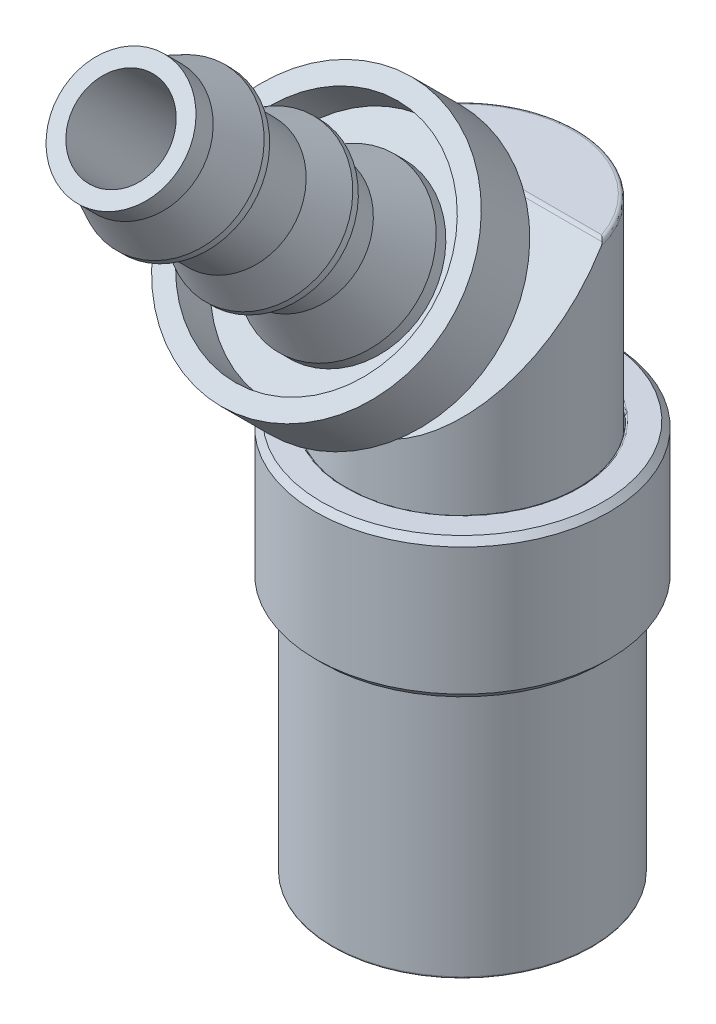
ISO-10303-21;
HEADER;
FILE_DESCRIPTION(('STEP AP214'),'2;1');
FILE_NAME('part.step','',(''),(''),'','','');
FILE_SCHEMA(('AUTOMOTIVE_DESIGN { 1 0 10303 214 1 1 1 1 }'));
ENDSEC;
DATA;
#1=APPLICATION_CONTEXT('core data for automotive mechanical design processes');
#2=APPLICATION_PROTOCOL_DEFINITION('international standard','automotive_design',2000,#1);
#3=PRODUCT_CONTEXT('',#1,'mechanical');
#4=PRODUCT('Part','Part','',(#3));
#5=PRODUCT_RELATED_PRODUCT_CATEGORY('part','',(#4));
#6=PRODUCT_DEFINITION_FORMATION('','',#4);
#7=PRODUCT_DEFINITION_CONTEXT('part definition',#1,'design');
#8=PRODUCT_DEFINITION('design','',#6,#7);
#9=PRODUCT_DEFINITION_SHAPE('','',#8);
#10=(LENGTH_UNIT() NAMED_UNIT(*) SI_UNIT(.MILLI.,.METRE.));
#11=(NAMED_UNIT(*) PLANE_ANGLE_UNIT() SI_UNIT($,.RADIAN.));
#12=(NAMED_UNIT(*) SI_UNIT($,.STERADIAN.) SOLID_ANGLE_UNIT());
#13=UNCERTAINTY_MEASURE_WITH_UNIT(LENGTH_MEASURE(1.E-05),#10,'distance_accuracy_value','');
#14=(GEOMETRIC_REPRESENTATION_CONTEXT(3) GLOBAL_UNCERTAINTY_ASSIGNED_CONTEXT((#13)) GLOBAL_UNIT_ASSIGNED_CONTEXT((#10,
#11,#12)) REPRESENTATION_CONTEXT('',''));
#15=CARTESIAN_POINT('',(0.,0.,0.));
#16=DIRECTION('',(0.,0.,1.));
#17=DIRECTION('',(1.,0.,0.));
#18=AXIS2_PLACEMENT_3D('',#15,#16,#17);
#19=CARTESIAN_POINT('',(0.092485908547,40.0578758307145,3.46432113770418));
#20=DIRECTION('',(0.,-0.707106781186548,-0.707106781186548));
#21=DIRECTION('',(0.,0.707106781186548,-0.707106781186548));
#22=AXIS2_PLACEMENT_3D('',#19,#20,#21);
#23=PLANE('',#22);
#24=CARTESIAN_POINT('',(0.092485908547,37.1123518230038,6.40984514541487));
#25=DIRECTION('',(0.,-0.707106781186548,-0.707106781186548));
#26=DIRECTION('',(1.,0.,0.));
#27=AXIS2_PLACEMENT_3D('',#24,#25,#26);
#28=CIRCLE('',#27,8.7249);
#29=CARTESIAN_POINT('',(0.092485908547,43.2817877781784,0.240409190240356));
#30=VERTEX_POINT('',#29);
#31=CARTESIAN_POINT('',(0.0924859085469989,30.9429158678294,12.5792811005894));
#32=VERTEX_POINT('',#31);
#33=EDGE_CURVE('P0_E11',#30,#32,#28,.T.);
#34=ORIENTED_EDGE('',*,*,#33,.T.);
#35=CARTESIAN_POINT('',(0.092485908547,37.1123518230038,6.40984514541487));
#36=DIRECTION('',(0.,-0.707106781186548,-0.707106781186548));
#37=DIRECTION('',(1.,0.,0.));
#38=AXIS2_PLACEMENT_3D('',#35,#36,#37);
#39=CIRCLE('',#38,8.7249);
#40=EDGE_CURVE('P0_E26',#32,#30,#39,.T.);
#41=ORIENTED_EDGE('',*,*,#40,.T.);
#42=EDGE_LOOP('',(#34,#41));
#43=FACE_BOUND('',#42,.T.);
#44=CARTESIAN_POINT('',(0.092485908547,37.1123518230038,6.40984514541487));
#45=DIRECTION('',(0.,-0.707106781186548,-0.707106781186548));
#46=DIRECTION('',(1.,0.,0.));
#47=AXIS2_PLACEMENT_3D('',#44,#45,#46);
#48=CIRCLE('',#47,4.1656);
#49=CARTESIAN_POINT('',(0.092485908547,40.0578758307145,3.46432113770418));
#50=VERTEX_POINT('',#49);
#51=CARTESIAN_POINT('',(0.0924859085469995,34.1668278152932,9.35536915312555));
#52=VERTEX_POINT('',#51);
#53=EDGE_CURVE('P0_E124',#50,#52,#48,.T.);
#54=ORIENTED_EDGE('',*,*,#53,.F.);
#55=CARTESIAN_POINT('',(0.092485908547,37.1123518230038,6.40984514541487));
#56=DIRECTION('',(0.,-0.707106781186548,-0.707106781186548));
#57=DIRECTION('',(1.,0.,0.));
#58=AXIS2_PLACEMENT_3D('',#55,#56,#57);
#59=CIRCLE('',#58,4.1656);
#60=EDGE_CURVE('P0_E110',#52,#50,#59,.T.);
#61=ORIENTED_EDGE('',*,*,#60,.F.);
#62=EDGE_LOOP('',(#54,#61));
#63=FACE_BOUND('',#62,.T.);
#64=ADVANCED_FACE('P0_F16',(#43,#63),#23,.T.);
#65=CARTESIAN_POINT('',(0.092485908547,37.5613646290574,6.85885795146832));
#66=DIRECTION('',(0.,-0.707106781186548,-0.707106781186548));
#67=DIRECTION('',(0.,0.707106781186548,-0.707106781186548));
#68=AXIS2_PLACEMENT_3D('',#65,#66,#67);
#69=CYLINDRICAL_SURFACE('',#68,4.1656);
#70=ORIENTED_EDGE('',*,*,#53,.T.);
#71=DIRECTION('',(0.,0.707106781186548,0.707106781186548));
#72=VECTOR('',#71,1.);
#73=CARTESIAN_POINT('',(0.0924859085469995,34.6158406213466,9.80438195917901));
#74=LINE('',#73,#72);
#75=CARTESIAN_POINT('',(0.0924859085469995,35.0648534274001,10.2533947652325));
#76=VERTEX_POINT('',#75);
#77=EDGE_CURVE('P0_E121',#52,#76,#74,.T.);
#78=ORIENTED_EDGE('',*,*,#77,.T.);
#79=CARTESIAN_POINT('',(0.092485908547,38.0103774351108,7.30787075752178));
#80=DIRECTION('',(0.,-0.707106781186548,-0.707106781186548));
#81=DIRECTION('',(1.,0.,0.));
#82=AXIS2_PLACEMENT_3D('',#79,#80,#81);
#83=CIRCLE('',#82,4.1656);
#84=CARTESIAN_POINT('',(0.092485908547,40.9559014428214,4.3623467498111));
#85=VERTEX_POINT('',#84);
#86=EDGE_CURVE('P0_E68',#85,#76,#83,.T.);
#87=ORIENTED_EDGE('',*,*,#86,.F.);
#88=CARTESIAN_POINT('',(0.092485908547,38.0103774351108,7.30787075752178));
#89=DIRECTION('',(0.,-0.707106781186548,-0.707106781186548));
#90=DIRECTION('',(1.,0.,0.));
#91=AXIS2_PLACEMENT_3D('',#88,#89,#90);
#92=CIRCLE('',#91,4.1656);
#93=EDGE_CURVE('P0_E125',#76,#85,#92,.T.);
#94=ORIENTED_EDGE('',*,*,#93,.F.);
#95=ORIENTED_EDGE('',*,*,#77,.F.);
#96=ORIENTED_EDGE('',*,*,#60,.T.);
#97=EDGE_LOOP('',(#70,#78,#87,#94,#95,#96));
#98=FACE_BOUND('',#97,.T.);
#99=ADVANCED_FACE('P0_F145',(#98),#69,.F.);
#100=CARTESIAN_POINT('',(0.092485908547,43.2817877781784,2.03646041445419));
#101=DIRECTION('',(0.,0.707106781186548,0.707106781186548));
#102=DIRECTION('',(1.,0.,0.));
#103=AXIS2_PLACEMENT_3D('',#100,#101,#102);
#104=PLANE('',#103);
#105=CARTESIAN_POINT('',(0.092485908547,38.0103774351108,7.30787075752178));
#106=DIRECTION('',(0.,-0.707106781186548,-0.707106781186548));
#107=DIRECTION('',(1.,0.,0.));
#108=AXIS2_PLACEMENT_3D('',#105,#106,#107);
#109=CIRCLE('',#108,7.4549);
#110=CARTESIAN_POINT('',(0.092485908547,43.2817877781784,2.03646041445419));
#111=VERTEX_POINT('',#110);
#112=CARTESIAN_POINT('',(0.0924859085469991,32.7389670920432,12.5792811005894));
#113=VERTEX_POINT('',#112);
#114=EDGE_CURVE('P0_E80',#111,#113,#109,.T.);
#115=ORIENTED_EDGE('',*,*,#114,.F.);
#116=CARTESIAN_POINT('',(0.092485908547,38.0103774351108,7.30787075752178));
#117=DIRECTION('',(0.,-0.707106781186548,-0.707106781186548));
#118=DIRECTION('',(1.,0.,0.));
#119=AXIS2_PLACEMENT_3D('',#116,#117,#118);
#120=CIRCLE('',#119,7.4549);
#121=EDGE_CURVE('P0_E115',#113,#111,#120,.T.);
#122=ORIENTED_EDGE('',*,*,#121,.F.);
#123=EDGE_LOOP('',(#115,#122));
#124=FACE_BOUND('',#123,.T.);
#125=ORIENTED_EDGE('',*,*,#86,.T.);
#126=ORIENTED_EDGE('',*,*,#93,.T.);
#127=EDGE_LOOP('',(#125,#126));
#128=FACE_BOUND('',#127,.T.);
#129=ADVANCED_FACE('P0_F141',(#124,#128),#104,.T.);
#130=CARTESIAN_POINT('',(0.092485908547,39.1329094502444,8.43040277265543));
#131=DIRECTION('',(0.,-0.707106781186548,-0.707106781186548));
#132=DIRECTION('',(0.,0.707106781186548,-0.707106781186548));
#133=AXIS2_PLACEMENT_3D('',#130,#131,#132);
#134=CYLINDRICAL_SURFACE('',#133,7.4549);
#135=ORIENTED_EDGE('',*,*,#114,.T.);
#136=DIRECTION('',(0.,0.707106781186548,0.707106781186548));
#137=VECTOR('',#136,1.);
#138=CARTESIAN_POINT('',(0.0924859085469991,33.8614991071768,13.701813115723));
#139=LINE('',#138,#137);
#140=CARTESIAN_POINT('',(0.0924859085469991,34.9840311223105,14.8243451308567));
#141=VERTEX_POINT('',#140);
#142=EDGE_CURVE('P0_E112',#113,#141,#139,.T.);
#143=ORIENTED_EDGE('',*,*,#142,.T.);
#144=CARTESIAN_POINT('',(0.092485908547,40.255441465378,9.55293478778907));
#145=DIRECTION('',(0.,-0.707106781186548,-0.707106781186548));
#146=DIRECTION('',(1.,0.,0.));
#147=AXIS2_PLACEMENT_3D('',#144,#145,#146);
#148=CIRCLE('',#147,7.4549);
#149=CARTESIAN_POINT('',(0.092485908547,45.5268518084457,4.28152444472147));
#150=VERTEX_POINT('',#149);
#151=EDGE_CURVE('P0_E106',#150,#141,#148,.T.);
#152=ORIENTED_EDGE('',*,*,#151,.F.);
#153=CARTESIAN_POINT('',(0.092485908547,40.255441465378,9.55293478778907));
#154=DIRECTION('',(0.,-0.707106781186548,-0.707106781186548));
#155=DIRECTION('',(1.,0.,0.));
#156=AXIS2_PLACEMENT_3D('',#153,#154,#155);
#157=CIRCLE('',#156,7.4549);
#158=EDGE_CURVE('P0_E99',#141,#150,#157,.T.);
#159=ORIENTED_EDGE('',*,*,#158,.F.);
#160=ORIENTED_EDGE('',*,*,#142,.F.);
#161=ORIENTED_EDGE('',*,*,#121,.T.);
#162=EDGE_LOOP('',(#135,#143,#152,#159,#160,#161));
#163=FACE_BOUND('',#162,.T.);
#164=ADVANCED_FACE('P0_F132',(#163),#134,.F.);
#165=CARTESIAN_POINT('',(0.092485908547,46.4248774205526,3.38349883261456));
#166=DIRECTION('',(0.,0.707106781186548,0.707106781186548));
#167=DIRECTION('',(1.,0.,0.));
#168=AXIS2_PLACEMENT_3D('',#165,#166,#167);
#169=PLANE('',#168);
#170=CARTESIAN_POINT('',(0.092485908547,40.255441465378,9.55293478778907));
#171=DIRECTION('',(0.,-0.707106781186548,-0.707106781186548));
#172=DIRECTION('',(1.,0.,0.));
#173=AXIS2_PLACEMENT_3D('',#170,#171,#172);
#174=CIRCLE('',#173,8.7249);
#175=CARTESIAN_POINT('',(0.092485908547,46.4248774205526,3.38349883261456));
#176=VERTEX_POINT('',#175);
#177=CARTESIAN_POINT('',(0.0924859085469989,34.0860055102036,15.7223707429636));
#178=VERTEX_POINT('',#177);
#179=EDGE_CURVE('P0_E89',#176,#178,#174,.T.);
#180=ORIENTED_EDGE('',*,*,#179,.F.);
#181=CARTESIAN_POINT('',(0.092485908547,40.255441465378,9.55293478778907));
#182=DIRECTION('',(0.,-0.707106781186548,-0.707106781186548));
#183=DIRECTION('',(1.,0.,0.));
#184=AXIS2_PLACEMENT_3D('',#181,#182,#183);
#185=CIRCLE('',#184,8.7249);
#186=EDGE_CURVE('P0_E19',#178,#176,#185,.T.);
#187=ORIENTED_EDGE('',*,*,#186,.F.);
#188=EDGE_LOOP('',(#180,#187));
#189=FACE_BOUND('',#188,.T.);
#190=ORIENTED_EDGE('',*,*,#151,.T.);
#191=ORIENTED_EDGE('',*,*,#158,.T.);
#192=EDGE_LOOP('',(#190,#191));
#193=FACE_BOUND('',#192,.T.);
#194=ADVANCED_FACE('P0_F95',(#189,#193),#169,.T.);
#195=CARTESIAN_POINT('',(0.092485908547,38.683896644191,7.98138996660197));
#196=DIRECTION('',(0.,-0.707106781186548,-0.707106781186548));
#197=DIRECTION('',(0.,0.707106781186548,-0.707106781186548));
#198=AXIS2_PLACEMENT_3D('',#195,#196,#197);
#199=CYLINDRICAL_SURFACE('',#198,8.7249);
#200=ORIENTED_EDGE('',*,*,#33,.F.);
#201=ORIENTED_EDGE('',*,*,#40,.F.);
#202=DIRECTION('',(0.,0.707106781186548,0.707106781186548));
#203=VECTOR('',#202,1.);
#204=CARTESIAN_POINT('',(0.0924859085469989,32.5144606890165,14.1508259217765));
#205=LINE('',#204,#203);
#206=EDGE_CURVE('P0_E92',#32,#178,#205,.T.);
#207=ORIENTED_EDGE('',*,*,#206,.T.);
#208=ORIENTED_EDGE('',*,*,#186,.T.);
#209=ORIENTED_EDGE('',*,*,#179,.T.);
#210=ORIENTED_EDGE('',*,*,#206,.F.);
#211=EDGE_LOOP('',(#200,#201,#207,#208,#209,#210));
#212=FACE_BOUND('',#211,.T.);
#213=ADVANCED_FACE('P0_F91',(#212),#199,.T.);
#214=CLOSED_SHELL('',(#64,#99,#129,#164,#194,#213));
#215=MANIFOLD_SOLID_BREP('P0_B1',#214);
#216=CARTESIAN_POINT('',(0.092485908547,30.6465674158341,-0.0559392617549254));
#217=DIRECTION('',(0.,0.707106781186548,0.707106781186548));
#218=DIRECTION('',(0.,-0.707106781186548,0.707106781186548));
#219=AXIS2_PLACEMENT_3D('',#216,#217,#218);
#220=CONICAL_SURFACE('',#219,4.318,0.785398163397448);
#221=CARTESIAN_POINT('',(0.092485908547,30.377159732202,-0.325346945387));
#222=DIRECTION('',(0.,0.707106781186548,0.707106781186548));
#223=DIRECTION('',(0.,-0.707106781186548,0.707106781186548));
#224=AXIS2_PLACEMENT_3D('',#221,#222,#223);
#225=CIRCLE('',#224,3.937);
#226=CARTESIAN_POINT('',(0.0924859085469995,33.1610391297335,-3.10922634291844));
#227=VERTEX_POINT('',#226);
#228=EDGE_CURVE('P1_E36',#227,#227,#225,.T.);
#229=ORIENTED_EDGE('',*,*,#228,.T.);
#230=DIRECTION('',(0.,1.,0.));
#231=VECTOR('',#230,1.);
#232=CARTESIAN_POINT('',(0.0924859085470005,33.6998544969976,-3.10922634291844));
#233=LINE('',#232,#231);
#234=CARTESIAN_POINT('',(0.0924859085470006,34.249446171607,-3.10922634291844));
#235=VERTEX_POINT('',#234);
#236=EDGE_CURVE('P1_E195',#227,#235,#233,.T.);
#237=ORIENTED_EDGE('',*,*,#236,.T.);
#238=CARTESIAN_POINT('',(0.092485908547,30.9213632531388,0.218856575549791));
#239=DIRECTION('',(0.,-0.707106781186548,-0.707106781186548));
#240=DIRECTION('',(0.,0.707106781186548,-0.707106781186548));
#241=AXIS2_PLACEMENT_3D('',#238,#239,#240);
#242=CIRCLE('',#241,4.70662);
#243=CARTESIAN_POINT('',(0.0924859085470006,27.5932803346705,3.54693949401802));
#244=VERTEX_POINT('',#243);
#245=EDGE_CURVE('P1_E288',#235,#244,#242,.T.);
#246=ORIENTED_EDGE('',*,*,#245,.T.);
#247=CARTESIAN_POINT('',(0.092485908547,30.9213632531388,0.218856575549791));
#248=DIRECTION('',(0.,-0.707106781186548,-0.707106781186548));
#249=DIRECTION('',(0.,0.707106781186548,-0.707106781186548));
#250=AXIS2_PLACEMENT_3D('',#247,#248,#249);
#251=CIRCLE('',#250,4.70662);
#252=EDGE_CURVE('P1_E309',#244,#235,#251,.T.);
#253=ORIENTED_EDGE('',*,*,#252,.T.);
#254=ORIENTED_EDGE('',*,*,#236,.F.);
#255=EDGE_LOOP('',(#229,#237,#246,#253,#254));
#256=FACE_BOUND('',#255,.T.);
#257=ADVANCED_FACE('P1_F16',(#256),#220,.T.);
#258=CARTESIAN_POINT('',(0.092485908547,32.6222237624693,1.91971708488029));
#259=DIRECTION('',(0.,-0.707106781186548,-0.707106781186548));
#260=DIRECTION('',(0.,0.707106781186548,-0.707106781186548));
#261=AXIS2_PLACEMENT_3D('',#258,#259,#260);
#262=CYLINDRICAL_SURFACE('',#261,4.70662);
#263=ORIENTED_EDGE('',*,*,#252,.F.);
#264=DIRECTION('',(0.,0.707106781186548,0.707106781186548));
#265=VECTOR('',#264,1.);
#266=CARTESIAN_POINT('',(0.0924859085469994,29.294140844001,5.24780000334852));
#267=LINE('',#266,#265);
#268=CARTESIAN_POINT('',(0.0924859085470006,31.5423157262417,7.49597488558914));
#269=VERTEX_POINT('',#268);
#270=EDGE_CURVE('P1_E284',#244,#269,#267,.T.);
#271=ORIENTED_EDGE('',*,*,#270,.T.);
#272=CARTESIAN_POINT('',(0.092485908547,34.8703986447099,4.16789196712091));
#273=DIRECTION('',(0.,-0.707106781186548,-0.707106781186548));
#274=DIRECTION('',(0.,0.707106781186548,-0.707106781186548));
#275=AXIS2_PLACEMENT_3D('',#272,#273,#274);
#276=CIRCLE('',#275,4.70662);
#277=CARTESIAN_POINT('',(0.0924859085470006,38.1984815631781,0.839809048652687));
#278=VERTEX_POINT('',#277);
#279=EDGE_CURVE('P1_E281',#269,#278,#276,.T.);
#280=ORIENTED_EDGE('',*,*,#279,.T.);
#281=CARTESIAN_POINT('',(0.092485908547,34.8703986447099,4.16789196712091));
#282=DIRECTION('',(0.,-0.707106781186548,-0.707106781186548));
#283=DIRECTION('',(0.,0.707106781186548,-0.707106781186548));
#284=AXIS2_PLACEMENT_3D('',#281,#282,#283);
#285=CIRCLE('',#284,4.70662);
#286=EDGE_CURVE('P1_E178',#278,#269,#285,.T.);
#287=ORIENTED_EDGE('',*,*,#286,.T.);
#288=ORIENTED_EDGE('',*,*,#270,.F.);
#289=ORIENTED_EDGE('',*,*,#245,.F.);
#290=EDGE_LOOP('',(#263,#271,#280,#287,#288,#289));
#291=FACE_BOUND('',#290,.T.);
#292=ADVANCED_FACE('P1_F385',(#291),#262,.T.);
#293=CARTESIAN_POINT('',(0.092485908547,32.200151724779,-2.14833893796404));
#294=DIRECTION('',(0.,-0.707106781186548,-0.707106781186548));
#295=DIRECTION('',(0.,0.707106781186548,-0.707106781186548));
#296=AXIS2_PLACEMENT_3D('',#293,#294,#295);
#297=PLANE('',#296);
#298=CARTESIAN_POINT('',(0.,30.377159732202,-0.325346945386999));
#299=DIRECTION('',(0.,-0.707106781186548,-0.707106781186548));
#300=DIRECTION('',(0.,0.707106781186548,-0.707106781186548));
#301=AXIS2_PLACEMENT_3D('',#298,#299,#300);
#302=CIRCLE('',#301,2.921);
#303=CARTESIAN_POINT('',(0.,32.4426186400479,-2.39080585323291));
#304=VERTEX_POINT('',#303);
#305=EDGE_CURVE('P1_E683',#304,#304,#302,.T.);
#306=ORIENTED_EDGE('',*,*,#305,.F.);
#307=EDGE_LOOP('',(#306));
#308=FACE_BOUND('',#307,.T.);
#309=ORIENTED_EDGE('',*,*,#228,.F.);
#310=EDGE_LOOP('',(#309));
#311=FACE_BOUND('',#310,.T.);
#312=ADVANCED_FACE('P1_F390',(#308,#311),#297,.T.);
#313=CARTESIAN_POINT('',(0.0924859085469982,26.4989642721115,3.55284851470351));
#314=DIRECTION('',(0.5,0.612372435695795,-0.612372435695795));
#315=DIRECTION('',(0.,-0.707106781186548,-0.707106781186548));
#316=AXIS2_PLACEMENT_3D('',#313,#314,#315);
#317=PLANE('',#316);
#318=CARTESIAN_POINT('',(-4.657314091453,34.83219557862,8.00788436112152));
#319=CARTESIAN_POINT('',(-2.28241409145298,34.4224160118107,9.5372025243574));
#320=CARTESIAN_POINT('',(0.0924859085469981,32.8930978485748,9.94698209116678));
#321=(BOUNDED_CURVE() B_SPLINE_CURVE(2,(#318,#319,#320),.UNSPECIFIED.,.F.,
.F.) B_SPLINE_CURVE_WITH_KNOTS((3,3),(0.0756877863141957,0.66089469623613),
.UNSPECIFIED.) CURVE() GEOMETRIC_REPRESENTATION_ITEM() RATIONAL_B_SPLINE_CURVE((1.0473309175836,
1.20935357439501,1.0473309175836)) REPRESENTATION_ITEM(''));
#322=CARTESIAN_POINT('',(-4.657314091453,34.83219557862,8.00788436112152));
#323=VERTEX_POINT('',#322);
#324=CARTESIAN_POINT('',(0.0924859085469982,32.8930978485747,9.94698209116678));
#325=VERTEX_POINT('',#324);
#326=EDGE_CURVE('P1_E130',#323,#325,#321,.T.);
#327=ORIENTED_EDGE('',*,*,#326,.F.);
#328=DIRECTION('',(0.,0.707106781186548,0.707106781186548));
#329=VECTOR('',#328,1.);
#330=CARTESIAN_POINT('',(-4.657314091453,28.4380620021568,1.61375078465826));
#331=LINE('',#330,#329);
#332=CARTESIAN_POINT('',(-4.657314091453,33.2489085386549,6.42459732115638));
#333=VERTEX_POINT('',#332);
#334=EDGE_CURVE('P1_E200',#333,#323,#331,.T.);
#335=ORIENTED_EDGE('',*,*,#334,.F.);
#336=CARTESIAN_POINT('',(0.0924859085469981,31.3098108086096,8.36369505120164));
#337=CARTESIAN_POINT('',(-2.28241409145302,31.719590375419,6.83437688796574));
#338=CARTESIAN_POINT('',(-4.657314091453,33.2489085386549,6.42459732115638));
#339=(BOUNDED_CURVE() B_SPLINE_CURVE(2,(#336,#337,#338),.UNSPECIFIED.,.F.,
.F.) B_SPLINE_CURVE_WITH_KNOTS((3,3),(0.0756877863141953,0.66089469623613),
.UNSPECIFIED.) CURVE() GEOMETRIC_REPRESENTATION_ITEM() RATIONAL_B_SPLINE_CURVE((1.0473309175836,
1.20935357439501,1.0473309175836)) REPRESENTATION_ITEM(''));
#340=CARTESIAN_POINT('',(0.0924859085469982,31.3098108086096,8.36369505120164));
#341=VERTEX_POINT('',#340);
#342=EDGE_CURVE('P1_E210',#341,#333,#339,.T.);
#343=ORIENTED_EDGE('',*,*,#342,.F.);
#344=DIRECTION('',(0.,0.707106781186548,0.707106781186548));
#345=VECTOR('',#344,1.);
#346=CARTESIAN_POINT('',(0.0924859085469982,26.4989642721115,3.55284851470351));
#347=LINE('',#346,#345);
#348=EDGE_CURVE('P1_E264',#341,#325,#347,.T.);
#349=ORIENTED_EDGE('',*,*,#348,.T.);
#350=EDGE_LOOP('',(#327,#335,#343,#349));
#351=FACE_BOUND('',#350,.T.);
#352=ADVANCED_FACE('P1_F393',(#351),#317,.F.);
#353=CARTESIAN_POINT('',(4.842285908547,28.4380620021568,1.61375078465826));
#354=DIRECTION('',(-0.5,0.612372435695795,-0.612372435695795));
#355=DIRECTION('',(-0.866025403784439,-0.353553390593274,0.353553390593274));
#356=AXIS2_PLACEMENT_3D('',#353,#354,#355);
#357=PLANE('',#356);
#358=CARTESIAN_POINT('',(0.0924859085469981,32.8930978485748,9.94698209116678));
#359=CARTESIAN_POINT('',(2.46738590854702,34.4224160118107,9.5372025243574));
#360=CARTESIAN_POINT('',(4.84228590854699,34.83219557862,8.00788436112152));
#361=(BOUNDED_CURVE() B_SPLINE_CURVE(2,(#358,#359,#360),.UNSPECIFIED.,.F.,
.F.) B_SPLINE_CURVE_WITH_KNOTS((3,3),(0.0756877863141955,0.66089469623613),
.UNSPECIFIED.) CURVE() GEOMETRIC_REPRESENTATION_ITEM() RATIONAL_B_SPLINE_CURVE((1.0473309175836,
1.20935357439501,1.0473309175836)) REPRESENTATION_ITEM(''));
#362=CARTESIAN_POINT('',(4.842285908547,34.83219557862,8.00788436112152));
#363=VERTEX_POINT('',#362);
#364=EDGE_CURVE('P1_E187',#325,#363,#361,.T.);
#365=ORIENTED_EDGE('',*,*,#364,.F.);
#366=ORIENTED_EDGE('',*,*,#348,.F.);
#367=CARTESIAN_POINT('',(4.84228590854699,33.2489085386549,6.42459732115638));
#368=CARTESIAN_POINT('',(2.46738590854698,31.719590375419,6.83437688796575));
#369=CARTESIAN_POINT('',(0.0924859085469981,31.3098108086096,8.36369505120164));
#370=(BOUNDED_CURVE() B_SPLINE_CURVE(2,(#367,#368,#369),.UNSPECIFIED.,.F.,
.F.) B_SPLINE_CURVE_WITH_KNOTS((3,3),(0.0756877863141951,0.66089469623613),
.UNSPECIFIED.) CURVE() GEOMETRIC_REPRESENTATION_ITEM() RATIONAL_B_SPLINE_CURVE((1.0473309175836,
1.20935357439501,1.0473309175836)) REPRESENTATION_ITEM(''));
#371=CARTESIAN_POINT('',(4.842285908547,33.2489085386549,6.42459732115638));
#372=VERTEX_POINT('',#371);
#373=EDGE_CURVE('P1_E120',#372,#341,#370,.T.);
#374=ORIENTED_EDGE('',*,*,#373,.F.);
#375=DIRECTION('',(0.,0.707106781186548,0.707106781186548));
#376=VECTOR('',#375,1.);
#377=CARTESIAN_POINT('',(4.842285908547,28.4380620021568,1.61375078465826));
#378=LINE('',#377,#376);
#379=EDGE_CURVE('P1_E261',#372,#363,#378,.T.);
#380=ORIENTED_EDGE('',*,*,#379,.T.);
#381=EDGE_LOOP('',(#365,#366,#374,#380));
#382=FACE_BOUND('',#381,.T.);
#383=ADVANCED_FACE('P1_F396',(#382),#357,.F.);
#384=CARTESIAN_POINT('',(4.842285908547,32.3162574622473,-2.26444467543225));
#385=DIRECTION('',(-1.,0.,0.));
#386=DIRECTION('',(0.,0.707106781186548,0.707106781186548));
#387=AXIS2_PLACEMENT_3D('',#384,#385,#386);
#388=PLANE('',#387);
#389=CARTESIAN_POINT('',(4.84228590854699,34.83219557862,8.00788436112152));
#390=CARTESIAN_POINT('',(4.842285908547,37.3310626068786,6.62855592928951));
#391=CARTESIAN_POINT('',(4.84228590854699,38.7103910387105,4.129688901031));
#392=(BOUNDED_CURVE() B_SPLINE_CURVE(2,(#389,#390,#391),.UNSPECIFIED.,.F.,
.F.) B_SPLINE_CURVE_WITH_KNOTS((3,3),(0.0756877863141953,0.66089469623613),
.UNSPECIFIED.) CURVE() GEOMETRIC_REPRESENTATION_ITEM() RATIONAL_B_SPLINE_CURVE((1.0473309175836,
1.20935357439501,1.0473309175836)) REPRESENTATION_ITEM(''));
#393=CARTESIAN_POINT('',(4.842285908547,38.7103910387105,4.12968890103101));
#394=VERTEX_POINT('',#393);
#395=EDGE_CURVE('P1_E181',#363,#394,#392,.T.);
#396=ORIENTED_EDGE('',*,*,#395,.F.);
#397=ORIENTED_EDGE('',*,*,#379,.F.);
#398=CARTESIAN_POINT('',(4.84228590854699,37.1271039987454,2.54640186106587));
#399=CARTESIAN_POINT('',(4.842285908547,34.6282369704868,3.92573029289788));
#400=CARTESIAN_POINT('',(4.84228590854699,33.2489085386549,6.42459732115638));
#401=(BOUNDED_CURVE() B_SPLINE_CURVE(2,(#398,#399,#400),.UNSPECIFIED.,.F.,
.F.) B_SPLINE_CURVE_WITH_KNOTS((3,3),(0.0756877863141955,0.660894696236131),
.UNSPECIFIED.) CURVE() GEOMETRIC_REPRESENTATION_ITEM() RATIONAL_B_SPLINE_CURVE((1.0473309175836,
1.20935357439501,1.0473309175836)) REPRESENTATION_ITEM(''));
#402=CARTESIAN_POINT('',(4.842285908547,37.1271039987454,2.54640186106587));
#403=VERTEX_POINT('',#402);
#404=EDGE_CURVE('P1_E168',#403,#372,#401,.T.);
#405=ORIENTED_EDGE('',*,*,#404,.F.);
#406=DIRECTION('',(0.,0.707106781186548,0.707106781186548));
#407=VECTOR('',#406,1.);
#408=CARTESIAN_POINT('',(4.842285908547,32.3162574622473,-2.26444467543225));
#409=LINE('',#408,#407);
#410=EDGE_CURVE('P1_E165',#403,#394,#409,.T.);
#411=ORIENTED_EDGE('',*,*,#410,.T.);
#412=EDGE_LOOP('',(#396,#397,#405,#411));
#413=FACE_BOUND('',#412,.T.);
#414=ADVANCED_FACE('P1_F400',(#413),#388,.F.);
#415=CARTESIAN_POINT('',(0.0924859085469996,34.2553551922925,-4.20354240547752));
#416=DIRECTION('',(-0.5,-0.612372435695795,0.612372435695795));
#417=DIRECTION('',(0.,0.707106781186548,0.707106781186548));
#418=AXIS2_PLACEMENT_3D('',#415,#416,#417);
#419=PLANE('',#418);
#420=CARTESIAN_POINT('',(4.84228590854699,38.7103910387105,4.129688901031));
#421=CARTESIAN_POINT('',(2.46738590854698,40.2397092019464,3.71990933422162));
#422=CARTESIAN_POINT('',(0.0924859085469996,40.6494887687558,2.19059117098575));
#423=(BOUNDED_CURVE() B_SPLINE_CURVE(2,(#420,#421,#422),.UNSPECIFIED.,.F.,
.F.) B_SPLINE_CURVE_WITH_KNOTS((3,3),(0.0756877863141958,0.66089469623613),
.UNSPECIFIED.) CURVE() GEOMETRIC_REPRESENTATION_ITEM() RATIONAL_B_SPLINE_CURVE((1.0473309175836,
1.20935357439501,1.0473309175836)) REPRESENTATION_ITEM(''));
#424=CARTESIAN_POINT('',(0.0924859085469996,40.6494887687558,2.19059117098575));
#425=VERTEX_POINT('',#424);
#426=EDGE_CURVE('P1_E204',#394,#425,#423,.T.);
#427=ORIENTED_EDGE('',*,*,#426,.F.);
#428=ORIENTED_EDGE('',*,*,#410,.F.);
#429=CARTESIAN_POINT('',(0.0924859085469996,39.0662017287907,0.607304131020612));
#430=CARTESIAN_POINT('',(2.46738590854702,37.5368835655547,1.01708369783));
#431=CARTESIAN_POINT('',(4.84228590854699,37.1271039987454,2.54640186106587));
#432=(BOUNDED_CURVE() B_SPLINE_CURVE(2,(#429,#430,#431),.UNSPECIFIED.,.F.,
.F.) B_SPLINE_CURVE_WITH_KNOTS((3,3),(0.0756877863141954,0.66089469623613),
.UNSPECIFIED.) CURVE() GEOMETRIC_REPRESENTATION_ITEM() RATIONAL_B_SPLINE_CURVE((1.0473309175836,
1.20935357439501,1.0473309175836)) REPRESENTATION_ITEM(''));
#433=CARTESIAN_POINT('',(0.0924859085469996,39.0662017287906,0.607304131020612));
#434=VERTEX_POINT('',#433);
#435=EDGE_CURVE('P1_E159',#434,#403,#432,.T.);
#436=ORIENTED_EDGE('',*,*,#435,.F.);
#437=DIRECTION('',(0.,0.707106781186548,0.707106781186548));
#438=VECTOR('',#437,1.);
#439=CARTESIAN_POINT('',(0.0924859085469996,34.2553551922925,-4.20354240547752));
#440=LINE('',#439,#438);
#441=EDGE_CURVE('P1_E162',#434,#425,#440,.T.);
#442=ORIENTED_EDGE('',*,*,#441,.T.);
#443=EDGE_LOOP('',(#427,#428,#436,#442));
#444=FACE_BOUND('',#443,.T.);
#445=ADVANCED_FACE('P1_F161',(#444),#419,.F.);
#446=CARTESIAN_POINT('',(-4.657314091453,32.3162574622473,-2.26444467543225));
#447=DIRECTION('',(0.5,-0.612372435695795,0.612372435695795));
#448=DIRECTION('',(0.,-0.707106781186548,-0.707106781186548));
#449=AXIS2_PLACEMENT_3D('',#446,#447,#448);
#450=PLANE('',#449);
#451=CARTESIAN_POINT('',(0.0924859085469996,40.6494887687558,2.19059117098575));
#452=CARTESIAN_POINT('',(-2.28241409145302,40.2397092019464,3.71990933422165));
#453=CARTESIAN_POINT('',(-4.657314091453,38.7103910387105,4.129688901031));
#454=(BOUNDED_CURVE() B_SPLINE_CURVE(2,(#451,#452,#453),.UNSPECIFIED.,.F.,
.F.) B_SPLINE_CURVE_WITH_KNOTS((3,3),(0.0756877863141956,0.66089469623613),
.UNSPECIFIED.) CURVE() GEOMETRIC_REPRESENTATION_ITEM() RATIONAL_B_SPLINE_CURVE((1.0473309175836,
1.20935357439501,1.0473309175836)) REPRESENTATION_ITEM(''));
#455=CARTESIAN_POINT('',(-4.657314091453,38.7103910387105,4.12968890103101));
#456=VERTEX_POINT('',#455);
#457=EDGE_CURVE('P1_E172',#425,#456,#454,.T.);
#458=ORIENTED_EDGE('',*,*,#457,.F.);
#459=ORIENTED_EDGE('',*,*,#441,.F.);
#460=CARTESIAN_POINT('',(-4.657314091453,37.1271039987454,2.54640186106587));
#461=CARTESIAN_POINT('',(-2.28241409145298,37.5368835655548,1.01708369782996));
#462=CARTESIAN_POINT('',(0.0924859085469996,39.0662017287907,0.607304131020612));
#463=(BOUNDED_CURVE() B_SPLINE_CURVE(2,(#460,#461,#462),.UNSPECIFIED.,.F.,
.F.) B_SPLINE_CURVE_WITH_KNOTS((3,3),(0.0756877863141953,0.66089469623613),
.UNSPECIFIED.) CURVE() GEOMETRIC_REPRESENTATION_ITEM() RATIONAL_B_SPLINE_CURVE((1.0473309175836,
1.20935357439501,1.0473309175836)) REPRESENTATION_ITEM(''));
#464=CARTESIAN_POINT('',(-4.657314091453,37.1271039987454,2.54640186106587));
#465=VERTEX_POINT('',#464);
#466=EDGE_CURVE('P1_E140',#465,#434,#463,.T.);
#467=ORIENTED_EDGE('',*,*,#466,.F.);
#468=DIRECTION('',(0.,0.707106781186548,0.707106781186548));
#469=VECTOR('',#468,1.);
#470=CARTESIAN_POINT('',(-4.657314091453,32.3162574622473,-2.26444467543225));
#471=LINE('',#470,#469);
#472=EDGE_CURVE('P1_E175',#465,#456,#471,.T.);
#473=ORIENTED_EDGE('',*,*,#472,.T.);
#474=EDGE_LOOP('',(#458,#459,#467,#473));
#475=FACE_BOUND('',#474,.T.);
#476=ADVANCED_FACE('P1_F170',(#475),#450,.F.);
#477=CARTESIAN_POINT('',(-4.657314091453,28.4380620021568,1.61375078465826));
#478=DIRECTION('',(1.,0.,0.));
#479=DIRECTION('',(0.,0.707106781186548,0.707106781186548));
#480=AXIS2_PLACEMENT_3D('',#477,#478,#479);
#481=PLANE('',#480);
#482=CARTESIAN_POINT('',(-4.657314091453,38.7103910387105,4.129688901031));
#483=CARTESIAN_POINT('',(-4.657314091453,37.3310626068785,6.62855592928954));
#484=CARTESIAN_POINT('',(-4.657314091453,34.83219557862,8.00788436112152));
#485=(BOUNDED_CURVE() B_SPLINE_CURVE(2,(#482,#483,#484),.UNSPECIFIED.,.F.,
.F.) B_SPLINE_CURVE_WITH_KNOTS((3,3),(0.0756877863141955,0.66089469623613),
.UNSPECIFIED.) CURVE() GEOMETRIC_REPRESENTATION_ITEM() RATIONAL_B_SPLINE_CURVE((1.0473309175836,
1.20935357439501,1.0473309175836)) REPRESENTATION_ITEM(''));
#486=EDGE_CURVE('P1_E268',#456,#323,#485,.T.);
#487=ORIENTED_EDGE('',*,*,#486,.F.);
#488=ORIENTED_EDGE('',*,*,#472,.F.);
#489=CARTESIAN_POINT('',(-4.657314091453,33.2489085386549,6.42459732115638));
#490=CARTESIAN_POINT('',(-4.657314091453,34.6282369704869,3.92573029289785));
#491=CARTESIAN_POINT('',(-4.657314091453,37.1271039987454,2.54640186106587));
#492=(BOUNDED_CURVE() B_SPLINE_CURVE(2,(#489,#490,#491),.UNSPECIFIED.,.F.,
.F.) B_SPLINE_CURVE_WITH_KNOTS((3,3),(0.0756877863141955,0.66089469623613),
.UNSPECIFIED.) CURVE() GEOMETRIC_REPRESENTATION_ITEM() RATIONAL_B_SPLINE_CURVE((1.0473309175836,
1.20935357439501,1.0473309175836)) REPRESENTATION_ITEM(''));
#493=EDGE_CURVE('P1_E148',#333,#465,#492,.T.);
#494=ORIENTED_EDGE('',*,*,#493,.F.);
#495=ORIENTED_EDGE('',*,*,#334,.T.);
#496=EDGE_LOOP('',(#487,#488,#494,#495));
#497=FACE_BOUND('',#496,.T.);
#498=ADVANCED_FACE('P1_F380',(#497),#481,.F.);
#499=CARTESIAN_POINT('',(0.092485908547,36.8429441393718,6.14043746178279));
#500=DIRECTION('',(0.,-0.707106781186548,-0.707106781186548));
#501=DIRECTION('',(0.,-0.707106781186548,0.707106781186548));
#502=AXIS2_PLACEMENT_3D('',#499,#500,#501);
#503=CONICAL_SURFACE('',#502,5.30908864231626,1.0471975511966);
#504=ORIENTED_EDGE('',*,*,#426,.T.);
#505=DIRECTION('',(0.,-0.258819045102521,0.965925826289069));
#506=VECTOR('',#505,1.);
#507=CARTESIAN_POINT('',(0.0924859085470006,40.5970367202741,2.38634488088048));
#508=LINE('',#507,#506);
#509=CARTESIAN_POINT('',(0.0924859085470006,40.399816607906,3.12238036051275));
#510=VERTEX_POINT('',#509);
#511=EDGE_CURVE('P1_E209',#425,#510,#508,.T.);
#512=ORIENTED_EDGE('',*,*,#511,.T.);
#513=CARTESIAN_POINT('',(0.092485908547,37.1123518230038,6.40984514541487));
#514=DIRECTION('',(0.,-0.707106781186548,-0.707106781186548));
#515=DIRECTION('',(0.,-0.707106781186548,0.707106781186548));
#516=AXIS2_PLACEMENT_3D('',#513,#514,#515);
#517=CIRCLE('',#516,4.64917728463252);
#518=EDGE_CURVE('P1_E228',#510,#510,#517,.T.);
#519=ORIENTED_EDGE('',*,*,#518,.T.);
#520=ORIENTED_EDGE('',*,*,#511,.F.);
#521=ORIENTED_EDGE('',*,*,#457,.T.);
#522=ORIENTED_EDGE('',*,*,#486,.T.);
#523=ORIENTED_EDGE('',*,*,#326,.T.);
#524=ORIENTED_EDGE('',*,*,#364,.T.);
#525=ORIENTED_EDGE('',*,*,#395,.T.);
#526=EDGE_LOOP('',(#504,#512,#519,#520,#521,#522,#523,#524,#525));
#527=FACE_BOUND('',#526,.T.);
#528=ADVANCED_FACE('P1_F371',(#527),#503,.T.);
#529=CARTESIAN_POINT('',(0.092485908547,41.3330721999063,2.18912476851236));
#530=DIRECTION('',(0.,0.707106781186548,0.707106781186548));
#531=DIRECTION('',(1.,0.,0.));
#532=AXIS2_PLACEMENT_3D('',#529,#530,#531);
#533=PLANE('',#532);
#534=ORIENTED_EDGE('',*,*,#518,.F.);
#535=EDGE_LOOP('',(#534));
#536=FACE_BOUND('',#535,.T.);
#537=CARTESIAN_POINT('',(0.092485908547,37.1123518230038,6.40984514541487));
#538=DIRECTION('',(0.,0.707106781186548,0.707106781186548));
#539=DIRECTION('',(0.,-0.707106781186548,0.707106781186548));
#540=AXIS2_PLACEMENT_3D('',#537,#538,#539);
#541=CIRCLE('',#540,4.2545);
#542=CARTESIAN_POINT('',(0.0924859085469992,40.120737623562,3.4014593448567));
#543=VERTEX_POINT('',#542);
#544=CARTESIAN_POINT('',(0.0924859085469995,34.1039660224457,9.41823094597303));
#545=VERTEX_POINT('',#544);
#546=EDGE_CURVE('P1_E290',#543,#545,#541,.T.);
#547=ORIENTED_EDGE('',*,*,#546,.F.);
#548=CARTESIAN_POINT('',(0.092485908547,37.1123518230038,6.40984514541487));
#549=DIRECTION('',(0.,0.707106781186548,0.707106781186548));
#550=DIRECTION('',(0.,-0.707106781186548,0.707106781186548));
#551=AXIS2_PLACEMENT_3D('',#548,#549,#550);
#552=CIRCLE('',#551,4.2545);
#553=EDGE_CURVE('P1_E346',#545,#543,#552,.T.);
#554=ORIENTED_EDGE('',*,*,#553,.F.);
#555=EDGE_LOOP('',(#547,#554));
#556=FACE_BOUND('',#555,.T.);
#557=ADVANCED_FACE('P1_F369',(#536,#556),#533,.T.);
#558=CARTESIAN_POINT('',(0.092485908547,35.1265254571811,4.42401877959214));
#559=DIRECTION('',(0.,0.707106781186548,0.707106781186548));
#560=DIRECTION('',(0.,-0.707106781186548,0.707106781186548));
#561=AXIS2_PLACEMENT_3D('',#558,#559,#560);
#562=CONICAL_SURFACE('',#561,5.334,1.0471975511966);
#563=ORIENTED_EDGE('',*,*,#279,.F.);
#564=ORIENTED_EDGE('',*,*,#286,.F.);
#565=DIRECTION('',(0.,0.965925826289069,-0.258819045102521));
#566=VECTOR('',#565,1.);
#567=CARTESIAN_POINT('',(0.0924859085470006,38.8982330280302,0.652311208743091));
#568=LINE('',#567,#566);
#569=EDGE_CURVE('P1_E145',#278,#434,#568,.T.);
#570=ORIENTED_EDGE('',*,*,#569,.T.);
#571=ORIENTED_EDGE('',*,*,#435,.T.);
#572=ORIENTED_EDGE('',*,*,#404,.T.);
#573=ORIENTED_EDGE('',*,*,#373,.T.);
#574=ORIENTED_EDGE('',*,*,#342,.T.);
#575=ORIENTED_EDGE('',*,*,#493,.T.);
#576=ORIENTED_EDGE('',*,*,#466,.T.);
#577=ORIENTED_EDGE('',*,*,#569,.F.);
#578=EDGE_LOOP('',(#563,#564,#570,#571,#572,#573,#574,#575,#576,#577));
#579=FACE_BOUND('',#578,.T.);
#580=ADVANCED_FACE('P1_F143',(#579),#562,.T.);
#581=CARTESIAN_POINT('',(0.092485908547,37.2021543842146,6.49964770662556));
#582=DIRECTION('',(0.,-0.707106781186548,-0.707106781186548));
#583=DIRECTION('',(0.,0.707106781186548,-0.707106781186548));
#584=AXIS2_PLACEMENT_3D('',#581,#582,#583);
#585=TOROIDAL_SURFACE('',#584,4.2545,0.127);
#586=CARTESIAN_POINT('',(0.092485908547,37.2021543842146,6.49964770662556));
#587=DIRECTION('',(0.,-0.707106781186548,-0.707106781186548));
#588=DIRECTION('',(0.,-0.707106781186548,0.707106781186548));
#589=AXIS2_PLACEMENT_3D('',#586,#587,#588);
#590=CIRCLE('',#589,4.1275);
#591=CARTESIAN_POINT('',(0.0924859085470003,40.120737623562,3.58106446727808));
#592=VERTEX_POINT('',#591);
#593=CARTESIAN_POINT('',(0.0924859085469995,34.2835711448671,9.41823094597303));
#594=VERTEX_POINT('',#593);
#595=EDGE_CURVE('P1_E78',#592,#594,#590,.T.);
#596=ORIENTED_EDGE('',*,*,#595,.T.);
#597=CARTESIAN_POINT('',(0.0924859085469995,34.1937685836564,9.50803350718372));
#598=DIRECTION('',(-1.,0.,0.));
#599=DIRECTION('',(0.,-0.707106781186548,0.707106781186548));
#600=AXIS2_PLACEMENT_3D('',#597,#598,#599);
#601=CIRCLE('',#600,0.127);
#602=EDGE_CURVE('P1_E280',#594,#545,#601,.T.);
#603=ORIENTED_EDGE('',*,*,#602,.T.);
#604=ORIENTED_EDGE('',*,*,#553,.T.);
#605=ORIENTED_EDGE('',*,*,#546,.T.);
#606=ORIENTED_EDGE('',*,*,#602,.F.);
#607=CARTESIAN_POINT('',(0.092485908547,37.2021543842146,6.49964770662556));
#608=DIRECTION('',(0.,-0.707106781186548,-0.707106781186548));
#609=DIRECTION('',(0.,-0.707106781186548,0.707106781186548));
#610=AXIS2_PLACEMENT_3D('',#607,#608,#609);
#611=CIRCLE('',#610,4.1275);
#612=EDGE_CURVE('P1_E199',#594,#592,#611,.T.);
#613=ORIENTED_EDGE('',*,*,#612,.T.);
#614=EDGE_LOOP('',(#596,#603,#604,#605,#606,#613));
#615=FACE_BOUND('',#614,.T.);
#616=ADVANCED_FACE('P1_F365',(#615),#585,.F.);
#617=CARTESIAN_POINT('',(0.092485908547,37.6691277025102,6.96662102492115));
#618=DIRECTION('',(0.,-0.707106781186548,-0.707106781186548));
#619=DIRECTION('',(0.,0.707106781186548,-0.707106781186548));
#620=AXIS2_PLACEMENT_3D('',#617,#618,#619);
#621=CYLINDRICAL_SURFACE('',#620,4.1275);
#622=ORIENTED_EDGE('',*,*,#595,.F.);
#623=ORIENTED_EDGE('',*,*,#612,.F.);
#624=DIRECTION('',(0.,0.707106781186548,0.707106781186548));
#625=VECTOR('',#624,1.);
#626=CARTESIAN_POINT('',(0.0924859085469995,34.7505444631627,9.88520426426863));
#627=LINE('',#626,#625);
#628=CARTESIAN_POINT('',(0.0924859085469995,35.307320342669,10.4419801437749));
#629=VERTEX_POINT('',#628);
#630=EDGE_CURVE('P1_E196',#594,#629,#627,.T.);
#631=ORIENTED_EDGE('',*,*,#630,.T.);
#632=CARTESIAN_POINT('',(0.092485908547,38.2259035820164,7.52339690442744));
#633=DIRECTION('',(0.,-0.707106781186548,-0.707106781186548));
#634=DIRECTION('',(1.,0.,0.));
#635=AXIS2_PLACEMENT_3D('',#632,#633,#634);
#636=CIRCLE('',#635,4.1275);
#637=EDGE_CURVE('P1_E69',#629,#629,#636,.T.);
#638=ORIENTED_EDGE('',*,*,#637,.T.);
#639=ORIENTED_EDGE('',*,*,#630,.F.);
#640=EDGE_LOOP('',(#622,#623,#631,#638,#639));
#641=FACE_BOUND('',#640,.T.);
#642=ADVANCED_FACE('P1_F405',(#641),#621,.T.);
#643=CARTESIAN_POINT('',(0.092485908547,41.1444868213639,4.60481366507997));
#644=DIRECTION('',(0.,-0.707106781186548,-0.707106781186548));
#645=DIRECTION('',(0.,0.707106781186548,-0.707106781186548));
#646=AXIS2_PLACEMENT_3D('',#643,#644,#645);
#647=PLANE('',#646);
#648=ORIENTED_EDGE('',*,*,#637,.F.);
#649=EDGE_LOOP('',(#648));
#650=FACE_BOUND('',#649,.T.);
#651=CARTESIAN_POINT('',(0.,38.2259035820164,7.52339690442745));
#652=DIRECTION('',(0.,-0.707106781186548,-0.707106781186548));
#653=DIRECTION('',(0.,0.707106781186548,-0.707106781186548));
#654=AXIS2_PLACEMENT_3D('',#651,#652,#653);
#655=CIRCLE('',#654,5.26857249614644);
#656=CARTESIAN_POINT('',(0.,41.9513469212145,3.79795356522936));
#657=VERTEX_POINT('',#656);
#658=EDGE_CURVE('P1_E688',#657,#657,#655,.T.);
#659=ORIENTED_EDGE('',*,*,#658,.T.);
#660=EDGE_LOOP('',(#659));
#661=FACE_BOUND('',#660,.T.);
#662=ADVANCED_FACE('P1_F18',(#650,#661),#647,.T.);
#663=CARTESIAN_POINT('',(0.,30.9213632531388,0.218856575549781));
#664=DIRECTION('',(0.,-0.707106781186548,-0.707106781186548));
#665=DIRECTION('',(0.,0.707106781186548,-0.707106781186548));
#666=AXIS2_PLACEMENT_3D('',#663,#664,#665);
#667=CYLINDRICAL_SURFACE('',#666,3.96875);
#668=CARTESIAN_POINT('',(0.,52.8278000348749,22.1252933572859));
#669=DIRECTION('',(0.,-0.707106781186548,-0.707106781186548));
#670=DIRECTION('',(0.,0.707106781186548,-0.707106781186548));
#671=AXIS2_PLACEMENT_3D('',#668,#669,#670);
#672=CIRCLE('',#671,3.96875);
#673=CARTESIAN_POINT('',(0.,55.634130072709,19.3189633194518));
#674=VERTEX_POINT('',#673);
#675=EDGE_CURVE('P1_E258',#674,#674,#672,.T.);
#676=ORIENTED_EDGE('',*,*,#675,.T.);
#677=EDGE_LOOP('',(#676));
#678=FACE_BOUND('',#677,.T.);
#679=CARTESIAN_POINT('',(0.,51.7142482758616,21.0117415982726));
#680=DIRECTION('',(0.,-0.707106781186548,-0.707106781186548));
#681=DIRECTION('',(0.,0.707106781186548,-0.707106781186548));
#682=AXIS2_PLACEMENT_3D('',#679,#680,#681);
#683=CIRCLE('',#682,3.96875);
#684=CARTESIAN_POINT('',(0.,54.5205783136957,18.2054115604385));
#685=VERTEX_POINT('',#684);
#686=EDGE_CURVE('P1_E249',#685,#685,#683,.T.);
#687=ORIENTED_EDGE('',*,*,#686,.F.);
#688=EDGE_LOOP('',(#687));
#689=FACE_BOUND('',#688,.T.);
#690=ADVANCED_FACE('P1_F444',(#678,#689),#667,.T.);
#691=CARTESIAN_POINT('',(0.,49.59490783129,18.892401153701));
#692=DIRECTION('',(0.,-0.707106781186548,-0.707106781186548));
#693=DIRECTION('',(0.,0.707106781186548,-0.707106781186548));
#694=AXIS2_PLACEMENT_3D('',#691,#692,#693);
#695=CONICAL_SURFACE('',#694,4.93394999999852,0.311546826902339);
#696=ORIENTED_EDGE('',*,*,#686,.T.);
#697=EDGE_LOOP('',(#696));
#698=FACE_BOUND('',#697,.T.);
#699=CARTESIAN_POINT('',(0.,49.59490783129,18.892401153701));
#700=DIRECTION('',(0.,-0.707106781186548,-0.707106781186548));
#701=DIRECTION('',(0.,0.707106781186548,-0.707106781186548));
#702=AXIS2_PLACEMENT_3D('',#699,#700,#701);
#703=CIRCLE('',#702,4.93394999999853);
#704=CARTESIAN_POINT('',(0.,53.0837373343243,15.4035716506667));
#705=VERTEX_POINT('',#704);
#706=EDGE_CURVE('P1_E245',#705,#705,#703,.T.);
#707=ORIENTED_EDGE('',*,*,#706,.F.);
#708=EDGE_LOOP('',(#707));
#709=FACE_BOUND('',#708,.T.);
#710=ADVANCED_FACE('P1_F581',(#698,#709),#695,.T.);
#711=CARTESIAN_POINT('',(0.,30.9213632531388,0.218856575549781));
#712=DIRECTION('',(0.,-0.707106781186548,-0.707106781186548));
#713=DIRECTION('',(0.,0.707106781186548,-0.707106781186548));
#714=AXIS2_PLACEMENT_3D('',#711,#712,#713);
#715=CYLINDRICAL_SURFACE('',#714,4.93394999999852);
#716=ORIENTED_EDGE('',*,*,#706,.T.);
#717=EDGE_LOOP('',(#716));
#718=FACE_BOUND('',#717,.T.);
#719=CARTESIAN_POINT('',(0.,49.2356975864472,18.5331909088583));
#720=DIRECTION('',(0.,-0.707106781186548,-0.707106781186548));
#721=DIRECTION('',(0.,0.707106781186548,-0.707106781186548));
#722=AXIS2_PLACEMENT_3D('',#719,#720,#721);
#723=CIRCLE('',#722,4.93394999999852);
#724=CARTESIAN_POINT('',(0.,52.7245270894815,15.0443614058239));
#725=VERTEX_POINT('',#724);
#726=EDGE_CURVE('P1_E243',#725,#725,#723,.T.);
#727=ORIENTED_EDGE('',*,*,#726,.F.);
#728=EDGE_LOOP('',(#727));
#729=FACE_BOUND('',#728,.T.);
#730=ADVANCED_FACE('P1_F591',(#718,#729),#715,.T.);
#731=CARTESIAN_POINT('',(0.,30.9213632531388,0.218856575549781));
#732=DIRECTION('',(0.,-0.707106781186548,-0.707106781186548));
#733=DIRECTION('',(0.,0.707106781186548,-0.707106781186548));
#734=AXIS2_PLACEMENT_3D('',#731,#732,#733);
#735=CYLINDRICAL_SURFACE('',#734,3.96875);
#736=CARTESIAN_POINT('',(0.,49.2356975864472,18.5331909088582));
#737=DIRECTION('',(0.,-0.707106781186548,-0.707106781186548));
#738=DIRECTION('',(0.,0.707106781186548,-0.707106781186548));
#739=AXIS2_PLACEMENT_3D('',#736,#737,#738);
#740=CIRCLE('',#739,3.96875);
#741=CARTESIAN_POINT('',(0.,52.0420276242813,15.7268608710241));
#742=VERTEX_POINT('',#741);
#743=EDGE_CURVE('P1_E25',#742,#742,#740,.T.);
#744=ORIENTED_EDGE('',*,*,#743,.T.);
#745=EDGE_LOOP('',(#744));
#746=FACE_BOUND('',#745,.T.);
#747=CARTESIAN_POINT('',(0.,45.6880237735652,14.9855170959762));
#748=DIRECTION('',(0.,-0.707106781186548,-0.707106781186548));
#749=DIRECTION('',(0.,0.707106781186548,-0.707106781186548));
#750=AXIS2_PLACEMENT_3D('',#747,#748,#749);
#751=CIRCLE('',#750,3.96875);
#752=CARTESIAN_POINT('',(0.,48.4943538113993,12.1791870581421));
#753=VERTEX_POINT('',#752);
#754=EDGE_CURVE('P1_E246',#753,#753,#751,.T.);
#755=ORIENTED_EDGE('',*,*,#754,.F.);
#756=EDGE_LOOP('',(#755));
#757=FACE_BOUND('',#756,.T.);
#758=ADVANCED_FACE('P1_F232',(#746,#757),#735,.T.);
#759=CARTESIAN_POINT('',(0.,43.8475439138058,13.1450372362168));
#760=DIRECTION('',(0.,-0.707106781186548,-0.707106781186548));
#761=DIRECTION('',(0.,0.707106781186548,-0.707106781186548));
#762=AXIS2_PLACEMENT_3D('',#759,#760,#761);
#763=CONICAL_SURFACE('',#762,4.93394999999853,0.355107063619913);
#764=ORIENTED_EDGE('',*,*,#754,.T.);
#765=EDGE_LOOP('',(#764));
#766=FACE_BOUND('',#765,.T.);
#767=CARTESIAN_POINT('',(0.,43.8475439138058,13.1450372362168));
#768=DIRECTION('',(0.,-0.707106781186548,-0.707106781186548));
#769=DIRECTION('',(0.,0.707106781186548,-0.707106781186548));
#770=AXIS2_PLACEMENT_3D('',#767,#768,#769);
#771=CIRCLE('',#770,4.93394999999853);
#772=CARTESIAN_POINT('',(0.,47.3363734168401,9.65620773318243));
#773=VERTEX_POINT('',#772);
#774=EDGE_CURVE('P1_E252',#773,#773,#771,.T.);
#775=ORIENTED_EDGE('',*,*,#774,.F.);
#776=EDGE_LOOP('',(#775));
#777=FACE_BOUND('',#776,.T.);
#778=ADVANCED_FACE('P1_F610',(#766,#777),#763,.T.);
#779=CARTESIAN_POINT('',(0.,30.9213632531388,0.218856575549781));
#780=DIRECTION('',(0.,-0.707106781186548,-0.707106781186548));
#781=DIRECTION('',(0.,0.707106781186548,-0.707106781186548));
#782=AXIS2_PLACEMENT_3D('',#779,#780,#781);
#783=CYLINDRICAL_SURFACE('',#782,4.93394999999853);
#784=ORIENTED_EDGE('',*,*,#774,.T.);
#785=EDGE_LOOP('',(#784));
#786=FACE_BOUND('',#785,.T.);
#787=CARTESIAN_POINT('',(0.,43.488333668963,12.785826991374));
#788=DIRECTION('',(0.,-0.707106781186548,-0.707106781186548));
#789=DIRECTION('',(0.,0.707106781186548,-0.707106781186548));
#790=AXIS2_PLACEMENT_3D('',#787,#788,#789);
#791=CIRCLE('',#790,4.93394999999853);
#792=CARTESIAN_POINT('',(0.,46.9771631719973,9.29699748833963));
#793=VERTEX_POINT('',#792);
#794=EDGE_CURVE('P1_E699',#793,#793,#791,.T.);
#795=ORIENTED_EDGE('',*,*,#794,.F.);
#796=EDGE_LOOP('',(#795));
#797=FACE_BOUND('',#796,.T.);
#798=ADVANCED_FACE('P1_F619',(#786,#797),#783,.T.);
#799=CARTESIAN_POINT('',(0.,30.9213632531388,0.218856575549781));
#800=DIRECTION('',(0.,-0.707106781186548,-0.707106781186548));
#801=DIRECTION('',(0.,0.707106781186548,-0.707106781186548));
#802=AXIS2_PLACEMENT_3D('',#799,#800,#801);
#803=CYLINDRICAL_SURFACE('',#802,3.96875);
#804=CARTESIAN_POINT('',(0.,43.488333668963,12.7858269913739));
#805=DIRECTION('',(0.,-0.707106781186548,-0.707106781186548));
#806=DIRECTION('',(0.,0.707106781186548,-0.707106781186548));
#807=AXIS2_PLACEMENT_3D('',#804,#805,#806);
#808=CIRCLE('',#807,3.96875);
#809=CARTESIAN_POINT('',(0.,46.2946637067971,9.97949695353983));
#810=VERTEX_POINT('',#809);
#811=EDGE_CURVE('P1_E11',#810,#810,#808,.T.);
#812=ORIENTED_EDGE('',*,*,#811,.T.);
#813=EDGE_LOOP('',(#812));
#814=FACE_BOUND('',#813,.T.);
#815=CARTESIAN_POINT('',(0.,41.3330721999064,10.6305655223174));
#816=DIRECTION('',(0.,-0.707106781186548,-0.707106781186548));
#817=DIRECTION('',(0.,0.707106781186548,-0.707106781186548));
#818=AXIS2_PLACEMENT_3D('',#815,#816,#817);
#819=CIRCLE('',#818,3.96875);
#820=CARTESIAN_POINT('',(0.,44.1394022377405,7.82423548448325));
#821=VERTEX_POINT('',#820);
#822=EDGE_CURVE('P1_E696',#821,#821,#819,.T.);
#823=ORIENTED_EDGE('',*,*,#822,.F.);
#824=EDGE_LOOP('',(#823));
#825=FACE_BOUND('',#824,.T.);
#826=ADVANCED_FACE('P1_F629',(#814,#825),#803,.T.);
#827=CARTESIAN_POINT('',(0.,38.8545215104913,8.15201483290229));
#828=DIRECTION('',(0.,-0.707106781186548,-0.707106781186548));
#829=DIRECTION('',(0.,0.707106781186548,-0.707106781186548));
#830=AXIS2_PLACEMENT_3D('',#827,#828,#829);
#831=CONICAL_SURFACE('',#830,5.26857249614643,0.355107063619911);
#832=ORIENTED_EDGE('',*,*,#822,.T.);
#833=EDGE_LOOP('',(#832));
#834=FACE_BOUND('',#833,.T.);
#835=CARTESIAN_POINT('',(0.,38.8545215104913,8.15201483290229));
#836=DIRECTION('',(0.,-0.707106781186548,-0.707106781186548));
#837=DIRECTION('',(0.,0.707106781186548,-0.707106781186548));
#838=AXIS2_PLACEMENT_3D('',#835,#836,#837);
#839=CIRCLE('',#838,5.26857249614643);
#840=CARTESIAN_POINT('',(0.,42.5799648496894,4.42657149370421));
#841=VERTEX_POINT('',#840);
#842=EDGE_CURVE('P1_E693',#841,#841,#839,.T.);
#843=ORIENTED_EDGE('',*,*,#842,.F.);
#844=EDGE_LOOP('',(#843));
#845=FACE_BOUND('',#844,.T.);
#846=ADVANCED_FACE('P1_F639',(#834,#845),#831,.T.);
#847=CARTESIAN_POINT('',(0.,30.9213632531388,0.218856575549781));
#848=DIRECTION('',(0.,-0.707106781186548,-0.707106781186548));
#849=DIRECTION('',(0.,0.707106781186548,-0.707106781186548));
#850=AXIS2_PLACEMENT_3D('',#847,#848,#849);
#851=CYLINDRICAL_SURFACE('',#850,5.26857249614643);
#852=ORIENTED_EDGE('',*,*,#842,.T.);
#853=EDGE_LOOP('',(#852));
#854=FACE_BOUND('',#853,.T.);
#855=ORIENTED_EDGE('',*,*,#658,.F.);
#856=EDGE_LOOP('',(#855));
#857=FACE_BOUND('',#856,.T.);
#858=ADVANCED_FACE('P1_F239',(#854,#857),#851,.T.);
#859=CARTESIAN_POINT('',(0.092485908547,51.5705641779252,16.1983243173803));
#860=DIRECTION('',(0.,-0.707106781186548,-0.707106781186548));
#861=DIRECTION('',(0.,0.707106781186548,-0.707106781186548));
#862=AXIS2_PLACEMENT_3D('',#859,#860,#861);
#863=PLANE('',#862);
#864=ORIENTED_EDGE('',*,*,#743,.F.);
#865=EDGE_LOOP('',(#864));
#866=FACE_BOUND('',#865,.T.);
#867=ORIENTED_EDGE('',*,*,#726,.T.);
#868=EDGE_LOOP('',(#867));
#869=FACE_BOUND('',#868,.T.);
#870=ADVANCED_FACE('P1_F235',(#866,#869),#863,.T.);
#871=CARTESIAN_POINT('',(0.092485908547,45.8232002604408,10.4509603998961));
#872=DIRECTION('',(0.,-0.707106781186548,-0.707106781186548));
#873=DIRECTION('',(0.,0.707106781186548,-0.707106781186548));
#874=AXIS2_PLACEMENT_3D('',#871,#872,#873);
#875=PLANE('',#874);
#876=ORIENTED_EDGE('',*,*,#811,.F.);
#877=EDGE_LOOP('',(#876));
#878=FACE_BOUND('',#877,.T.);
#879=ORIENTED_EDGE('',*,*,#794,.T.);
#880=EDGE_LOOP('',(#879));
#881=FACE_BOUND('',#880,.T.);
#882=ADVANCED_FACE('P1_F238',(#878,#881),#875,.T.);
#883=CARTESIAN_POINT('',(0.092485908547,55.0728640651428,19.880229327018));
#884=DIRECTION('',(0.,0.707106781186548,0.707106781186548));
#885=DIRECTION('',(1.,0.,0.));
#886=AXIS2_PLACEMENT_3D('',#883,#884,#885);
#887=PLANE('',#886);
#888=CARTESIAN_POINT('',(0.,52.8278000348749,22.1252933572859));
#889=DIRECTION('',(0.,0.707106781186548,0.707106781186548));
#890=DIRECTION('',(0.,-0.707106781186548,0.707106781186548));
#891=AXIS2_PLACEMENT_3D('',#888,#889,#890);
#892=CIRCLE('',#891,2.921);
#893=CARTESIAN_POINT('',(0.,50.762341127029,24.1907522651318));
#894=VERTEX_POINT('',#893);
#895=EDGE_CURVE('P1_E686',#894,#894,#892,.T.);
#896=ORIENTED_EDGE('',*,*,#895,.F.);
#897=EDGE_LOOP('',(#896));
#898=FACE_BOUND('',#897,.T.);
#899=ORIENTED_EDGE('',*,*,#675,.F.);
#900=EDGE_LOOP('',(#899));
#901=FACE_BOUND('',#900,.T.);
#902=ADVANCED_FACE('P1_F403',(#898,#901),#887,.T.);
#903=CARTESIAN_POINT('',(0.,29.9281469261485,-0.77435975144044));
#904=DIRECTION('',(0.,0.707106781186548,0.707106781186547));
#905=DIRECTION('',(0.,-0.707106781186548,0.707106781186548));
#906=AXIS2_PLACEMENT_3D('',#903,#904,#905);
#907=CYLINDRICAL_SURFACE('',#906,2.921);
#908=ORIENTED_EDGE('',*,*,#305,.T.);
#909=EDGE_LOOP('',(#908));
#910=FACE_BOUND('',#909,.T.);
#911=ORIENTED_EDGE('',*,*,#895,.T.);
#912=EDGE_LOOP('',(#911));
#913=FACE_BOUND('',#912,.T.);
#914=ADVANCED_FACE('P1_F419',(#910,#913),#907,.F.);
#915=CLOSED_SHELL('',(#257,#292,#312,#352,#383,#414,#445,#476,#498,#528,#557,#580,#616,#642,
#662,#690,#710,#730,#758,#778,#798,#826,#846,#858,#870,#882,#902,#914));
#916=MANIFOLD_SOLID_BREP('P1_B1',#915);
#917=CARTESIAN_POINT('',(0.,8.40740008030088,4.9022));
#918=DIRECTION('',(0.,-1.,0.));
#919=DIRECTION('',(0.,0.,-1.));
#920=AXIS2_PLACEMENT_3D('',#917,#918,#919);
#921=PLANE('',#920);
#922=CARTESIAN_POINT('',(0.,8.40740008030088,0.));
#923=DIRECTION('',(0.,1.,0.));
#924=DIRECTION('',(1.,0.,0.));
#925=AXIS2_PLACEMENT_3D('',#922,#923,#924);
#926=CIRCLE('',#925,4.9022);
#927=CARTESIAN_POINT('',(0.,8.40740008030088,4.9022));
#928=VERTEX_POINT('',#927);
#929=CARTESIAN_POINT('',(0.,8.40740008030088,-4.9022));
#930=VERTEX_POINT('',#929);
#931=EDGE_CURVE('P2_E39',#928,#930,#926,.T.);
#932=ORIENTED_EDGE('',*,*,#931,.F.);
#933=CARTESIAN_POINT('',(0.,8.40740008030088,0.));
#934=DIRECTION('',(0.,1.,0.));
#935=DIRECTION('',(1.,0.,0.));
#936=AXIS2_PLACEMENT_3D('',#933,#934,#935);
#937=CIRCLE('',#936,4.9022);
#938=EDGE_CURVE('P2_E91',#930,#928,#937,.T.);
#939=ORIENTED_EDGE('',*,*,#938,.F.);
#940=EDGE_LOOP('',(#932,#939));
#941=FACE_BOUND('',#940,.T.);
#942=CARTESIAN_POINT('',(0.,8.40740008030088,0.));
#943=DIRECTION('',(0.,1.,0.));
#944=DIRECTION('',(1.,0.,0.));
#945=AXIS2_PLACEMENT_3D('',#942,#943,#944);
#946=CIRCLE('',#945,3.5052);
#947=CARTESIAN_POINT('',(0.,8.40740008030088,3.5052));
#948=VERTEX_POINT('',#947);
#949=CARTESIAN_POINT('',(0.,8.40740008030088,-3.5052));
#950=VERTEX_POINT('',#949);
#951=EDGE_CURVE('P2_E11',#948,#950,#946,.T.);
#952=ORIENTED_EDGE('',*,*,#951,.T.);
#953=CARTESIAN_POINT('',(0.,8.40740008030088,0.));
#954=DIRECTION('',(0.,1.,0.));
#955=DIRECTION('',(1.,0.,0.));
#956=AXIS2_PLACEMENT_3D('',#953,#954,#955);
#957=CIRCLE('',#956,3.5052);
#958=EDGE_CURVE('P2_E27',#950,#948,#957,.T.);
#959=ORIENTED_EDGE('',*,*,#958,.T.);
#960=EDGE_LOOP('',(#952,#959));
#961=FACE_BOUND('',#960,.T.);
#962=ADVANCED_FACE('P2_F16',(#941,#961),#921,.T.);
#963=CARTESIAN_POINT('',(0.,10.6299000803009,0.));
#964=DIRECTION('',(0.,1.,0.));
#965=DIRECTION('',(0.,0.,1.));
#966=AXIS2_PLACEMENT_3D('',#963,#964,#965);
#967=CYLINDRICAL_SURFACE('',#966,4.9022);
#968=CARTESIAN_POINT('',(0.,12.8524000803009,0.));
#969=DIRECTION('',(0.,1.,0.));
#970=DIRECTION('',(1.,0.,0.));
#971=AXIS2_PLACEMENT_3D('',#968,#969,#970);
#972=CIRCLE('',#971,4.9022);
#973=CARTESIAN_POINT('',(0.,12.8524000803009,4.9022));
#974=VERTEX_POINT('',#973);
#975=CARTESIAN_POINT('',(0.,12.8524000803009,-4.9022));
#976=VERTEX_POINT('',#975);
#977=EDGE_CURVE('P2_E20',#974,#976,#972,.T.);
#978=ORIENTED_EDGE('',*,*,#977,.F.);
#979=CARTESIAN_POINT('',(0.,12.8524000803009,0.));
#980=DIRECTION('',(0.,1.,0.));
#981=DIRECTION('',(1.,0.,0.));
#982=AXIS2_PLACEMENT_3D('',#979,#980,#981);
#983=CIRCLE('',#982,4.9022);
#984=EDGE_CURVE('P2_E75',#976,#974,#983,.T.);
#985=ORIENTED_EDGE('',*,*,#984,.F.);
#986=DIRECTION('',(0.,-1.,0.));
#987=VECTOR('',#986,1.);
#988=CARTESIAN_POINT('',(0.,10.6299000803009,-4.9022));
#989=LINE('',#988,#987);
#990=EDGE_CURVE('P2_E76',#976,#930,#989,.T.);
#991=ORIENTED_EDGE('',*,*,#990,.T.);
#992=ORIENTED_EDGE('',*,*,#938,.T.);
#993=ORIENTED_EDGE('',*,*,#931,.T.);
#994=ORIENTED_EDGE('',*,*,#990,.F.);
#995=EDGE_LOOP('',(#978,#985,#991,#992,#993,#994));
#996=FACE_BOUND('',#995,.T.);
#997=ADVANCED_FACE('P2_F18',(#996),#967,.T.);
#998=CARTESIAN_POINT('',(0.,12.8524000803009,3.5052));
#999=DIRECTION('',(0.,1.,0.));
#1000=DIRECTION('',(1.,0.,0.));
#1001=AXIS2_PLACEMENT_3D('',#998,#999,#1000);
#1002=PLANE('',#1001);
#1003=ORIENTED_EDGE('',*,*,#977,.T.);
#1004=ORIENTED_EDGE('',*,*,#984,.T.);
#1005=EDGE_LOOP('',(#1003,#1004));
#1006=FACE_BOUND('',#1005,.T.);
#1007=CARTESIAN_POINT('',(0.,12.8524000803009,0.));
#1008=DIRECTION('',(0.,1.,0.));
#1009=DIRECTION('',(1.,0.,0.));
#1010=AXIS2_PLACEMENT_3D('',#1007,#1008,#1009);
#1011=CIRCLE('',#1010,3.5052);
#1012=CARTESIAN_POINT('',(0.,12.8524000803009,3.5052));
#1013=VERTEX_POINT('',#1012);
#1014=CARTESIAN_POINT('',(0.,12.8524000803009,-3.5052));
#1015=VERTEX_POINT('',#1014);
#1016=EDGE_CURVE('P2_E53',#1013,#1015,#1011,.T.);
#1017=ORIENTED_EDGE('',*,*,#1016,.F.);
#1018=CARTESIAN_POINT('',(0.,12.8524000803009,0.));
#1019=DIRECTION('',(0.,1.,0.));
#1020=DIRECTION('',(1.,0.,0.));
#1021=AXIS2_PLACEMENT_3D('',#1018,#1019,#1020);
#1022=CIRCLE('',#1021,3.5052);
#1023=EDGE_CURVE('P2_E62',#1015,#1013,#1022,.T.);
#1024=ORIENTED_EDGE('',*,*,#1023,.F.);
#1025=EDGE_LOOP('',(#1017,#1024));
#1026=FACE_BOUND('',#1025,.T.);
#1027=ADVANCED_FACE('P2_F79',(#1006,#1026),#1002,.T.);
#1028=CARTESIAN_POINT('',(0.,10.6299000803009,0.));
#1029=DIRECTION('',(0.,1.,0.));
#1030=DIRECTION('',(0.,0.,1.));
#1031=AXIS2_PLACEMENT_3D('',#1028,#1029,#1030);
#1032=CYLINDRICAL_SURFACE('',#1031,3.5052);
#1033=ORIENTED_EDGE('',*,*,#1016,.T.);
#1034=DIRECTION('',(0.,-1.,0.));
#1035=VECTOR('',#1034,1.);
#1036=CARTESIAN_POINT('',(0.,10.6299000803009,-3.5052));
#1037=LINE('',#1036,#1035);
#1038=EDGE_CURVE('P2_E86',#1015,#950,#1037,.T.);
#1039=ORIENTED_EDGE('',*,*,#1038,.T.);
#1040=ORIENTED_EDGE('',*,*,#951,.F.);
#1041=ORIENTED_EDGE('',*,*,#958,.F.);
#1042=ORIENTED_EDGE('',*,*,#1038,.F.);
#1043=ORIENTED_EDGE('',*,*,#1023,.T.);
#1044=EDGE_LOOP('',(#1033,#1039,#1040,#1041,#1042,#1043));
#1045=FACE_BOUND('',#1044,.T.);
#1046=ADVANCED_FACE('P2_F102',(#1045),#1032,.F.);
#1047=CLOSED_SHELL('',(#962,#997,#1027,#1046));
#1048=MANIFOLD_SOLID_BREP('P2_B1',#1047);
#1049=CARTESIAN_POINT('',(0.,25.2095,0.));
#1050=DIRECTION('',(0.,-1.,0.));
#1051=DIRECTION('',(0.,0.,-1.));
#1052=AXIS2_PLACEMENT_3D('',#1049,#1050,#1051);
#1053=CONICAL_SURFACE('',#1052,9.3345,0.785398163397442);
#1054=CARTESIAN_POINT('',(0.,25.4,0.));
#1055=DIRECTION('',(0.,-1.,0.));
#1056=DIRECTION('',(0.,0.,-1.));
#1057=AXIS2_PLACEMENT_3D('',#1054,#1055,#1056);
#1058=CIRCLE('',#1057,9.144);
#1059=CARTESIAN_POINT('',(0.,25.4,9.144));
#1060=VERTEX_POINT('',#1059);
#1061=EDGE_CURVE('P3_E11',#1060,#1060,#1058,.T.);
#1062=ORIENTED_EDGE('',*,*,#1061,.T.);
#1063=DIRECTION('',(0.,-0.707106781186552,0.707106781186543));
#1064=VECTOR('',#1063,1.);
#1065=CARTESIAN_POINT('',(0.,25.2095,9.3345));
#1066=LINE('',#1065,#1064);
#1067=CARTESIAN_POINT('',(0.,25.019,9.525));
#1068=VERTEX_POINT('',#1067);
#1069=EDGE_CURVE('P3_E27',#1060,#1068,#1066,.T.);
#1070=ORIENTED_EDGE('',*,*,#1069,.T.);
#1071=CARTESIAN_POINT('',(0.,25.019,0.));
#1072=DIRECTION('',(0.,1.,0.));
#1073=DIRECTION('',(0.,0.,-1.));
#1074=AXIS2_PLACEMENT_3D('',#1071,#1072,#1073);
#1075=CIRCLE('',#1074,9.525);
#1076=CARTESIAN_POINT('',(0.,25.019,-9.525));
#1077=VERTEX_POINT('',#1076);
#1078=EDGE_CURVE('P3_E232',#1068,#1077,#1075,.T.);
#1079=ORIENTED_EDGE('',*,*,#1078,.T.);
#1080=CARTESIAN_POINT('',(0.,25.019,0.));
#1081=DIRECTION('',(0.,1.,0.));
#1082=DIRECTION('',(0.,0.,-1.));
#1083=AXIS2_PLACEMENT_3D('',#1080,#1081,#1082);
#1084=CIRCLE('',#1083,9.525);
#1085=EDGE_CURVE('P3_E236',#1077,#1068,#1084,.T.);
#1086=ORIENTED_EDGE('',*,*,#1085,.T.);
#1087=ORIENTED_EDGE('',*,*,#1069,.F.);
#1088=EDGE_LOOP('',(#1062,#1070,#1079,#1086,#1087));
#1089=FACE_BOUND('',#1088,.T.);
#1090=ADVANCED_FACE('P3_F16',(#1089),#1053,.T.);
#1091=CARTESIAN_POINT('',(0.,20.828,0.));
#1092=DIRECTION('',(0.,1.,0.));
#1093=DIRECTION('',(0.,0.,1.));
#1094=AXIS2_PLACEMENT_3D('',#1091,#1092,#1093);
#1095=CYLINDRICAL_SURFACE('',#1094,9.525);
#1096=ORIENTED_EDGE('',*,*,#1078,.F.);
#1097=ORIENTED_EDGE('',*,*,#1085,.F.);
#1098=DIRECTION('',(0.,-1.,0.));
#1099=VECTOR('',#1098,1.);
#1100=CARTESIAN_POINT('',(0.,20.828,-9.525));
#1101=LINE('',#1100,#1099);
#1102=CARTESIAN_POINT('',(0.,16.764,-9.525));
#1103=VERTEX_POINT('',#1102);
#1104=EDGE_CURVE('P3_E250',#1077,#1103,#1101,.T.);
#1105=ORIENTED_EDGE('',*,*,#1104,.T.);
#1106=CARTESIAN_POINT('',(0.,16.764,0.));
#1107=DIRECTION('',(0.,-1.,0.));
#1108=DIRECTION('',(0.,0.,-1.));
#1109=AXIS2_PLACEMENT_3D('',#1106,#1107,#1108);
#1110=CIRCLE('',#1109,9.525);
#1111=CARTESIAN_POINT('',(0.,16.764,9.525));
#1112=VERTEX_POINT('',#1111);
#1113=EDGE_CURVE('P3_E230',#1112,#1103,#1110,.T.);
#1114=ORIENTED_EDGE('',*,*,#1113,.F.);
#1115=CARTESIAN_POINT('',(0.,16.764,0.));
#1116=DIRECTION('',(0.,-1.,0.));
#1117=DIRECTION('',(0.,0.,-1.));
#1118=AXIS2_PLACEMENT_3D('',#1115,#1116,#1117);
#1119=CIRCLE('',#1118,9.525);
#1120=EDGE_CURVE('P3_E227',#1103,#1112,#1119,.T.);
#1121=ORIENTED_EDGE('',*,*,#1120,.F.);
#1122=ORIENTED_EDGE('',*,*,#1104,.F.);
#1123=EDGE_LOOP('',(#1096,#1097,#1105,#1114,#1121,#1122));
#1124=FACE_BOUND('',#1123,.T.);
#1125=ADVANCED_FACE('P3_F362',(#1124),#1095,.T.);
#1126=CARTESIAN_POINT('',(0.,25.4,7.4549));
#1127=DIRECTION('',(0.,1.,0.));
#1128=DIRECTION('',(1.,0.,0.));
#1129=AXIS2_PLACEMENT_3D('',#1126,#1127,#1128);
#1130=PLANE('',#1129);
#1131=ORIENTED_EDGE('',*,*,#1061,.F.);
#1132=EDGE_LOOP('',(#1131));
#1133=FACE_BOUND('',#1132,.T.);
#1134=CARTESIAN_POINT('',(0.,25.4,0.));
#1135=DIRECTION('',(0.,1.,0.));
#1136=DIRECTION('',(0.,0.,-1.));
#1137=AXIS2_PLACEMENT_3D('',#1134,#1135,#1136);
#1138=CIRCLE('',#1137,7.5819);
#1139=CARTESIAN_POINT('',(0.,25.4,7.5819));
#1140=VERTEX_POINT('',#1139);
#1141=CARTESIAN_POINT('',(0.,25.4,-7.5819));
#1142=VERTEX_POINT('',#1141);
#1143=EDGE_CURVE('P3_E269',#1140,#1142,#1138,.T.);
#1144=ORIENTED_EDGE('',*,*,#1143,.F.);
#1145=CARTESIAN_POINT('',(0.,25.4,0.));
#1146=DIRECTION('',(0.,1.,0.));
#1147=DIRECTION('',(0.,0.,-1.));
#1148=AXIS2_PLACEMENT_3D('',#1145,#1146,#1147);
#1149=CIRCLE('',#1148,7.5819);
#1150=EDGE_CURVE('P3_E288',#1142,#1140,#1149,.T.);
#1151=ORIENTED_EDGE('',*,*,#1150,.F.);
#1152=EDGE_LOOP('',(#1144,#1151));
#1153=FACE_BOUND('',#1152,.T.);
#1154=ADVANCED_FACE('P3_F18',(#1133,#1153),#1130,.T.);
#1155=CARTESIAN_POINT('',(0.,6.096,0.));
#1156=DIRECTION('',(0.,1.,0.));
#1157=DIRECTION('',(0.,0.,1.));
#1158=AXIS2_PLACEMENT_3D('',#1155,#1156,#1157);
#1159=TOROIDAL_SURFACE('',#1158,6.6802,0.254);
#1160=CARTESIAN_POINT('',(0.,6.096,0.));
#1161=DIRECTION('',(0.,-1.,0.));
#1162=DIRECTION('',(0.,0.,-1.));
#1163=AXIS2_PLACEMENT_3D('',#1160,#1161,#1162);
#1164=CIRCLE('',#1163,6.4262);
#1165=CARTESIAN_POINT('',(0.,6.096,6.4262));
#1166=VERTEX_POINT('',#1165);
#1167=CARTESIAN_POINT('',(0.,6.096,-6.4262));
#1168=VERTEX_POINT('',#1167);
#1169=EDGE_CURVE('P3_E246',#1166,#1168,#1164,.T.);
#1170=ORIENTED_EDGE('',*,*,#1169,.T.);
#1171=CARTESIAN_POINT('',(0.,6.096,-6.6802));
#1172=DIRECTION('',(-1.,0.,0.));
#1173=DIRECTION('',(0.,0.,-1.));
#1174=AXIS2_PLACEMENT_3D('',#1171,#1172,#1173);
#1175=CIRCLE('',#1174,0.254);
#1176=CARTESIAN_POINT('',(0.,6.35,-6.6802));
#1177=VERTEX_POINT('',#1176);
#1178=EDGE_CURVE('P3_E251',#1168,#1177,#1175,.T.);
#1179=ORIENTED_EDGE('',*,*,#1178,.T.);
#1180=CARTESIAN_POINT('',(0.,6.35,0.));
#1181=DIRECTION('',(0.,1.,0.));
#1182=DIRECTION('',(0.,0.,-1.));
#1183=AXIS2_PLACEMENT_3D('',#1180,#1181,#1182);
#1184=CIRCLE('',#1183,6.6802);
#1185=CARTESIAN_POINT('',(0.,6.35,6.6802));
#1186=VERTEX_POINT('',#1185);
#1187=EDGE_CURVE('P3_E127',#1177,#1186,#1184,.T.);
#1188=ORIENTED_EDGE('',*,*,#1187,.T.);
#1189=CARTESIAN_POINT('',(0.,6.35,0.));
#1190=DIRECTION('',(0.,1.,0.));
#1191=DIRECTION('',(0.,0.,-1.));
#1192=AXIS2_PLACEMENT_3D('',#1189,#1190,#1191);
#1193=CIRCLE('',#1192,6.6802);
#1194=EDGE_CURVE('P3_E270',#1186,#1177,#1193,.T.);
#1195=ORIENTED_EDGE('',*,*,#1194,.T.);
#1196=ORIENTED_EDGE('',*,*,#1178,.F.);
#1197=CARTESIAN_POINT('',(0.,6.096,0.));
#1198=DIRECTION('',(0.,-1.,0.));
#1199=DIRECTION('',(0.,0.,-1.));
#1200=AXIS2_PLACEMENT_3D('',#1197,#1198,#1199);
#1201=CIRCLE('',#1200,6.4262);
#1202=EDGE_CURVE('P3_E114',#1168,#1166,#1201,.T.);
#1203=ORIENTED_EDGE('',*,*,#1202,.T.);
#1204=EDGE_LOOP('',(#1170,#1179,#1188,#1195,#1196,#1203));
#1205=FACE_BOUND('',#1204,.T.);
#1206=ADVANCED_FACE('P3_F406',(#1205),#1159,.T.);
#1207=CARTESIAN_POINT('',(0.,6.35,6.4262));
#1208=DIRECTION('',(0.,1.,0.));
#1209=DIRECTION('',(1.,0.,0.));
#1210=AXIS2_PLACEMENT_3D('',#1207,#1208,#1209);
#1211=PLANE('',#1210);
#1212=CARTESIAN_POINT('',(0.,6.35,0.));
#1213=DIRECTION('',(0.,-1.,0.));
#1214=DIRECTION('',(0.,0.,-1.));
#1215=AXIS2_PLACEMENT_3D('',#1212,#1213,#1214);
#1216=CIRCLE('',#1215,7.2009);
#1217=CARTESIAN_POINT('',(0.,6.35,7.2009));
#1218=VERTEX_POINT('',#1217);
#1219=CARTESIAN_POINT('',(0.,6.35,-7.2009));
#1220=VERTEX_POINT('',#1219);
#1221=EDGE_CURVE('P3_E277',#1218,#1220,#1216,.T.);
#1222=ORIENTED_EDGE('',*,*,#1221,.F.);
#1223=CARTESIAN_POINT('',(0.,6.35,0.));
#1224=DIRECTION('',(0.,-1.,0.));
#1225=DIRECTION('',(0.,0.,-1.));
#1226=AXIS2_PLACEMENT_3D('',#1223,#1224,#1225);
#1227=CIRCLE('',#1226,7.2009);
#1228=EDGE_CURVE('P3_E279',#1220,#1218,#1227,.T.);
#1229=ORIENTED_EDGE('',*,*,#1228,.F.);
#1230=EDGE_LOOP('',(#1222,#1229));
#1231=FACE_BOUND('',#1230,.T.);
#1232=ORIENTED_EDGE('',*,*,#1194,.F.);
#1233=ORIENTED_EDGE('',*,*,#1187,.F.);
#1234=EDGE_LOOP('',(#1232,#1233));
#1235=FACE_BOUND('',#1234,.T.);
#1236=ADVANCED_FACE('P3_F408',(#1231,#1235),#1211,.T.);
#1237=CARTESIAN_POINT('',(0.,4.1402,0.));
#1238=DIRECTION('',(0.,1.,0.));
#1239=DIRECTION('',(0.,0.,1.));
#1240=AXIS2_PLACEMENT_3D('',#1237,#1238,#1239);
#1241=CYLINDRICAL_SURFACE('',#1240,6.4262);
#1242=ORIENTED_EDGE('',*,*,#1169,.F.);
#1243=ORIENTED_EDGE('',*,*,#1202,.F.);
#1244=DIRECTION('',(0.,-1.,0.));
#1245=VECTOR('',#1244,1.);
#1246=CARTESIAN_POINT('',(0.,4.1402,-6.4262));
#1247=LINE('',#1246,#1245);
#1248=CARTESIAN_POINT('',(0.,1.9304,-6.4262));
#1249=VERTEX_POINT('',#1248);
#1250=EDGE_CURVE('P3_E276',#1168,#1249,#1247,.T.);
#1251=ORIENTED_EDGE('',*,*,#1250,.T.);
#1252=CARTESIAN_POINT('',(0.,1.9304,0.));
#1253=DIRECTION('',(0.,1.,0.));
#1254=DIRECTION('',(1.,0.,0.));
#1255=AXIS2_PLACEMENT_3D('',#1252,#1253,#1254);
#1256=CIRCLE('',#1255,6.4262);
#1257=CARTESIAN_POINT('',(0.,1.9304,6.4262));
#1258=VERTEX_POINT('',#1257);
#1259=EDGE_CURVE('P3_E216',#1258,#1249,#1256,.T.);
#1260=ORIENTED_EDGE('',*,*,#1259,.F.);
#1261=CARTESIAN_POINT('',(0.,1.9304,0.));
#1262=DIRECTION('',(0.,1.,0.));
#1263=DIRECTION('',(1.,0.,0.));
#1264=AXIS2_PLACEMENT_3D('',#1261,#1262,#1263);
#1265=CIRCLE('',#1264,6.4262);
#1266=EDGE_CURVE('P3_E240',#1249,#1258,#1265,.T.);
#1267=ORIENTED_EDGE('',*,*,#1266,.F.);
#1268=ORIENTED_EDGE('',*,*,#1250,.F.);
#1269=EDGE_LOOP('',(#1242,#1243,#1251,#1260,#1267,#1268));
#1270=FACE_BOUND('',#1269,.T.);
#1271=ADVANCED_FACE('P3_F402',(#1270),#1241,.F.);
#1272=CARTESIAN_POINT('',(0.,6.604,0.));
#1273=DIRECTION('',(0.,1.,0.));
#1274=DIRECTION('',(0.,0.,1.));
#1275=AXIS2_PLACEMENT_3D('',#1272,#1273,#1274);
#1276=TOROIDAL_SURFACE('',#1275,7.2009,0.254);
#1277=CARTESIAN_POINT('',(0.,6.604,0.));
#1278=DIRECTION('',(0.,1.,0.));
#1279=DIRECTION('',(0.,0.,-1.));
#1280=AXIS2_PLACEMENT_3D('',#1277,#1278,#1279);
#1281=CIRCLE('',#1280,7.4549);
#1282=CARTESIAN_POINT('',(0.,6.604,7.4549));
#1283=VERTEX_POINT('',#1282);
#1284=CARTESIAN_POINT('',(0.,6.604,-7.4549));
#1285=VERTEX_POINT('',#1284);
#1286=EDGE_CURVE('P3_E319',#1283,#1285,#1281,.T.);
#1287=ORIENTED_EDGE('',*,*,#1286,.T.);
#1288=CARTESIAN_POINT('',(0.,6.604,-7.2009));
#1289=DIRECTION('',(-1.,0.,0.));
#1290=DIRECTION('',(0.,0.,-1.));
#1291=AXIS2_PLACEMENT_3D('',#1288,#1289,#1290);
#1292=CIRCLE('',#1291,0.254);
#1293=EDGE_CURVE('P3_E320',#1285,#1220,#1292,.T.);
#1294=ORIENTED_EDGE('',*,*,#1293,.T.);
#1295=ORIENTED_EDGE('',*,*,#1228,.T.);
#1296=ORIENTED_EDGE('',*,*,#1221,.T.);
#1297=ORIENTED_EDGE('',*,*,#1293,.F.);
#1298=CARTESIAN_POINT('',(0.,6.604,0.));
#1299=DIRECTION('',(0.,1.,0.));
#1300=DIRECTION('',(0.,0.,-1.));
#1301=AXIS2_PLACEMENT_3D('',#1298,#1299,#1300);
#1302=CIRCLE('',#1301,7.4549);
#1303=EDGE_CURVE('P3_E245',#1285,#1283,#1302,.T.);
#1304=ORIENTED_EDGE('',*,*,#1303,.T.);
#1305=EDGE_LOOP('',(#1287,#1294,#1295,#1296,#1297,#1304));
#1306=FACE_BOUND('',#1305,.T.);
#1307=ADVANCED_FACE('P3_F386',(#1306),#1276,.F.);
#1308=CARTESIAN_POINT('',(0.,15.875,0.));
#1309=DIRECTION('',(0.,1.,0.));
#1310=DIRECTION('',(0.,0.,1.));
#1311=AXIS2_PLACEMENT_3D('',#1308,#1309,#1310);
#1312=CYLINDRICAL_SURFACE('',#1311,7.4549);
#1313=CARTESIAN_POINT('',(0.,25.273,0.));
#1314=DIRECTION('',(0.,-1.,0.));
#1315=DIRECTION('',(0.,0.,-1.));
#1316=AXIS2_PLACEMENT_3D('',#1313,#1314,#1315);
#1317=CIRCLE('',#1316,7.4549);
#1318=CARTESIAN_POINT('',(0.,25.273,7.4549));
#1319=VERTEX_POINT('',#1318);
#1320=CARTESIAN_POINT('',(0.,25.273,-7.4549));
#1321=VERTEX_POINT('',#1320);
#1322=EDGE_CURVE('P3_E215',#1319,#1321,#1317,.T.);
#1323=ORIENTED_EDGE('',*,*,#1322,.F.);
#1324=CARTESIAN_POINT('',(0.,25.273,0.));
#1325=DIRECTION('',(0.,-1.,0.));
#1326=DIRECTION('',(0.,0.,-1.));
#1327=AXIS2_PLACEMENT_3D('',#1324,#1325,#1326);
#1328=CIRCLE('',#1327,7.4549);
#1329=EDGE_CURVE('P3_E256',#1321,#1319,#1328,.T.);
#1330=ORIENTED_EDGE('',*,*,#1329,.F.);
#1331=DIRECTION('',(0.,-1.,0.));
#1332=VECTOR('',#1331,1.);
#1333=CARTESIAN_POINT('',(0.,15.875,-7.4549));
#1334=LINE('',#1333,#1332);
#1335=EDGE_CURVE('P3_E241',#1321,#1285,#1334,.T.);
#1336=ORIENTED_EDGE('',*,*,#1335,.T.);
#1337=ORIENTED_EDGE('',*,*,#1286,.F.);
#1338=ORIENTED_EDGE('',*,*,#1303,.F.);
#1339=ORIENTED_EDGE('',*,*,#1335,.F.);
#1340=EDGE_LOOP('',(#1323,#1330,#1336,#1337,#1338,#1339));
#1341=FACE_BOUND('',#1340,.T.);
#1342=ADVANCED_FACE('P3_F381',(#1341),#1312,.F.);
#1343=CARTESIAN_POINT('',(0.,16.51,0.));
#1344=DIRECTION('',(0.,1.,0.));
#1345=DIRECTION('',(0.,0.,-1.));
#1346=AXIS2_PLACEMENT_3D('',#1343,#1344,#1345);
#1347=CONICAL_SURFACE('',#1346,9.271,0.785398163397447);
#1348=ORIENTED_EDGE('',*,*,#1113,.T.);
#1349=ORIENTED_EDGE('',*,*,#1120,.T.);
#1350=DIRECTION('',(0.,-0.707106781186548,-0.707106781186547));
#1351=VECTOR('',#1350,1.);
#1352=CARTESIAN_POINT('',(0.,16.51,9.271));
#1353=LINE('',#1352,#1351);
#1354=CARTESIAN_POINT('',(0.,16.256,9.017));
#1355=VERTEX_POINT('',#1354);
#1356=EDGE_CURVE('P3_E231',#1112,#1355,#1353,.T.);
#1357=ORIENTED_EDGE('',*,*,#1356,.T.);
#1358=CARTESIAN_POINT('',(0.,16.256,0.));
#1359=DIRECTION('',(0.,1.,0.));
#1360=DIRECTION('',(0.,0.,-1.));
#1361=AXIS2_PLACEMENT_3D('',#1358,#1359,#1360);
#1362=CIRCLE('',#1361,9.017);
#1363=EDGE_CURVE('P3_E192',#1355,#1355,#1362,.T.);
#1364=ORIENTED_EDGE('',*,*,#1363,.T.);
#1365=ORIENTED_EDGE('',*,*,#1356,.F.);
#1366=EDGE_LOOP('',(#1348,#1349,#1357,#1364,#1365));
#1367=FACE_BOUND('',#1366,.T.);
#1368=ADVANCED_FACE('P3_F378',(#1367),#1347,.T.);
#1369=CARTESIAN_POINT('',(0.,16.256,9.525));
#1370=DIRECTION('',(0.,-1.,0.));
#1371=DIRECTION('',(0.,0.,-1.));
#1372=AXIS2_PLACEMENT_3D('',#1369,#1370,#1371);
#1373=PLANE('',#1372);
#1374=ORIENTED_EDGE('',*,*,#1363,.F.);
#1375=EDGE_LOOP('',(#1374));
#1376=FACE_BOUND('',#1375,.T.);
#1377=CARTESIAN_POINT('',(0.,16.256,0.));
#1378=DIRECTION('',(0.,1.,0.));
#1379=DIRECTION('',(1.,0.,0.));
#1380=AXIS2_PLACEMENT_3D('',#1377,#1378,#1379);
#1381=CIRCLE('',#1380,8.4328);
#1382=CARTESIAN_POINT('',(0.,16.256,8.4328));
#1383=VERTEX_POINT('',#1382);
#1384=CARTESIAN_POINT('',(0.,16.256,-8.4328));
#1385=VERTEX_POINT('',#1384);
#1386=EDGE_CURVE('P3_E196',#1383,#1385,#1381,.T.);
#1387=ORIENTED_EDGE('',*,*,#1386,.T.);
#1388=CARTESIAN_POINT('',(0.,16.256,0.));
#1389=DIRECTION('',(0.,1.,0.));
#1390=DIRECTION('',(1.,0.,0.));
#1391=AXIS2_PLACEMENT_3D('',#1388,#1389,#1390);
#1392=CIRCLE('',#1391,8.4328);
#1393=EDGE_CURVE('P3_E194',#1385,#1383,#1392,.T.);
#1394=ORIENTED_EDGE('',*,*,#1393,.T.);
#1395=EDGE_LOOP('',(#1387,#1394));
#1396=FACE_BOUND('',#1395,.T.);
#1397=ADVANCED_FACE('P3_F357',(#1376,#1396),#1373,.T.);
#1398=CARTESIAN_POINT('',(0.,0.127,0.));
#1399=DIRECTION('',(0.,1.,0.));
#1400=DIRECTION('',(0.,0.,1.));
#1401=AXIS2_PLACEMENT_3D('',#1398,#1399,#1400);
#1402=TOROIDAL_SURFACE('',#1401,8.3058,0.127);
#1403=CARTESIAN_POINT('',(0.,0.127,0.));
#1404=DIRECTION('',(0.,-1.,0.));
#1405=DIRECTION('',(0.,0.,-1.));
#1406=AXIS2_PLACEMENT_3D('',#1403,#1404,#1405);
#1407=CIRCLE('',#1406,8.4328);
#1408=CARTESIAN_POINT('',(0.,0.127,8.4328));
#1409=VERTEX_POINT('',#1408);
#1410=CARTESIAN_POINT('',(0.,0.127,-8.4328));
#1411=VERTEX_POINT('',#1410);
#1412=EDGE_CURVE('P3_E20',#1409,#1411,#1407,.T.);
#1413=ORIENTED_EDGE('',*,*,#1412,.T.);
#1414=CARTESIAN_POINT('',(0.,0.127,-8.3058));
#1415=DIRECTION('',(-1.,0.,0.));
#1416=DIRECTION('',(0.,0.,-1.));
#1417=AXIS2_PLACEMENT_3D('',#1414,#1415,#1416);
#1418=CIRCLE('',#1417,0.127);
#1419=CARTESIAN_POINT('',(0.,0.,-8.3058));
#1420=VERTEX_POINT('',#1419);
#1421=EDGE_CURVE('P3_E175',#1411,#1420,#1418,.T.);
#1422=ORIENTED_EDGE('',*,*,#1421,.T.);
#1423=CARTESIAN_POINT('',(0.,0.,0.));
#1424=DIRECTION('',(0.,1.,0.));
#1425=DIRECTION('',(0.,0.,-1.));
#1426=AXIS2_PLACEMENT_3D('',#1423,#1424,#1425);
#1427=CIRCLE('',#1426,8.3058);
#1428=CARTESIAN_POINT('',(0.,0.,8.3058));
#1429=VERTEX_POINT('',#1428);
#1430=EDGE_CURVE('P3_E169',#1420,#1429,#1427,.T.);
#1431=ORIENTED_EDGE('',*,*,#1430,.T.);
#1432=CARTESIAN_POINT('',(0.,0.,0.));
#1433=DIRECTION('',(0.,1.,0.));
#1434=DIRECTION('',(0.,0.,-1.));
#1435=AXIS2_PLACEMENT_3D('',#1432,#1433,#1434);
#1436=CIRCLE('',#1435,8.3058);
#1437=EDGE_CURVE('P3_E174',#1429,#1420,#1436,.T.);
#1438=ORIENTED_EDGE('',*,*,#1437,.T.);
#1439=ORIENTED_EDGE('',*,*,#1421,.F.);
#1440=CARTESIAN_POINT('',(0.,0.127,0.));
#1441=DIRECTION('',(0.,-1.,0.));
#1442=DIRECTION('',(0.,0.,-1.));
#1443=AXIS2_PLACEMENT_3D('',#1440,#1441,#1442);
#1444=CIRCLE('',#1443,8.4328);
#1445=EDGE_CURVE('P3_E182',#1411,#1409,#1444,.T.);
#1446=ORIENTED_EDGE('',*,*,#1445,.T.);
#1447=EDGE_LOOP('',(#1413,#1422,#1431,#1438,#1439,#1446));
#1448=FACE_BOUND('',#1447,.T.);
#1449=ADVANCED_FACE('P3_F172',(#1448),#1402,.T.);
#1450=CARTESIAN_POINT('',(0.,0.,8.4328));
#1451=DIRECTION('',(0.,-1.,0.));
#1452=DIRECTION('',(0.,0.,-1.));
#1453=AXIS2_PLACEMENT_3D('',#1450,#1451,#1452);
#1454=PLANE('',#1453);
#1455=ORIENTED_EDGE('',*,*,#1437,.F.);
#1456=ORIENTED_EDGE('',*,*,#1430,.F.);
#1457=EDGE_LOOP('',(#1455,#1456));
#1458=FACE_BOUND('',#1457,.T.);
#1459=CARTESIAN_POINT('',(0.,0.,0.));
#1460=DIRECTION('',(0.,-1.,0.));
#1461=DIRECTION('',(0.,0.,-1.));
#1462=AXIS2_PLACEMENT_3D('',#1459,#1460,#1461);
#1463=CIRCLE('',#1462,7.4422);
#1464=CARTESIAN_POINT('',(0.,0.,7.4422));
#1465=VERTEX_POINT('',#1464);
#1466=CARTESIAN_POINT('',(0.,0.,-7.4422));
#1467=VERTEX_POINT('',#1466);
#1468=EDGE_CURVE('P3_E252',#1465,#1467,#1463,.T.);
#1469=ORIENTED_EDGE('',*,*,#1468,.F.);
#1470=CARTESIAN_POINT('',(0.,0.,0.));
#1471=DIRECTION('',(0.,-1.,0.));
#1472=DIRECTION('',(0.,0.,-1.));
#1473=AXIS2_PLACEMENT_3D('',#1470,#1471,#1472);
#1474=CIRCLE('',#1473,7.4422);
#1475=EDGE_CURVE('P3_E226',#1467,#1465,#1474,.T.);
#1476=ORIENTED_EDGE('',*,*,#1475,.F.);
#1477=EDGE_LOOP('',(#1469,#1476));
#1478=FACE_BOUND('',#1477,.T.);
#1479=ADVANCED_FACE('P3_F179',(#1458,#1478),#1454,.T.);
#1480=CARTESIAN_POINT('',(0.,8.128,0.));
#1481=DIRECTION('',(0.,1.,0.));
#1482=DIRECTION('',(0.,0.,1.));
#1483=AXIS2_PLACEMENT_3D('',#1480,#1481,#1482);
#1484=CYLINDRICAL_SURFACE('',#1483,8.4328);
#1485=ORIENTED_EDGE('',*,*,#1386,.F.);
#1486=ORIENTED_EDGE('',*,*,#1393,.F.);
#1487=DIRECTION('',(0.,-1.,0.));
#1488=VECTOR('',#1487,1.);
#1489=CARTESIAN_POINT('',(0.,8.128,-8.4328));
#1490=LINE('',#1489,#1488);
#1491=EDGE_CURVE('P3_E189',#1385,#1411,#1490,.T.);
#1492=ORIENTED_EDGE('',*,*,#1491,.T.);
#1493=ORIENTED_EDGE('',*,*,#1412,.F.);
#1494=ORIENTED_EDGE('',*,*,#1445,.F.);
#1495=ORIENTED_EDGE('',*,*,#1491,.F.);
#1496=EDGE_LOOP('',(#1485,#1486,#1492,#1493,#1494,#1495));
#1497=FACE_BOUND('',#1496,.T.);
#1498=ADVANCED_FACE('P3_F347',(#1497),#1484,.T.);
#1499=CARTESIAN_POINT('',(0.,25.273,0.));
#1500=DIRECTION('',(0.,1.,0.));
#1501=DIRECTION('',(0.,0.,1.));
#1502=AXIS2_PLACEMENT_3D('',#1499,#1500,#1501);
#1503=TOROIDAL_SURFACE('',#1502,7.5819,0.127);
#1504=ORIENTED_EDGE('',*,*,#1322,.T.);
#1505=CARTESIAN_POINT('',(0.,25.273,-7.5819));
#1506=DIRECTION('',(-1.,0.,0.));
#1507=DIRECTION('',(0.,0.,-1.));
#1508=AXIS2_PLACEMENT_3D('',#1505,#1506,#1507);
#1509=CIRCLE('',#1508,0.127);
#1510=EDGE_CURVE('P3_E282',#1321,#1142,#1509,.T.);
#1511=ORIENTED_EDGE('',*,*,#1510,.T.);
#1512=ORIENTED_EDGE('',*,*,#1150,.T.);
#1513=ORIENTED_EDGE('',*,*,#1143,.T.);
#1514=ORIENTED_EDGE('',*,*,#1510,.F.);
#1515=ORIENTED_EDGE('',*,*,#1329,.T.);
#1516=EDGE_LOOP('',(#1504,#1511,#1512,#1513,#1514,#1515));
#1517=FACE_BOUND('',#1516,.T.);
#1518=ADVANCED_FACE('P3_F354',(#1517),#1503,.T.);
#1519=CARTESIAN_POINT('',(0.,0.127,0.));
#1520=DIRECTION('',(0.,1.,0.));
#1521=DIRECTION('',(0.,0.,1.));
#1522=AXIS2_PLACEMENT_3D('',#1519,#1520,#1521);
#1523=TOROIDAL_SURFACE('',#1522,7.4422,0.127);
#1524=ORIENTED_EDGE('',*,*,#1468,.T.);
#1525=CARTESIAN_POINT('',(0.,0.127,-7.4422));
#1526=DIRECTION('',(-1.,0.,0.));
#1527=DIRECTION('',(0.,0.,-1.));
#1528=AXIS2_PLACEMENT_3D('',#1525,#1526,#1527);
#1529=CIRCLE('',#1528,0.127);
#1530=CARTESIAN_POINT('',(0.,0.127,-7.3152));
#1531=VERTEX_POINT('',#1530);
#1532=EDGE_CURVE('P3_E257',#1467,#1531,#1529,.T.);
#1533=ORIENTED_EDGE('',*,*,#1532,.T.);
#1534=CARTESIAN_POINT('',(0.,0.127,0.));
#1535=DIRECTION('',(0.,1.,0.));
#1536=DIRECTION('',(0.,0.,-1.));
#1537=AXIS2_PLACEMENT_3D('',#1534,#1535,#1536);
#1538=CIRCLE('',#1537,7.3152);
#1539=CARTESIAN_POINT('',(0.,0.127,7.3152));
#1540=VERTEX_POINT('',#1539);
#1541=EDGE_CURVE('P3_E225',#1531,#1540,#1538,.T.);
#1542=ORIENTED_EDGE('',*,*,#1541,.T.);
#1543=CARTESIAN_POINT('',(0.,0.127,0.));
#1544=DIRECTION('',(0.,1.,0.));
#1545=DIRECTION('',(0.,0.,-1.));
#1546=AXIS2_PLACEMENT_3D('',#1543,#1544,#1545);
#1547=CIRCLE('',#1546,7.3152);
#1548=EDGE_CURVE('P3_E222',#1540,#1531,#1547,.T.);
#1549=ORIENTED_EDGE('',*,*,#1548,.T.);
#1550=ORIENTED_EDGE('',*,*,#1532,.F.);
#1551=ORIENTED_EDGE('',*,*,#1475,.T.);
#1552=EDGE_LOOP('',(#1524,#1533,#1542,#1549,#1550,#1551));
#1553=FACE_BOUND('',#1552,.T.);
#1554=ADVANCED_FACE('P3_F345',(#1553),#1523,.T.);
#1555=CARTESIAN_POINT('',(0.,0.5207,0.));
#1556=DIRECTION('',(0.,1.,0.));
#1557=DIRECTION('',(0.,0.,1.));
#1558=AXIS2_PLACEMENT_3D('',#1555,#1556,#1557);
#1559=CYLINDRICAL_SURFACE('',#1558,7.3152);
#1560=CARTESIAN_POINT('',(0.,1.0414,0.));
#1561=DIRECTION('',(0.,1.,0.));
#1562=DIRECTION('',(1.,0.,0.));
#1563=AXIS2_PLACEMENT_3D('',#1560,#1561,#1562);
#1564=CIRCLE('',#1563,7.3152);
#1565=CARTESIAN_POINT('',(0.,1.0414,7.3152));
#1566=VERTEX_POINT('',#1565);
#1567=CARTESIAN_POINT('',(0.,1.0414,-7.3152));
#1568=VERTEX_POINT('',#1567);
#1569=EDGE_CURVE('P3_E262',#1566,#1568,#1564,.T.);
#1570=ORIENTED_EDGE('',*,*,#1569,.T.);
#1571=DIRECTION('',(0.,-1.,0.));
#1572=VECTOR('',#1571,1.);
#1573=CARTESIAN_POINT('',(0.,0.5207,-7.3152));
#1574=LINE('',#1573,#1572);
#1575=EDGE_CURVE('P3_E258',#1568,#1531,#1574,.T.);
#1576=ORIENTED_EDGE('',*,*,#1575,.T.);
#1577=ORIENTED_EDGE('',*,*,#1548,.F.);
#1578=ORIENTED_EDGE('',*,*,#1541,.F.);
#1579=ORIENTED_EDGE('',*,*,#1575,.F.);
#1580=CARTESIAN_POINT('',(0.,1.0414,0.));
#1581=DIRECTION('',(0.,1.,0.));
#1582=DIRECTION('',(1.,0.,0.));
#1583=AXIS2_PLACEMENT_3D('',#1580,#1581,#1582);
#1584=CIRCLE('',#1583,7.3152);
#1585=EDGE_CURVE('P3_E220',#1568,#1566,#1584,.T.);
#1586=ORIENTED_EDGE('',*,*,#1585,.T.);
#1587=EDGE_LOOP('',(#1570,#1576,#1577,#1578,#1579,#1586));
#1588=FACE_BOUND('',#1587,.T.);
#1589=ADVANCED_FACE('P3_F370',(#1588),#1559,.F.);
#1590=CARTESIAN_POINT('',(0.,1.4859,0.));
#1591=DIRECTION('',(0.,-1.,0.));
#1592=DIRECTION('',(0.,0.,1.));
#1593=AXIS2_PLACEMENT_3D('',#1590,#1591,#1592);
#1594=CONICAL_SURFACE('',#1593,6.8707,0.78539816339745);
#1595=ORIENTED_EDGE('',*,*,#1259,.T.);
#1596=DIRECTION('',(0.,-0.707106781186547,-0.707106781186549));
#1597=VECTOR('',#1596,1.);
#1598=CARTESIAN_POINT('',(0.,1.4859,-6.8707));
#1599=LINE('',#1598,#1597);
#1600=EDGE_CURVE('P3_E221',#1249,#1568,#1599,.T.);
#1601=ORIENTED_EDGE('',*,*,#1600,.T.);
#1602=ORIENTED_EDGE('',*,*,#1569,.F.);
#1603=ORIENTED_EDGE('',*,*,#1585,.F.);
#1604=ORIENTED_EDGE('',*,*,#1600,.F.);
#1605=ORIENTED_EDGE('',*,*,#1266,.T.);
#1606=EDGE_LOOP('',(#1595,#1601,#1602,#1603,#1604,#1605));
#1607=FACE_BOUND('',#1606,.T.);
#1608=ADVANCED_FACE('P3_F373',(#1607),#1594,.F.);
#1609=CLOSED_SHELL('',(#1090,#1125,#1154,#1206,#1236,#1271,#1307,#1342,#1368,#1397,#1449,#1479,
#1498,#1518,#1554,#1589,#1608));
#1610=MANIFOLD_SOLID_BREP('P3_B1',#1609);
#1611=CARTESIAN_POINT('',(0.,0.3937,0.));
#1612=DIRECTION('',(0.,-1.,0.));
#1613=DIRECTION('',(0.,0.,-1.));
#1614=AXIS2_PLACEMENT_3D('',#1611,#1612,#1613);
#1615=CONICAL_SURFACE('',#1614,5.1689,0.785398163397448);
#1616=CARTESIAN_POINT('',(0.,0.,0.));
#1617=DIRECTION('',(0.,-1.,0.));
#1618=DIRECTION('',(0.,0.,-1.));
#1619=AXIS2_PLACEMENT_3D('',#1616,#1617,#1618);
#1620=CIRCLE('',#1619,5.5626);
#1621=CARTESIAN_POINT('',(0.,0.,5.5626));
#1622=VERTEX_POINT('',#1621);
#1623=EDGE_CURVE('P4_E10',#1622,#1622,#1620,.T.);
#1624=ORIENTED_EDGE('',*,*,#1623,.T.);
#1625=DIRECTION('',(0.,0.707106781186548,-0.707106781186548));
#1626=VECTOR('',#1625,1.);
#1627=CARTESIAN_POINT('',(0.,0.3937,5.1689));
#1628=LINE('',#1627,#1626);
#1629=CARTESIAN_POINT('',(0.,0.7874,4.7752));
#1630=VERTEX_POINT('',#1629);
#1631=EDGE_CURVE('P4_E26',#1622,#1630,#1628,.T.);
#1632=ORIENTED_EDGE('',*,*,#1631,.T.);
#1633=CARTESIAN_POINT('',(0.,0.7874,0.));
#1634=DIRECTION('',(0.,1.,0.));
#1635=DIRECTION('',(0.,0.,-1.));
#1636=AXIS2_PLACEMENT_3D('',#1633,#1634,#1635);
#1637=CIRCLE('',#1636,4.7752);
#1638=CARTESIAN_POINT('',(0.,0.7874,-4.7752));
#1639=VERTEX_POINT('',#1638);
#1640=EDGE_CURVE('P4_E450',#1630,#1639,#1637,.T.);
#1641=ORIENTED_EDGE('',*,*,#1640,.T.);
#1642=CARTESIAN_POINT('',(0.,0.7874,0.));
#1643=DIRECTION('',(0.,1.,0.));
#1644=DIRECTION('',(0.,0.,-1.));
#1645=AXIS2_PLACEMENT_3D('',#1642,#1643,#1644);
#1646=CIRCLE('',#1645,4.7752);
#1647=EDGE_CURVE('P4_E260',#1639,#1630,#1646,.T.);
#1648=ORIENTED_EDGE('',*,*,#1647,.T.);
#1649=ORIENTED_EDGE('',*,*,#1631,.F.);
#1650=EDGE_LOOP('',(#1624,#1632,#1641,#1648,#1649));
#1651=FACE_BOUND('',#1650,.T.);
#1652=ADVANCED_FACE('P4_F15',(#1651),#1615,.F.);
#1653=CARTESIAN_POINT('',(0.,0.,6.35));
#1654=DIRECTION('',(0.,-1.,0.));
#1655=DIRECTION('',(0.,0.,-1.));
#1656=AXIS2_PLACEMENT_3D('',#1653,#1654,#1655);
#1657=PLANE('',#1656);
#1658=CARTESIAN_POINT('',(0.,0.,0.));
#1659=DIRECTION('',(0.,1.,0.));
#1660=DIRECTION('',(0.,0.,-1.));
#1661=AXIS2_PLACEMENT_3D('',#1658,#1659,#1660);
#1662=CIRCLE('',#1661,6.096);
#1663=CARTESIAN_POINT('',(0.,0.,6.096));
#1664=VERTEX_POINT('',#1663);
#1665=CARTESIAN_POINT('',(0.,0.,-6.096));
#1666=VERTEX_POINT('',#1665);
#1667=EDGE_CURVE('P4_E175',#1664,#1666,#1662,.T.);
#1668=ORIENTED_EDGE('',*,*,#1667,.F.);
#1669=CARTESIAN_POINT('',(0.,0.,0.));
#1670=DIRECTION('',(0.,1.,0.));
#1671=DIRECTION('',(0.,0.,-1.));
#1672=AXIS2_PLACEMENT_3D('',#1669,#1670,#1671);
#1673=CIRCLE('',#1672,6.096);
#1674=EDGE_CURVE('P4_E478',#1666,#1664,#1673,.T.);
#1675=ORIENTED_EDGE('',*,*,#1674,.F.);
#1676=EDGE_LOOP('',(#1668,#1675));
#1677=FACE_BOUND('',#1676,.T.);
#1678=ORIENTED_EDGE('',*,*,#1623,.F.);
#1679=EDGE_LOOP('',(#1678));
#1680=FACE_BOUND('',#1679,.T.);
#1681=ADVANCED_FACE('P4_F609',(#1677,#1680),#1657,.T.);
#1682=CARTESIAN_POINT('',(0.,4.05954416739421,0.));
#1683=DIRECTION('',(0.,1.,0.));
#1684=DIRECTION('',(0.,0.,1.));
#1685=AXIS2_PLACEMENT_3D('',#1682,#1683,#1684);
#1686=CYLINDRICAL_SURFACE('',#1685,4.7752);
#1687=CARTESIAN_POINT('',(0.,8.11908833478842,0.));
#1688=DIRECTION('',(0.,1.,0.));
#1689=DIRECTION('',(1.,0.,0.));
#1690=AXIS2_PLACEMENT_3D('',#1687,#1688,#1689);
#1691=CIRCLE('',#1690,4.7752);
#1692=CARTESIAN_POINT('',(0.,8.11908833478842,4.7752));
#1693=VERTEX_POINT('',#1692);
#1694=CARTESIAN_POINT('',(0.,8.11908833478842,-4.7752));
#1695=VERTEX_POINT('',#1694);
#1696=EDGE_CURVE('P4_E512',#1693,#1695,#1691,.T.);
#1697=ORIENTED_EDGE('',*,*,#1696,.T.);
#1698=DIRECTION('',(0.,-1.,0.));
#1699=VECTOR('',#1698,1.);
#1700=CARTESIAN_POINT('',(0.,4.05954416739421,-4.7752));
#1701=LINE('',#1700,#1699);
#1702=EDGE_CURVE('P4_E508',#1695,#1639,#1701,.T.);
#1703=ORIENTED_EDGE('',*,*,#1702,.T.);
#1704=ORIENTED_EDGE('',*,*,#1640,.F.);
#1705=ORIENTED_EDGE('',*,*,#1647,.F.);
#1706=ORIENTED_EDGE('',*,*,#1702,.F.);
#1707=CARTESIAN_POINT('',(0.,8.11908833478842,0.));
#1708=DIRECTION('',(0.,1.,0.));
#1709=DIRECTION('',(1.,0.,0.));
#1710=AXIS2_PLACEMENT_3D('',#1707,#1708,#1709);
#1711=CIRCLE('',#1710,4.7752);
#1712=EDGE_CURVE('P4_E188',#1695,#1693,#1711,.T.);
#1713=ORIENTED_EDGE('',*,*,#1712,.T.);
#1714=EDGE_LOOP('',(#1697,#1703,#1704,#1705,#1706,#1713));
#1715=FACE_BOUND('',#1714,.T.);
#1716=ADVANCED_FACE('P4_F606',(#1715),#1686,.F.);
#1717=CARTESIAN_POINT('',(0.,13.1064,0.));
#1718=DIRECTION('',(0.,1.,0.));
#1719=DIRECTION('',(0.,0.,1.));
#1720=AXIS2_PLACEMENT_3D('',#1717,#1718,#1719);
#1721=TOROIDAL_SURFACE('',#1720,3.8227,0.254);
#1722=CARTESIAN_POINT('',(0.,12.8524,0.));
#1723=DIRECTION('',(0.,-1.,0.));
#1724=DIRECTION('',(0.,0.,-1.));
#1725=AXIS2_PLACEMENT_3D('',#1722,#1723,#1724);
#1726=CIRCLE('',#1725,3.8227);
#1727=CARTESIAN_POINT('',(0.,12.8524,3.8227));
#1728=VERTEX_POINT('',#1727);
#1729=CARTESIAN_POINT('',(0.,12.8524,-3.8227));
#1730=VERTEX_POINT('',#1729);
#1731=EDGE_CURVE('P4_E457',#1728,#1730,#1726,.T.);
#1732=ORIENTED_EDGE('',*,*,#1731,.T.);
#1733=CARTESIAN_POINT('',(0.,13.1064,-3.8227));
#1734=DIRECTION('',(-1.,0.,0.));
#1735=DIRECTION('',(0.,0.,-1.));
#1736=AXIS2_PLACEMENT_3D('',#1733,#1734,#1735);
#1737=CIRCLE('',#1736,0.254);
#1738=CARTESIAN_POINT('',(0.,13.1064,-3.5687));
#1739=VERTEX_POINT('',#1738);
#1740=EDGE_CURVE('P4_E461',#1730,#1739,#1737,.T.);
#1741=ORIENTED_EDGE('',*,*,#1740,.T.);
#1742=CARTESIAN_POINT('',(0.,13.1064,0.));
#1743=DIRECTION('',(0.,1.,0.));
#1744=DIRECTION('',(0.,0.,-1.));
#1745=AXIS2_PLACEMENT_3D('',#1742,#1743,#1744);
#1746=CIRCLE('',#1745,3.5687);
#1747=CARTESIAN_POINT('',(0.,13.1064,3.5687));
#1748=VERTEX_POINT('',#1747);
#1749=EDGE_CURVE('P4_E551',#1739,#1748,#1746,.T.);
#1750=ORIENTED_EDGE('',*,*,#1749,.T.);
#1751=CARTESIAN_POINT('',(0.,13.1064,0.));
#1752=DIRECTION('',(0.,1.,0.));
#1753=DIRECTION('',(0.,0.,-1.));
#1754=AXIS2_PLACEMENT_3D('',#1751,#1752,#1753);
#1755=CIRCLE('',#1754,3.5687);
#1756=EDGE_CURVE('P4_E484',#1748,#1739,#1755,.T.);
#1757=ORIENTED_EDGE('',*,*,#1756,.T.);
#1758=ORIENTED_EDGE('',*,*,#1740,.F.);
#1759=CARTESIAN_POINT('',(0.,12.8524,0.));
#1760=DIRECTION('',(0.,-1.,0.));
#1761=DIRECTION('',(0.,0.,-1.));
#1762=AXIS2_PLACEMENT_3D('',#1759,#1760,#1761);
#1763=CIRCLE('',#1762,3.8227);
#1764=EDGE_CURVE('P4_E480',#1730,#1728,#1763,.T.);
#1765=ORIENTED_EDGE('',*,*,#1764,.T.);
#1766=EDGE_LOOP('',(#1732,#1741,#1750,#1757,#1758,#1765));
#1767=FACE_BOUND('',#1766,.T.);
#1768=ADVANCED_FACE('P4_F285',(#1767),#1721,.T.);
#1769=CARTESIAN_POINT('',(0.,20.7137,0.));
#1770=DIRECTION('',(0.,1.,0.));
#1771=DIRECTION('',(0.,0.,1.));
#1772=AXIS2_PLACEMENT_3D('',#1769,#1770,#1771);
#1773=CYLINDRICAL_SURFACE('',#1772,3.5687);
#1774=CARTESIAN_POINT('',(-3.56849620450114,27.0877821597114,-0.0381382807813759));
#1775=CARTESIAN_POINT('',(-3.56899073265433,27.1353680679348,0.00845881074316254));
#1776=CARTESIAN_POINT('',(-3.56858985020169,27.1820051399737,0.0560561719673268));
#1777=CARTESIAN_POINT('',(-3.56578118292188,27.2718046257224,0.151862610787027));
#1778=CARTESIAN_POINT('',(-3.56343045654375,27.3150279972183,0.200016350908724));
#1779=CARTESIAN_POINT('',(-3.55665352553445,27.3980077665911,0.296858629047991));
#1780=CARTESIAN_POINT('',(-3.55228510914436,27.4378262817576,0.345497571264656));
#1781=CARTESIAN_POINT('',(-3.54407319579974,27.4953063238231,0.419238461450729));
#1782=CARTESIAN_POINT('',(-3.54109680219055,27.5139177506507,0.443702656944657));
#1783=CARTESIAN_POINT('',(-3.53460728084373,27.550280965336,0.492721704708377));
#1784=CARTESIAN_POINT('',(-3.53110123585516,27.5680405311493,0.517271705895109));
#1785=CARTESIAN_POINT('',(-3.52354462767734,27.6026993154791,0.566449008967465));
#1786=CARTESIAN_POINT('',(-3.51950100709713,27.6196062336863,0.591071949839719));
#1787=CARTESIAN_POINT('',(-3.51086163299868,27.6525600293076,0.640382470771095));
#1788=CARTESIAN_POINT('',(-3.50627263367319,27.6686144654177,0.66506617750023));
#1789=CARTESIAN_POINT('',(-3.49653520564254,27.6998633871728,0.714484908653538));
#1790=CARTESIAN_POINT('',(-3.49139329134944,27.7150652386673,0.739216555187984));
#1791=CARTESIAN_POINT('',(-3.48054304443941,27.7446092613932,0.788717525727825));
#1792=CARTESIAN_POINT('',(-3.47484093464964,27.7589585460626,0.81348396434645));
#1793=CARTESIAN_POINT('',(-3.46286360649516,27.7867975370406,0.863040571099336));
#1794=CARTESIAN_POINT('',(-3.45659426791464,27.8002940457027,0.887828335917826));
#1795=CARTESIAN_POINT('',(-3.44347622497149,27.8264284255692,0.937413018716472));
#1796=CARTESIAN_POINT('',(-3.43663300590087,27.8390727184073,0.962207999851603));
#1797=CARTESIAN_POINT('',(-3.42236094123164,27.8635008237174,1.01179322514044));
#1798=CARTESIAN_POINT('',(-3.41493714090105,27.8752906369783,1.03658196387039));
#1799=CARTESIAN_POINT('',(-3.39949932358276,27.8980184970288,1.08613668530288));
#1800=CARTESIAN_POINT('',(-3.39148985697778,27.9089619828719,1.11090158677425));
#1801=CARTESIAN_POINT('',(-3.37537244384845,27.9293342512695,1.15891259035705));
#1802=CARTESIAN_POINT('',(-3.36730624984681,27.9388153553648,1.18215050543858));
#1803=CARTESIAN_POINT('',(-3.35045009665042,27.9572333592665,1.22912065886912));
#1804=CARTESIAN_POINT('',(-3.34164967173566,27.9661572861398,1.2528542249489));
#1805=CARTESIAN_POINT('',(-3.32328805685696,27.9834687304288,1.30078710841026));
#1806=CARTESIAN_POINT('',(-3.31371576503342,27.9918431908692,1.32498688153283));
#1807=CARTESIAN_POINT('',(-3.29377189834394,28.0080538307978,1.37382503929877));
#1808=CARTESIAN_POINT('',(-3.28338859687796,28.0158767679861,1.39846302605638));
#1809=CARTESIAN_POINT('',(-3.26178437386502,28.0309850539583,1.4481472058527));
#1810=CARTESIAN_POINT('',(-3.25055114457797,28.0382570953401,1.47319208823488));
#1811=CARTESIAN_POINT('',(-3.22720859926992,28.0522634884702,1.52365754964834));
#1812=CARTESIAN_POINT('',(-3.21508643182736,28.0589845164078,1.54907587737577));
#1813=CARTESIAN_POINT('',(-3.18992766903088,28.0718889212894,1.60025316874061));
#1814=CARTESIAN_POINT('',(-3.17687772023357,28.078059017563,1.62600891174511));
#1815=CARTESIAN_POINT('',(-3.14982529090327,28.0898614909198,1.67782342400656));
#1816=CARTESIAN_POINT('',(-3.13580899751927,28.0954806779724,1.70387798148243));
#1817=CARTESIAN_POINT('',(-3.10678617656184,28.1061812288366,1.75624984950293));
#1818=CARTESIAN_POINT('',(-3.09176542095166,28.1112495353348,1.78256193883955));
#1819=CARTESIAN_POINT('',(-3.06069653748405,28.1208481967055,1.83540585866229));
#1820=CARTESIAN_POINT('',(-3.04463381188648,28.1253656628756,1.86193144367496));
#1821=CARTESIAN_POINT('',(-3.0114445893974,28.1338624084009,1.91515652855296));
#1822=CARTESIAN_POINT('',(-2.99430317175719,28.1378289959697,1.94184874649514));
#1823=CARTESIAN_POINT('',(-2.95892109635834,28.1452240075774,1.99535838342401));
#1824=CARTESIAN_POINT('',(-2.94066524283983,28.1486399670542,2.02216747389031));
#1825=CARTESIAN_POINT('',(-2.90301993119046,28.1549326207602,2.0758592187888));
#1826=CARTESIAN_POINT('',(-2.88361505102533,28.1577970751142,2.10273249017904));
#1827=CARTESIAN_POINT('',(-2.84363871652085,28.1629898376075,2.15649789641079));
#1828=CARTESIAN_POINT('',(-2.82305166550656,28.1653062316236,2.18337958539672));
#1829=CARTESIAN_POINT('',(-2.78067930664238,28.1693896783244,2.23710437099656));
#1830=CARTESIAN_POINT('',(-2.7588782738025,28.1711448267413,2.26393595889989));
#1831=CARTESIAN_POINT('',(-2.71404902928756,28.174155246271,2.31749896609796));
#1832=CARTESIAN_POINT('',(-2.69100503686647,28.1753998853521,2.34421778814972));
#1833=CARTESIAN_POINT('',(-2.64234785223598,28.1772476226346,2.39897025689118));
#1834=CARTESIAN_POINT('',(-2.61667222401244,28.1777950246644,2.42695032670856));
#1835=CARTESIAN_POINT('',(-2.55954956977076,28.1783369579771,2.48723905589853));
#1836=CARTESIAN_POINT('',(-2.52792194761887,28.1782088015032,2.5193774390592));
#1837=CARTESIAN_POINT('',(-2.45838680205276,28.1774093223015,2.58740769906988));
#1838=CARTESIAN_POINT('',(-2.42027618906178,28.1766554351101,2.62309104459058));
#1839=CARTESIAN_POINT('',(-2.33722844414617,28.1745641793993,2.69749907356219));
#1840=CARTESIAN_POINT('',(-2.29206945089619,28.1731612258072,2.73597427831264));
#1841=CARTESIAN_POINT('',(-2.19435791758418,28.169761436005,2.8151065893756));
#1842=CARTESIAN_POINT('',(-2.14156891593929,28.1677135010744,2.85547051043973));
#1843=CARTESIAN_POINT('',(-2.05860463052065,28.1642755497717,2.91531384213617));
#1844=CARTESIAN_POINT('',(-2.02918959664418,28.163015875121,2.93586387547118));
#1845=CARTESIAN_POINT('',(-1.96827906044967,28.1603381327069,2.97706486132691));
#1846=CARTESIAN_POINT('',(-1.93675278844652,28.1589153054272,2.9976701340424));
#1847=CARTESIAN_POINT('',(-1.8715601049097,28.1559114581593,3.03882179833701));
#1848=CARTESIAN_POINT('',(-1.83786301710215,28.1543261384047,3.059319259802));
#1849=CARTESIAN_POINT('',(-1.76827327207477,28.1509951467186,3.10008517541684));
#1850=CARTESIAN_POINT('',(-1.73235021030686,28.1492454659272,3.12030142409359));
#1851=CARTESIAN_POINT('',(-1.65826037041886,28.1455921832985,3.16032289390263));
#1852=CARTESIAN_POINT('',(-1.62006373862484,28.1436851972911,3.18007254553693));
#1853=CARTESIAN_POINT('',(-1.54138798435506,28.1396901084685,3.21896683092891));
#1854=CARTESIAN_POINT('',(-1.50087987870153,28.1375977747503,3.23805245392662));
#1855=CARTESIAN_POINT('',(-1.42659795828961,28.133800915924,3.27135753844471));
#1856=CARTESIAN_POINT('',(-1.39293790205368,28.1320950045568,3.28583106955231));
#1857=CARTESIAN_POINT('',(-1.32584145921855,28.1288120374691,3.31346571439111));
#1858=CARTESIAN_POINT('',(-1.29241337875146,28.1272331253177,3.3266468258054));
#1859=CARTESIAN_POINT('',(-1.19354344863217,28.1227029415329,3.36391656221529));
#1860=CARTESIAN_POINT('',(-1.12756187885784,28.1198576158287,3.38660414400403));
#1861=CARTESIAN_POINT('',(-0.997085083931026,28.1146198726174,3.42723192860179));
#1862=CARTESIAN_POINT('',(-0.932638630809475,28.1122137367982,3.44532774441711));
#1863=CARTESIAN_POINT('',(-0.805570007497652,28.1078510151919,3.47718029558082));
#1864=CARTESIAN_POINT('',(-0.742986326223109,28.1058796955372,3.49108846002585));
#1865=CARTESIAN_POINT('',(-0.619935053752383,28.1023890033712,3.51497549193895));
#1866=CARTESIAN_POINT('',(-0.559496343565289,28.100853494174,3.52510097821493));
#1867=CARTESIAN_POINT('',(-0.440975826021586,28.0982355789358,3.54183203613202));
#1868=CARTESIAN_POINT('',(-0.382914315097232,28.0971354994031,3.54857876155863));
#1869=CARTESIAN_POINT('',(-0.269344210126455,28.0953901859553,3.55895566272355));
#1870=CARTESIAN_POINT('',(-0.213848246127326,28.0947254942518,3.56272101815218));
#1871=CARTESIAN_POINT('',(-0.10556427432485,28.0938527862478,3.5675287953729));
#1872=CARTESIAN_POINT('',(-0.0527821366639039,28.0936232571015,3.56869999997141));
#1873=CARTESIAN_POINT('',(0.0527754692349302,28.0936232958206,3.56870000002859));
#1874=CARTESIAN_POINT('',(0.10555093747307,28.0938528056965,3.56752909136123));
#1875=CARTESIAN_POINT('',(0.213823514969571,28.0947254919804,3.56272242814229));
#1876=CARTESIAN_POINT('',(0.269314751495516,28.0953901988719,3.55895781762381));
#1877=CARTESIAN_POINT('',(0.382877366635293,28.097135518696,3.54858270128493));
#1878=CARTESIAN_POINT('',(0.440936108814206,28.0982356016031,3.54183693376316));
#1879=CARTESIAN_POINT('',(0.559453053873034,28.1008535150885,3.52510783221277));
#1880=CARTESIAN_POINT('',(0.619890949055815,28.1023890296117,3.51498325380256));
#1881=CARTESIAN_POINT('',(0.742942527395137,28.1058797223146,3.49109779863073));
#1882=CARTESIAN_POINT('',(0.805527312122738,28.1078510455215,3.47719020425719));
#1883=CARTESIAN_POINT('',(0.932600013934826,28.1122137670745,3.44533825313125));
#1884=CARTESIAN_POINT('',(0.997049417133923,28.11461990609,3.42724236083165));
#1885=CARTESIAN_POINT('',(1.12753387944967,28.1198576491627,3.38661356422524));
#1886=CARTESIAN_POINT('',(1.19352013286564,28.1227029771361,3.36392493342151));
#1887=CARTESIAN_POINT('',(1.29239762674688,28.1272331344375,3.32665297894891));
#1888=CARTESIAN_POINT('',(1.32582864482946,28.1288120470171,3.31347087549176));
#1889=CARTESIAN_POINT('',(1.39293133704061,28.1320950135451,3.28583389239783));
#1890=CARTESIAN_POINT('',(1.42659469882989,28.1338009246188,3.27135899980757));
#1891=CARTESIAN_POINT('',(1.50086209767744,28.137596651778,3.23806042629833));
#1892=CARTESIAN_POINT('',(1.5413527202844,28.1396878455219,3.21898344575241));
#1893=CARTESIAN_POINT('',(1.61999650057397,28.143680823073,3.18010657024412));
#1894=CARTESIAN_POINT('',(1.65817858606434,28.1455868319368,3.16036557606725));
#1895=CARTESIAN_POINT('',(1.73224221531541,28.1492383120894,3.12036119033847));
#1896=CARTESIAN_POINT('',(1.76815355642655,28.1509871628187,3.10015326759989));
#1897=CARTESIAN_POINT('',(1.83772261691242,28.1543166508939,3.05940344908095));
#1898=CARTESIAN_POINT('',(1.87141068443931,28.1559012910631,3.03891366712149));
#1899=CARTESIAN_POINT('',(1.93658794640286,28.1589039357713,2.99777651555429));
#1900=CARTESIAN_POINT('',(1.96810776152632,28.160326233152,2.97717799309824));
#1901=CARTESIAN_POINT('',(2.02900785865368,28.1630030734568,2.93598940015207));
#1902=CARTESIAN_POINT('',(2.05841885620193,28.1642623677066,2.91544493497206));
#1903=CARTESIAN_POINT('',(2.14137758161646,28.1676995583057,2.85561387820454));
#1904=CARTESIAN_POINT('',(2.19416518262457,28.1697471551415,2.81525669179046));
#1905=CARTESIAN_POINT('',(2.29188224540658,28.1731469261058,2.73613121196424));
#1906=CARTESIAN_POINT('',(2.3370478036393,28.1745500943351,2.69765569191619));
#1907=CARTESIAN_POINT('',(2.42011590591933,28.1766426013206,2.62323923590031));
#1908=CARTESIAN_POINT('',(2.45824001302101,28.1773973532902,2.58754747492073));
#1909=CARTESIAN_POINT('',(2.52780843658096,28.1781990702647,2.51949179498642));
#1910=CARTESIAN_POINT('',(2.55945562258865,28.178328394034,2.48733620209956));
#1911=CARTESIAN_POINT('',(2.61662301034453,28.1777905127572,2.42700395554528));
#1912=CARTESIAN_POINT('',(2.64232366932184,28.1772454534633,2.39899746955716));
#1913=CARTESIAN_POINT('',(2.69098616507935,28.1754034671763,2.34423902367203));
#1914=CARTESIAN_POINT('',(2.71401195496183,28.1741635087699,2.31754195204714));
#1915=CARTESIAN_POINT('',(2.75880850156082,28.171161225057,2.26402060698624));
#1916=CARTESIAN_POINT('',(2.78059494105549,28.1694095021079,2.23720885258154));
#1917=CARTESIAN_POINT('',(2.82294158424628,28.1653325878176,2.18352158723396));
#1918=CARTESIAN_POINT('',(2.84351741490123,28.1630192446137,2.15665751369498));
#1919=CARTESIAN_POINT('',(2.88347451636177,28.1578320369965,2.10292493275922));
#1920=CARTESIAN_POINT('',(2.90287128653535,28.1549700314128,2.07606680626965));
#1921=CARTESIAN_POINT('',(2.94050332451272,28.148681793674,2.02240270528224));
#1922=CARTESIAN_POINT('',(2.95875391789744,28.1452677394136,1.99560605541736));
#1923=CARTESIAN_POINT('',(2.99412815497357,28.1378760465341,1.94211843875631));
#1924=CARTESIAN_POINT('',(3.01126689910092,28.1339108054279,1.9154357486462));
#1925=CARTESIAN_POINT('',(3.04445319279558,28.1254162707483,1.86222666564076));
#1926=CARTESIAN_POINT('',(3.06051556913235,28.1208995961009,1.83570750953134));
#1927=CARTESIAN_POINT('',(3.09158591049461,28.1113020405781,1.78287322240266));
#1928=CARTESIAN_POINT('',(3.10660838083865,28.1062339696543,1.75656429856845));
#1929=CARTESIAN_POINT('',(3.1356365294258,28.0955334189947,1.70419538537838));
#1930=CARTESIAN_POINT('',(3.14965634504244,28.089913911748,1.67814058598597));
#1931=CARTESIAN_POINT('',(3.17671746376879,28.0781103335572,1.62632208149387));
#1932=CARTESIAN_POINT('',(3.18977249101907,28.0719393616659,1.60056256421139));
#1933=CARTESIAN_POINT('',(3.21494280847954,28.0590327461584,1.54937410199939));
#1934=CARTESIAN_POINT('',(3.22707136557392,28.0523102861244,1.52394836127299));
#1935=CARTESIAN_POINT('',(3.25042784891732,28.0383005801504,1.47346435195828));
#1936=CARTESIAN_POINT('',(3.26166854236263,28.0310265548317,1.44840832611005));
#1937=CARTESIAN_POINT('',(3.28328861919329,28.0159138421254,1.39869806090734));
#1938=CARTESIAN_POINT('',(3.29368022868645,28.0080883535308,1.37404513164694));
#1939=CARTESIAN_POINT('',(3.31364142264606,27.9918722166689,1.3251731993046));
#1940=CARTESIAN_POINT('',(3.32322265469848,27.9834946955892,1.30095460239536));
#1941=CARTESIAN_POINT('',(3.34160262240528,27.9661765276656,1.25298020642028));
#1942=CARTESIAN_POINT('',(3.35041238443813,27.9572488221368,1.22922396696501));
#1943=CARTESIAN_POINT('',(3.36728758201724,27.9388234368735,1.18220426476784));
#1944=CARTESIAN_POINT('',(3.37536340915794,27.9293385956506,1.1589395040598));
#1945=CARTESIAN_POINT('',(3.39148577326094,27.9089747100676,1.11091375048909));
#1946=CARTESIAN_POINT('',(3.39949154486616,27.8980446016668,1.08616072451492));
#1947=CARTESIAN_POINT('',(3.41492292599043,27.8753412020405,1.03662852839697));
#1948=CARTESIAN_POINT('',(3.42234393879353,27.8635624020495,1.01185045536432));
#1949=CARTESIAN_POINT('',(3.43661138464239,27.8391548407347,0.962284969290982));
#1950=CARTESIAN_POINT('',(3.44345272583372,27.8265200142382,0.937499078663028));
#1951=CARTESIAN_POINT('',(3.4565678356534,27.8004028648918,0.887931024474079));
#1952=CARTESIAN_POINT('',(3.46283607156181,27.7869140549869,0.863150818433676));
#1953=CARTESIAN_POINT('',(3.4748119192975,27.7590888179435,0.813607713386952));
#1954=CARTESIAN_POINT('',(3.48051360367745,27.7447455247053,0.78884724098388));
#1955=CARTESIAN_POINT('',(3.49136361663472,27.7152118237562,0.739356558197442));
#1956=CARTESIAN_POINT('',(3.49650567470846,27.7000142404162,0.714629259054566));
#1957=CARTESIAN_POINT('',(3.50624390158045,27.6687721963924,0.665217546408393));
#1958=CARTESIAN_POINT('',(3.51083350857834,27.6527203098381,0.640536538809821));
#1959=CARTESIAN_POINT('',(3.51947450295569,27.6197699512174,0.591229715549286));
#1960=CARTESIAN_POINT('',(3.52351908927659,27.6028638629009,0.566607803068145));
#1961=CARTESIAN_POINT('',(3.53107792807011,27.5682050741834,0.517430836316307));
#1962=CARTESIAN_POINT('',(3.53458519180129,27.5504446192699,0.492880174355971));
#1963=CARTESIAN_POINT('',(3.54107734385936,27.514077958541,0.443858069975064));
#1964=CARTESIAN_POINT('',(3.5440551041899,27.4954639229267,0.419391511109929));
#1965=CARTESIAN_POINT('',(3.55227158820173,27.437971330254,0.34563808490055));
#1966=CARTESIAN_POINT('',(3.55664274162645,27.3981422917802,0.296989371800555));
#1967=CARTESIAN_POINT('',(3.56342485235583,27.3151349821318,0.200120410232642));
#1968=CARTESIAN_POINT('',(3.56577768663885,27.2718942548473,0.151950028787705));
#1969=CARTESIAN_POINT('',(3.56858942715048,27.1820534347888,0.0561032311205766));
#1970=CARTESIAN_POINT('',(3.56899095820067,27.1353920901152,0.00848241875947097));
#1971=CARTESIAN_POINT('',(3.56849620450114,27.0877821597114,-0.0381382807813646));
#1972=B_SPLINE_CURVE_WITH_KNOTS('',3,(#1774,#1775,#1776,#1777,#1778,#1779,#1780,#1781,#1782,
#1783,#1784,#1785,#1786,#1787,#1788,#1789,#1790,#1791,#1792,#1793,#1794,#1795,#1796,#1797,#1798,
#1799,#1800,#1801,#1802,#1803,#1804,#1805,#1806,#1807,#1808,#1809,#1810,#1811,#1812,#1813,#1814,
#1815,#1816,#1817,#1818,#1819,#1820,#1821,#1822,#1823,#1824,#1825,#1826,#1827,#1828,#1829,#1830,
#1831,#1832,#1833,#1834,#1835,#1836,#1837,#1838,#1839,#1840,#1841,#1842,#1843,#1844,#1845,#1846,
#1847,#1848,#1849,#1850,#1851,#1852,#1853,#1854,#1855,#1856,#1857,#1858,#1859,#1860,#1861,#1862,
#1863,#1864,#1865,#1866,#1867,#1868,#1869,#1870,#1871,#1872,#1873,#1874,#1875,#1876,#1877,#1878,
#1879,#1880,#1881,#1882,#1883,#1884,#1885,#1886,#1887,#1888,#1889,#1890,#1891,#1892,#1893,#1894,
#1895,#1896,#1897,#1898,#1899,#1900,#1901,#1902,#1903,#1904,#1905,#1906,#1907,#1908,#1909,#1910,
#1911,#1912,#1913,#1914,#1915,#1916,#1917,#1918,#1919,#1920,#1921,#1922,#1923,#1924,#1925,#1926,
#1927,#1928,#1929,#1930,#1931,#1932,#1933,#1934,#1935,#1936,#1937,#1938,#1939,#1940,#1941,#1942,
#1943,#1944,#1945,#1946,#1947,#1948,#1949,#1950,#1951,#1952,#1953,#1954,#1955,#1956,#1957,#1958,
#1959,#1960,#1961,#1962,#1963,#1964,#1965,#1966,#1967,#1968,#1969,#1970,#1971),.UNSPECIFIED.,
.F.,.F.,(4,2,2,2,2,2,2,2,2,2,2,2,2,2,2,2,2,2,2,2,2,2,2,2,2,2,2,2,2,2,2,2,2,2,2,2,2,2,2,2,2,2,2,
2,2,2,2,2,2,2,2,2,2,2,2,2,2,2,2,2,2,2,2,2,2,2,2,2,2,2,2,2,2,2,2,2,2,2,2,2,2,2,2,2,2,2,2,2,2,2,2,
2,2,2,2,2,2,2,4),(0.,0.199809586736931,0.393970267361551,0.582885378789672,0.675521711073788,
0.767013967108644,0.857422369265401,0.946809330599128,1.03523942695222,1.12277935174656,
1.20949785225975,1.29546564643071,1.38075531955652,1.46544120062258,1.54451122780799,
1.62501391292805,1.70701324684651,1.79056978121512,1.87574074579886,1.96258017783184,
2.05113905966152,2.14146546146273,2.23360468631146,2.32759941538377,2.42348985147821,
2.52131385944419,2.6211071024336,2.72290317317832,2.82673371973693,2.93262856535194,
3.04653954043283,3.18177574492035,3.3383640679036,3.51632109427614,3.7156574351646,
3.82335741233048,3.9364064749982,4.05480529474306,4.17855444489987,4.30765441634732,
4.44210563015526,4.55212691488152,4.66001612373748,4.86937774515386,5.07022004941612,
5.26254778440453,5.44636640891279,5.62168222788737,5.78850256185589,5.94683596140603,
6.10514936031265,6.27195540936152,6.44726265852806,6.63107842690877,6.8234090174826,
7.02425988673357,7.23363578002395,7.34153426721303,7.45156625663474,7.58595892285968,
7.71500815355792,7.83871436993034,7.95707806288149,8.07009980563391,8.1777802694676,
8.37710100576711,8.55507363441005,8.71170875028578,8.84702289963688,8.96104288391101,
9.06685225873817,9.1706086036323,9.27234179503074,9.3720835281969,9.46986743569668,
9.5657292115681,9.65970674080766,9.75184023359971,9.84217236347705,9.93074840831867,
10.0176163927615,10.1028272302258,10.1864348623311,10.2684963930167,10.3490722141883,
10.4282261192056,10.5128620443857,10.5981078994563,10.6840382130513,10.7707257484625,
10.8582413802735,10.9466539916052,11.0360303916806,11.1264352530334,11.2179310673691,
11.3105781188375,11.4995363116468,11.6937690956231,11.8936798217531),.UNSPECIFIED.);
#1973=CARTESIAN_POINT('',(-3.56849620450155,27.0877821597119,-0.0381382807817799));
#1974=VERTEX_POINT('',#1973);
#1975=CARTESIAN_POINT('',(3.56849620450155,27.0877821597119,-0.0381382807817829));
#1976=VERTEX_POINT('',#1975);
#1977=EDGE_CURVE('P4_E267',#1974,#1976,#1972,.T.);
#1978=ORIENTED_EDGE('',*,*,#1977,.T.);
#1979=CARTESIAN_POINT('',(3.56849620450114,27.0877821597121,-0.0381382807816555));
#1980=CARTESIAN_POINT('',(3.5680044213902,27.1097606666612,-0.0841692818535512));
#1981=CARTESIAN_POINT('',(3.56662094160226,27.131603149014,-0.130256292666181));
#1982=CARTESIAN_POINT('',(3.56212352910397,27.1743576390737,-0.221144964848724));
#1983=CARTESIAN_POINT('',(3.55906096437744,27.1952782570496,-0.265945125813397));
#1984=CARTESIAN_POINT('',(3.55134660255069,27.2361893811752,-0.354203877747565));
#1985=CARTESIAN_POINT('',(3.54674494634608,27.256189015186,-0.397662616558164));
#1986=CARTESIAN_POINT('',(3.53609171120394,27.2952573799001,-0.48319233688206));
#1987=CARTESIAN_POINT('',(3.5300889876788,27.3143358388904,-0.52526495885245));
#1988=CARTESIAN_POINT('',(3.51677015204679,27.3515612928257,-0.607985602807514));
#1989=CARTESIAN_POINT('',(3.50950157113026,27.3697186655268,-0.648636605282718));
#1990=CARTESIAN_POINT('',(3.49378439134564,27.4051012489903,-0.728485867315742));
#1991=CARTESIAN_POINT('',(3.48538196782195,27.4223375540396,-0.767688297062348));
#1992=CARTESIAN_POINT('',(3.46752688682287,27.4558772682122,-0.844620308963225));
#1993=CARTESIAN_POINT('',(3.45811902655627,27.4721925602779,-0.88235510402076));
#1994=CARTESIAN_POINT('',(3.43837892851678,27.5038893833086,-0.956339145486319));
#1995=CARTESIAN_POINT('',(3.42809009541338,27.5192836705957,-0.992594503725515));
#1996=CARTESIAN_POINT('',(3.40670971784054,27.5491377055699,-1.06361368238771));
#1997=CARTESIAN_POINT('',(3.39566017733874,27.5636111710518,-1.0983843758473));
#1998=CARTESIAN_POINT('',(3.37287556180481,27.5916220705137,-1.16643450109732));
#1999=CARTESIAN_POINT('',(3.36118109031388,27.6051743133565,-1.19972142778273));
#2000=CARTESIAN_POINT('',(3.33721937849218,27.6313433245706,-1.26480931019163));
#2001=CARTESIAN_POINT('',(3.32499133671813,27.6439760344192,-1.29661827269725));
#2002=CARTESIAN_POINT('',(3.30006981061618,27.6682987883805,-1.3587621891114));
#2003=CARTESIAN_POINT('',(3.28741415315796,27.6800063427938,-1.38910547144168));
#2004=CARTESIAN_POINT('',(3.25675493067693,27.7068678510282,-1.45983373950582));
#2005=CARTESIAN_POINT('',(3.23839387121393,27.7218432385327,-1.50013237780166));
#2006=CARTESIAN_POINT('',(3.2004714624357,27.7506400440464,-1.57939565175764));
#2007=CARTESIAN_POINT('',(3.18094463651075,27.7644794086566,-1.61837029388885));
#2008=CARTESIAN_POINT('',(3.14078454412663,27.7909965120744,-1.69496938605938));
#2009=CARTESIAN_POINT('',(3.12018452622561,27.8036929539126,-1.73260477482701));
#2010=CARTESIAN_POINT('',(3.07797189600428,27.8279254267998,-1.80651045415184));
#2011=CARTESIAN_POINT('',(3.05639114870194,27.8394807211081,-1.84279261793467));
#2012=CARTESIAN_POINT('',(3.01230856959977,27.861429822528,-1.91398304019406));
#2013=CARTESIAN_POINT('',(2.98983715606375,27.8718434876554,-1.9489039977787));
#2014=CARTESIAN_POINT('',(2.94406277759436,27.8915088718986,-2.01736769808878));
#2015=CARTESIAN_POINT('',(2.92078870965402,27.9007810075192,-2.05092388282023));
#2016=CARTESIAN_POINT('',(2.87349626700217,27.9181627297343,-2.11665829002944));
#2017=CARTESIAN_POINT('',(2.84950519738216,27.926293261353,-2.14885060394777));
#2018=CARTESIAN_POINT('',(2.80086360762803,27.941391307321,-2.2118617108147));
#2019=CARTESIAN_POINT('',(2.77623873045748,27.9483802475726,-2.24269514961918));
#2020=CARTESIAN_POINT('',(2.72641183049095,27.9611944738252,-2.3029969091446));
#2021=CARTESIAN_POINT('',(2.70123372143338,27.9670416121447,-2.33248032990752));
#2022=CARTESIAN_POINT('',(2.65038011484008,27.9775724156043,-2.39009405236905));
#2023=CARTESIAN_POINT('',(2.62472673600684,27.9822782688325,-2.41823980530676));
#2024=CARTESIAN_POINT('',(2.57299932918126,27.9905240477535,-2.47319384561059));
#2025=CARTESIAN_POINT('',(2.54694557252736,27.994086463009,-2.5000178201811));
#2026=CARTESIAN_POINT('',(2.49449244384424,28.000052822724,-2.55234618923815));
#2027=CARTESIAN_POINT('',(2.46811142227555,28.0024792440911,-2.57786640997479));
#2028=CARTESIAN_POINT('',(2.40988942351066,28.0065039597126,-2.63247204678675));
#2029=CARTESIAN_POINT('',(2.3778940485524,28.0078860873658,-2.66140956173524));
#2030=CARTESIAN_POINT('',(2.31318420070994,28.0089758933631,-2.71783423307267));
#2031=CARTESIAN_POINT('',(2.28048014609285,28.0087002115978,-2.74533301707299));
#2032=CARTESIAN_POINT('',(2.21442579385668,28.0064853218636,-2.79888013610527));
#2033=CARTESIAN_POINT('',(2.18108350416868,28.0045604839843,-2.82493893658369));
#2034=CARTESIAN_POINT('',(2.11382433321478,27.9990472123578,-2.87560888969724));
#2035=CARTESIAN_POINT('',(2.07991326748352,27.9954707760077,-2.90022906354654));
#2036=CARTESIAN_POINT('',(2.01158622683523,27.9866573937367,-2.94802800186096));
#2037=CARTESIAN_POINT('',(1.97717415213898,27.9814298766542,-2.97121407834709));
#2038=CARTESIAN_POINT('',(1.90791280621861,27.9693168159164,-3.01615413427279));
#2039=CARTESIAN_POINT('',(1.87306584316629,27.9624380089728,-3.03791348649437));
#2040=CARTESIAN_POINT('',(1.80300032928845,27.9470251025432,-3.0800123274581));
#2041=CARTESIAN_POINT('',(1.76778285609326,27.9384949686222,-3.10035506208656));
#2042=CARTESIAN_POINT('',(1.69703957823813,27.9197824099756,-3.13963566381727));
#2043=CARTESIAN_POINT('',(1.66151400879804,27.9096011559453,-3.15857451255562));
#2044=CARTESIAN_POINT('',(1.5902159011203,27.8875884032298,-3.19506470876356));
#2045=CARTESIAN_POINT('',(1.55444315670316,27.8757553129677,-3.21261469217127));
#2046=CARTESIAN_POINT('',(1.48270804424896,27.850444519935,-3.24634740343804));
#2047=CARTESIAN_POINT('',(1.4467454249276,27.8369625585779,-3.26252640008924));
#2048=CARTESIAN_POINT('',(1.37469155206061,27.8083459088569,-3.29353737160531));
#2049=CARTESIAN_POINT('',(1.33860040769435,27.7932043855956,-3.3083632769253));
#2050=CARTESIAN_POINT('',(1.26632518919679,27.7613115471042,-3.33669815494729));
#2051=CARTESIAN_POINT('',(1.23014182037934,27.744551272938,-3.35019885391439));
#2052=CARTESIAN_POINT('',(1.16220851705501,27.7114203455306,-3.37432029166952));
#2053=CARTESIAN_POINT('',(1.13042670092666,27.695226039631,-3.3850937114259));
#2054=CARTESIAN_POINT('',(1.06594374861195,27.6609450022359,-3.4059619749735));
#2055=CARTESIAN_POINT('',(1.03325496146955,27.6428091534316,-3.41601410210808));
#2056=CARTESIAN_POINT('',(0.96695055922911,27.6046786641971,-3.43538417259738));
#2057=CARTESIAN_POINT('',(0.933348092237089,27.5846392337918,-3.44465859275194));
#2058=CARTESIAN_POINT('',(0.865235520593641,27.5426846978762,-3.46240862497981));
#2059=CARTESIAN_POINT('',(0.830740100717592,27.520727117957,-3.47083989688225));
#2060=CARTESIAN_POINT('',(0.760845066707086,27.4749519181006,-3.48684198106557));
#2061=CARTESIAN_POINT('',(0.72546076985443,27.4510953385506,-3.49436803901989));
#2062=CARTESIAN_POINT('',(0.653850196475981,27.4014568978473,-3.50848723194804));
#2063=CARTESIAN_POINT('',(0.617641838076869,27.3756364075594,-3.51503501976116));
#2064=CARTESIAN_POINT('',(0.549781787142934,27.3263387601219,-3.52624460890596));
#2065=CARTESIAN_POINT('',(0.518093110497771,27.3029413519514,-3.53103748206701));
#2066=CARTESIAN_POINT('',(0.45452686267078,27.2556822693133,-3.53978206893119));
#2067=CARTESIAN_POINT('',(0.422649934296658,27.2318183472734,-3.54372639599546));
#2068=CARTESIAN_POINT('',(0.358942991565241,27.1833464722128,-3.55074972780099));
#2069=CARTESIAN_POINT('',(0.327115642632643,27.158733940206,-3.55382115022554));
#2070=CARTESIAN_POINT('',(0.285128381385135,27.1266242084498,-3.55730548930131));
#2071=CARTESIAN_POINT('',(0.275107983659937,27.1189877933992,-3.55809493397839));
#2072=CARTESIAN_POINT('',(0.255347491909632,27.1044450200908,-3.55956592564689));
#2073=CARTESIAN_POINT('',(0.245620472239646,27.0975213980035,-3.56025096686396));
#2074=CARTESIAN_POINT('',(0.226502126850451,27.0843347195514,-3.56151702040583));
#2075=CARTESIAN_POINT('',(0.217121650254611,27.0780562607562,-3.56210167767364));
#2076=CARTESIAN_POINT('',(0.198683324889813,27.066179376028,-3.5631762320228));
#2077=CARTESIAN_POINT('',(0.189637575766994,27.0605625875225,-3.56366963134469));
#2078=CARTESIAN_POINT('',(0.17187231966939,27.0500068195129,-3.56456925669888));
#2079=CARTESIAN_POINT('',(0.163165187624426,27.0450473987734,-3.56497891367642));
#2080=CARTESIAN_POINT('',(0.146076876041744,27.0358100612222,-3.5657186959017));
#2081=CARTESIAN_POINT('',(0.137708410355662,27.0315090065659,-3.56605215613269));
#2082=CARTESIAN_POINT('',(0.121297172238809,27.0235903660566,-3.56664685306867));
#2083=CARTESIAN_POINT('',(0.113267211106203,27.0199467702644,-3.56691132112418));
#2084=CARTESIAN_POINT('',(0.101272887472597,27.0149155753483,-3.56726484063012));
#2085=CARTESIAN_POINT('',(0.0973847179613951,27.0133469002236,-3.56737315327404));
#2086=CARTESIAN_POINT('',(0.089691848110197,27.0103782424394,-3.56757471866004));
#2087=CARTESIAN_POINT('',(0.0858886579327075,27.0089743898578,-3.56766835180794));
#2088=CARTESIAN_POINT('',(0.0783659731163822,27.0063355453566,-3.56784138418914));
#2089=CARTESIAN_POINT('',(0.0746479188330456,27.0050964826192,-3.56792115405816));
#2090=CARTESIAN_POINT('',(0.067295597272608,27.0027874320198,-3.56806727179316));
#2091=CARTESIAN_POINT('',(0.0636626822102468,27.0017131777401,-3.56813397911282));
#2092=CARTESIAN_POINT('',(0.0564807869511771,26.9997339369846,-3.56825476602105));
#2093=CARTESIAN_POINT('',(0.0529330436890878,26.9988245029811,-3.5683091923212));
#2094=CARTESIAN_POINT('',(0.0459216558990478,26.9971750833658,-3.56840619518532));
#2095=CARTESIAN_POINT('',(0.0424591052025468,26.9964304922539,-3.56844910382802));
#2096=CARTESIAN_POINT('',(0.0356182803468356,26.9951109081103,-3.56852383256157));
#2097=CARTESIAN_POINT('',(0.0322409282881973,26.9945311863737,-3.56855596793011));
#2098=CARTESIAN_POINT('',(0.0255707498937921,26.9935414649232,-3.56860989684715));
#2099=CARTESIAN_POINT('',(0.0222786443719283,26.9931266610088,-3.5686319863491));
#2100=CARTESIAN_POINT('',(0.0157790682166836,26.9924668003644,-3.56866654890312));
#2101=CARTESIAN_POINT('',(0.0125720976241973,26.9922169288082,-3.56867929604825));
#2102=CARTESIAN_POINT('',(0.0062435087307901,26.9918870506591,-3.56869590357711));
#2103=CARTESIAN_POINT('',(0.00312213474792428,26.9918022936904,-3.56870001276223));
#2104=CARTESIAN_POINT('',(0.,26.9918021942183,-3.5687));
#2105=B_SPLINE_CURVE_WITH_KNOTS('',3,(#1979,#1980,#1981,#1982,#1983,#1984,#1985,#1986,#1987,
#1988,#1989,#1990,#1991,#1992,#1993,#1994,#1995,#1996,#1997,#1998,#1999,#2000,#2001,#2002,#2003,
#2004,#2005,#2006,#2007,#2008,#2009,#2010,#2011,#2012,#2013,#2014,#2015,#2016,#2017,#2018,#2019,
#2020,#2021,#2022,#2023,#2024,#2025,#2026,#2027,#2028,#2029,#2030,#2031,#2032,#2033,#2034,#2035,
#2036,#2037,#2038,#2039,#2040,#2041,#2042,#2043,#2044,#2045,#2046,#2047,#2048,#2049,#2050,#2051,
#2052,#2053,#2054,#2055,#2056,#2057,#2058,#2059,#2060,#2061,#2062,#2063,#2064,#2065,#2066,#2067,
#2068,#2069,#2070,#2071,#2072,#2073,#2074,#2075,#2076,#2077,#2078,#2079,#2080,#2081,#2082,#2083,
#2084,#2085,#2086,#2087,#2088,#2089,#2090,#2091,#2092,#2093,#2094,#2095,#2096,#2097,#2098,#2099,
#2100,#2101,#2102,#2103,#2104),.UNSPECIFIED.,.F.,.F.,(4,2,2,2,2,2,2,2,2,2,2,2,2,2,2,2,2,2,2,2,2,
2,2,2,2,2,2,2,2,2,2,2,2,2,2,2,2,2,2,2,2,2,2,2,2,2,2,2,2,2,2,2,2,2,2,2,2,2,2,2,2,2,4),(0.,
0.153026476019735,0.301613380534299,0.445767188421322,0.585494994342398,0.720804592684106,
0.85170457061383,0.978204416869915,1.10031464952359,1.21804696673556,1.33141442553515,
1.44043165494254,1.54511511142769,1.68532007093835,1.82249445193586,1.95668907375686,
2.08795821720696,2.21635987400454,2.34195600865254,2.46481283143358,2.58500108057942,
2.70259631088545,2.81767918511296,2.93033576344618,3.04065778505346,3.17008405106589,
3.2982134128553,3.42523753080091,3.55135310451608,3.67676110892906,3.80166593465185,
3.92627444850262,4.05079499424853,4.1754363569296,4.30040671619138,4.42591261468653,
4.55215796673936,4.66390336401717,4.77999695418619,4.90058761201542,5.02580817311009,
5.15577727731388,5.29060102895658,5.40963356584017,5.52966374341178,5.65070672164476,
5.68857385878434,5.72444457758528,5.75834788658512,5.79031815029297,5.82039635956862,
5.84863174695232,5.87508383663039,5.88766450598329,5.89982781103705,5.91158535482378,
5.92294998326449,5.93393592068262,5.94455891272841,5.9548363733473,5.96478753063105,
5.97443356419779,5.98379772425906),.UNSPECIFIED.);
#2106=CARTESIAN_POINT('',(0.,26.9918021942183,-3.5687));
#2107=VERTEX_POINT('',#2106);
#2108=EDGE_CURVE('P4_E310',#1976,#2107,#2105,.T.);
#2109=ORIENTED_EDGE('',*,*,#2108,.T.);
#2110=DIRECTION('',(0.,-1.,0.));
#2111=VECTOR('',#2110,1.);
#2112=CARTESIAN_POINT('',(0.,20.7137,-3.5687));
#2113=LINE('',#2112,#2111);
#2114=EDGE_CURVE('P4_E314',#2107,#1739,#2113,.T.);
#2115=ORIENTED_EDGE('',*,*,#2114,.T.);
#2116=ORIENTED_EDGE('',*,*,#1756,.F.);
#2117=ORIENTED_EDGE('',*,*,#1749,.F.);
#2118=ORIENTED_EDGE('',*,*,#2114,.F.);
#2119=CARTESIAN_POINT('',(0.,26.9918021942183,-3.5687));
#2120=CARTESIAN_POINT('',(-0.00284802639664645,26.9918025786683,-3.56870001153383));
#2121=CARTESIAN_POINT('',(-0.00569496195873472,26.9918880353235,-3.56869659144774));
#2122=CARTESIAN_POINT('',(-0.0114986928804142,26.9922177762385,-3.56868270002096));
#2123=CARTESIAN_POINT('',(-0.0144551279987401,26.9924685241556,-3.56867194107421));
#2124=CARTESIAN_POINT('',(-0.0204775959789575,26.9931284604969,-3.56864257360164));
#2125=CARTESIAN_POINT('',(-0.0235429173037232,26.993543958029,-3.56862364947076));
#2126=CARTESIAN_POINT('',(-0.0297836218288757,26.9945336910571,-3.56857713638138));
#2127=CARTESIAN_POINT('',(-0.0329580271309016,26.9951140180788,-3.56854920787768));
#2128=CARTESIAN_POINT('',(-0.0394170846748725,26.9964336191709,-3.56848383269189));
#2129=CARTESIAN_POINT('',(-0.0427005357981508,26.9971787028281,-3.56844602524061));
#2130=CARTESIAN_POINT('',(-0.0493778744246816,26.9988281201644,-3.56836000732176));
#2131=CARTESIAN_POINT('',(-0.0527703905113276,26.9997379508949,-3.56831141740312));
#2132=CARTESIAN_POINT('',(-0.0596659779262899,27.0017171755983,-3.5682029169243));
#2133=CARTESIAN_POINT('',(-0.0631675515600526,27.0027917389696,-3.56814261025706));
#2134=CARTESIAN_POINT('',(-0.0702813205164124,27.0051007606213,-3.56800972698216));
#2135=CARTESIAN_POINT('',(-0.0738919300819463,27.0063400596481,-3.5679367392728));
#2136=CARTESIAN_POINT('',(-0.0812238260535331,27.0089788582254,-3.56777751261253));
#2137=CARTESIAN_POINT('',(-0.0849434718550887,27.0103828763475,-3.56769084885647));
#2138=CARTESIAN_POINT('',(-0.0924933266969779,27.013351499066,-3.56750325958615));
#2139=CARTESIAN_POINT('',(-0.0963218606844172,27.0149203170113,-3.56740189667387));
#2140=CARTESIAN_POINT('',(-0.108203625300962,27.0199652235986,-3.56706839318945));
#2141=CARTESIAN_POINT('',(-0.116185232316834,27.0236092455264,-3.5668169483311));
#2142=CARTESIAN_POINT('',(-0.13259601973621,27.0315274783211,-3.56624600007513));
#2143=CARTESIAN_POINT('',(-0.141011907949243,27.0358286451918,-3.56592273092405));
#2144=CARTESIAN_POINT('',(-0.158291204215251,27.0450650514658,-3.56519897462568));
#2145=CARTESIAN_POINT('',(-0.167141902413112,27.050023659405,-3.56479455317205));
#2146=CARTESIAN_POINT('',(-0.185287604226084,27.0605803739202,-3.56389905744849));
#2147=CARTESIAN_POINT('',(-0.194570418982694,27.0661989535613,-3.56340390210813));
#2148=CARTESIAN_POINT('',(-0.213585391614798,27.0780691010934,-3.56231626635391));
#2149=CARTESIAN_POINT('',(-0.223306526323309,27.0843379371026,-3.56171950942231));
#2150=CARTESIAN_POINT('',(-0.254013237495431,27.1047629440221,-3.55971145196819));
#2151=CARTESIAN_POINT('',(-0.274645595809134,27.119432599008,-3.55817549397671));
#2152=CARTESIAN_POINT('',(-0.327315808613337,27.1575909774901,-3.55380440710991));
#2153=CARTESIAN_POINT('',(-0.359141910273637,27.1813342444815,-3.55072813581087));
#2154=CARTESIAN_POINT('',(-0.422866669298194,27.22891099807,-3.54370216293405));
#2155=CARTESIAN_POINT('',(-0.454764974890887,27.2527443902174,-3.53974846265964));
#2156=CARTESIAN_POINT('',(-0.518268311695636,27.3009551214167,-3.53101423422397));
#2157=CARTESIAN_POINT('',(-0.549871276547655,27.3253344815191,-3.52622992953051));
#2158=CARTESIAN_POINT('',(-0.613489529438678,27.3736945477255,-3.51572082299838));
#2159=CARTESIAN_POINT('',(-0.645506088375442,27.3976726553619,-3.50999144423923));
#2160=CARTESIAN_POINT('',(-0.710507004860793,27.4443053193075,-3.49741229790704));
#2161=CARTESIAN_POINT('',(-0.743495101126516,27.4669533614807,-3.49055755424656));
#2162=CARTESIAN_POINT('',(-0.810218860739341,27.5111639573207,-3.47567900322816));
#2163=CARTESIAN_POINT('',(-0.843957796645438,27.532719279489,-3.46764850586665));
#2164=CARTESIAN_POINT('',(-0.912179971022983,27.574684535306,-3.45033233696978));
#2165=CARTESIAN_POINT('',(-0.946666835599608,27.5950850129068,-3.44103797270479));
#2166=CARTESIAN_POINT('',(-1.01632055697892,27.6347518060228,-3.4211161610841));
#2167=CARTESIAN_POINT('',(-1.05149070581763,27.6540069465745,-3.41047800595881));
#2168=CARTESIAN_POINT('',(-1.12244047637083,27.6914097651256,-3.387793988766));
#2169=CARTESIAN_POINT('',(-1.15822269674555,27.7095448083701,-3.37573540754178));
#2170=CARTESIAN_POINT('',(-1.23015311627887,27.7444881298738,-3.35019499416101));
#2171=CARTESIAN_POINT('',(-1.26630224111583,27.7612899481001,-3.33670689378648));
#2172=CARTESIAN_POINT('',(-1.33853675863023,27.7932099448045,-3.30838848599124));
#2173=CARTESIAN_POINT('',(-1.37462130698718,27.8083373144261,-3.29356640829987));
#2174=CARTESIAN_POINT('',(-1.44665842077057,27.8369412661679,-3.26256503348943));
#2175=CARTESIAN_POINT('',(-1.48261090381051,27.8504245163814,-3.24639169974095));
#2176=CARTESIAN_POINT('',(-1.5543304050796,27.8757345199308,-3.21266908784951));
#2177=CARTESIAN_POINT('',(-1.59009766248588,27.8875654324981,-3.19512344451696));
#2178=CARTESIAN_POINT('',(-1.66138715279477,27.9095755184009,-3.1586412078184));
#2179=CARTESIAN_POINT('',(-1.69690957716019,27.9197561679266,-3.1397058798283));
#2180=CARTESIAN_POINT('',(-1.76764939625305,27.9384678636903,-3.10043112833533));
#2181=CARTESIAN_POINT('',(-1.80286653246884,27.9469976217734,-3.08009062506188));
#2182=CARTESIAN_POINT('',(-1.87293391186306,27.9624104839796,-3.03799484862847));
#2183=CARTESIAN_POINT('',(-1.90778304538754,27.9692895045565,-3.01623623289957));
#2184=CARTESIAN_POINT('',(-1.97705115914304,27.9814036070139,-2.97129597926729));
#2185=CARTESIAN_POINT('',(-2.0114677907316,27.9866318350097,-2.94810887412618));
#2186=CARTESIAN_POINT('',(-2.07980618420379,27.9954472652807,-2.90030596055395));
#2187=CARTESIAN_POINT('',(-2.11372399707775,27.9990249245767,-2.87568274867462));
#2188=CARTESIAN_POINT('',(-2.18099870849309,28.0045413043,-2.82500455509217));
#2189=CARTESIAN_POINT('',(-2.21434973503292,28.0064679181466,-2.79894046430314));
#2190=CARTESIAN_POINT('',(-2.28042338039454,28.0086868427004,-2.74538037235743));
#2191=CARTESIAN_POINT('',(-2.31313792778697,28.0089646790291,-2.71787382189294));
#2192=CARTESIAN_POINT('',(-2.37787036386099,28.0078803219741,-2.661430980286));
#2193=CARTESIAN_POINT('',(-2.4098777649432,28.0065013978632,-2.63248298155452));
#2194=CARTESIAN_POINT('',(-2.46809924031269,28.0024829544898,-2.57787783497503));
#2195=CARTESIAN_POINT('',(-2.49446849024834,28.0000607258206,-2.55236936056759));
#2196=CARTESIAN_POINT('',(-2.54690094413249,27.9941017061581,-2.50006308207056));
#2197=CARTESIAN_POINT('',(-2.5729457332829,27.9905423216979,-2.47324939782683));
#2198=CARTESIAN_POINT('',(-2.62465794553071,27.9823021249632,-2.41831430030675));
#2199=CARTESIAN_POINT('',(-2.65030502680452,27.9775987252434,-2.39017714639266));
#2200=CARTESIAN_POINT('',(-2.70114859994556,27.9670721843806,-2.33257877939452));
#2201=CARTESIAN_POINT('',(-2.72632289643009,27.9612267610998,-2.30310206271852));
#2202=CARTESIAN_POINT('',(-2.77614454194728,27.9484153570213,-2.24281166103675));
#2203=CARTESIAN_POINT('',(-2.80076789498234,27.9414274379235,-2.21198282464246));
#2204=CARTESIAN_POINT('',(-2.84940859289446,27.9263308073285,-2.14897867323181));
#2205=CARTESIAN_POINT('',(-2.8734002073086,27.9182005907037,-2.11678866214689));
#2206=CARTESIAN_POINT('',(-2.92069566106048,27.9008188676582,-2.05105642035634));
#2207=CARTESIAN_POINT('',(-2.9439721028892,27.8915463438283,-2.01750004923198));
#2208=CARTESIAN_POINT('',(-2.98975289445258,27.8718795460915,-1.94903335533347));
#2209=CARTESIAN_POINT('',(-3.01222825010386,27.86146478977,-1.91410954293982));
#2210=CARTESIAN_POINT('',(-3.0563201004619,27.8395128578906,-1.84291062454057));
#2211=CARTESIAN_POINT('',(-3.07790607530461,27.8279557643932,-1.80662277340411));
#2212=CARTESIAN_POINT('',(-3.12013025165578,27.8037190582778,-1.73270277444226));
#2213=CARTESIAN_POINT('',(-3.1407364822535,27.7910201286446,-1.6950587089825));
#2214=CARTESIAN_POINT('',(-3.18090976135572,27.764497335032,-1.6184392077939));
#2215=CARTESIAN_POINT('',(-3.20044345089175,27.7506547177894,-1.57945279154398));
#2216=CARTESIAN_POINT('',(-3.23838004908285,27.7218509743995,-1.50016270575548));
#2217=CARTESIAN_POINT('',(-3.25674832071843,27.7068718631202,-1.45984898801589));
#2218=CARTESIAN_POINT('',(-3.28740989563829,27.6800114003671,-1.38911529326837));
#2219=CARTESIAN_POINT('',(-3.30006159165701,27.6683090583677,-1.35878189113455));
#2220=CARTESIAN_POINT('',(-3.32497646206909,27.6439956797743,-1.29665618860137));
#2221=CARTESIAN_POINT('',(-3.33720176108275,27.6313670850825,-1.2648555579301));
#2222=CARTESIAN_POINT('',(-3.3611591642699,27.6052054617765,-1.19978265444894));
#2223=CARTESIAN_POINT('',(-3.37285201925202,27.5916564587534,-1.16650236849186));
#2224=CARTESIAN_POINT('',(-3.39563443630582,27.5636511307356,-1.09846379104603));
#2225=CARTESIAN_POINT('',(-3.40668334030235,27.5491799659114,-1.06369799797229));
#2226=CARTESIAN_POINT('',(-3.42806333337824,27.5193296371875,-0.992686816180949));
#2227=CARTESIAN_POINT('',(-3.43835236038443,27.5039367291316,-0.956434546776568));
#2228=CARTESIAN_POINT('',(-3.45809357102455,27.4722417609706,-0.882454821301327));
#2229=CARTESIAN_POINT('',(-3.46750228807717,27.4559269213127,-0.844721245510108));
#2230=CARTESIAN_POINT('',(-3.48535962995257,27.4223872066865,-0.76778975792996));
#2231=CARTESIAN_POINT('',(-3.49376339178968,27.4051504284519,-0.728586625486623));
#2232=CARTESIAN_POINT('',(-3.50948360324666,27.3697659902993,-0.648734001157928));
#2233=CARTESIAN_POINT('',(-3.51675380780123,27.3516072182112,-0.608080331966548));
#2234=CARTESIAN_POINT('',(-3.53007603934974,27.3143780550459,-0.525352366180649));
#2235=CARTESIAN_POINT('',(-3.53608046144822,27.2952972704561,-0.483275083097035));
#2236=CARTESIAN_POINT('',(-3.54673702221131,27.2562233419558,-0.397734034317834));
#2237=CARTESIAN_POINT('',(-3.55134022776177,27.2362204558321,-0.354268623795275));
#2238=CARTESIAN_POINT('',(-3.55905738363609,27.1953019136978,-0.265994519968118));
#2239=CARTESIAN_POINT('',(-3.56212111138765,27.1743771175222,-0.221185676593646));
#2240=CARTESIAN_POINT('',(-3.56662029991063,27.1316133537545,-0.130277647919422));
#2241=CARTESIAN_POINT('',(-3.56800430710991,27.1097657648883,-0.0841799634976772));
#2242=CARTESIAN_POINT('',(-3.56849620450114,27.0877821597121,-0.0381382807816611));
#2243=B_SPLINE_CURVE_WITH_KNOTS('',3,(#2119,#2120,#2121,#2122,#2123,#2124,#2125,#2126,#2127,
#2128,#2129,#2130,#2131,#2132,#2133,#2134,#2135,#2136,#2137,#2138,#2139,#2140,#2141,#2142,#2143,
#2144,#2145,#2146,#2147,#2148,#2149,#2150,#2151,#2152,#2153,#2154,#2155,#2156,#2157,#2158,#2159,
#2160,#2161,#2162,#2163,#2164,#2165,#2166,#2167,#2168,#2169,#2170,#2171,#2172,#2173,#2174,#2175,
#2176,#2177,#2178,#2179,#2180,#2181,#2182,#2183,#2184,#2185,#2186,#2187,#2188,#2189,#2190,#2191,
#2192,#2193,#2194,#2195,#2196,#2197,#2198,#2199,#2200,#2201,#2202,#2203,#2204,#2205,#2206,#2207,
#2208,#2209,#2210,#2211,#2212,#2213,#2214,#2215,#2216,#2217,#2218,#2219,#2220,#2221,#2222,#2223,
#2224,#2225,#2226,#2227,#2228,#2229,#2230,#2231,#2232,#2233,#2234,#2235,#2236,#2237,#2238,#2239,
#2240,#2241,#2242),.UNSPECIFIED.,.F.,.F.,(4,2,2,2,2,2,2,2,2,2,2,2,2,2,2,2,2,2,2,2,2,2,2,2,2,2,2,
2,2,2,2,2,2,2,2,2,2,2,2,2,2,2,2,2,2,2,2,2,2,2,2,2,2,2,2,2,2,2,2,2,2,4),(0.,0.00854124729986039,
0.0174380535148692,0.0267148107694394,0.0363930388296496,0.0464916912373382,0.0570274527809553,
0.0680150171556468,0.0794673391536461,0.091395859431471,0.103810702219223,0.130132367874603,
0.15849528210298,0.188947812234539,0.221529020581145,0.256270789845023,0.332331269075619,
0.451805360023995,0.571835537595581,0.692426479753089,0.813619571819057,0.935363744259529,
1.05782969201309,1.18118511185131,1.3055941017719,1.43121662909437,1.55741476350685,
1.68288169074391,1.80782152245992,1.93244096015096,2.05694830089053,2.18155240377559,
2.30646164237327,2.43188286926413,2.5580204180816,2.68507516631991,2.81324367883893,
2.94271744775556,3.05298887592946,3.16560387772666,3.28065430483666,3.39822630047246,
3.51840058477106,3.64125274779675,3.76685354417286,3.89526918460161,4.02656162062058,
4.16078881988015,4.29800503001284,4.43826102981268,4.54290916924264,4.65189746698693,
4.76524240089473,4.88295861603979,5.00505918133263,5.13155580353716,5.26245900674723,
5.39777828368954,5.53752222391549,5.68169862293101,5.83031457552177,5.98337655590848),.UNSPECIFIED.);
#2244=EDGE_CURVE('P4_E323',#2107,#1974,#2243,.T.);
#2245=ORIENTED_EDGE('',*,*,#2244,.T.);
#2246=EDGE_LOOP('',(#1978,#2109,#2115,#2116,#2117,#2118,#2245));
#2247=FACE_BOUND('',#2246,.T.);
#2248=ADVANCED_FACE('P4_F274',(#2247),#1773,.F.);
#2249=CARTESIAN_POINT('',(0.,12.8524,5.0546));
#2250=DIRECTION('',(0.,-1.,0.));
#2251=DIRECTION('',(0.,0.,-1.));
#2252=AXIS2_PLACEMENT_3D('',#2249,#2250,#2251);
#2253=PLANE('',#2252);
#2254=CARTESIAN_POINT('',(0.,12.8524,0.));
#2255=DIRECTION('',(0.,1.,0.));
#2256=DIRECTION('',(1.,0.,0.));
#2257=AXIS2_PLACEMENT_3D('',#2254,#2255,#2256);
#2258=CIRCLE('',#2257,5.0546);
#2259=CARTESIAN_POINT('',(0.,12.8524,5.0546));
#2260=VERTEX_POINT('',#2259);
#2261=CARTESIAN_POINT('',(0.,12.8524,-5.0546));
#2262=VERTEX_POINT('',#2261);
#2263=EDGE_CURVE('P4_E532',#2260,#2262,#2258,.T.);
#2264=ORIENTED_EDGE('',*,*,#2263,.F.);
#2265=CARTESIAN_POINT('',(0.,12.8524,0.));
#2266=DIRECTION('',(0.,1.,0.));
#2267=DIRECTION('',(1.,0.,0.));
#2268=AXIS2_PLACEMENT_3D('',#2265,#2266,#2267);
#2269=CIRCLE('',#2268,5.0546);
#2270=EDGE_CURVE('P4_E465',#2262,#2260,#2269,.T.);
#2271=ORIENTED_EDGE('',*,*,#2270,.F.);
#2272=EDGE_LOOP('',(#2264,#2271));
#2273=FACE_BOUND('',#2272,.T.);
#2274=ORIENTED_EDGE('',*,*,#1731,.F.);
#2275=ORIENTED_EDGE('',*,*,#1764,.F.);
#2276=EDGE_LOOP('',(#2274,#2275));
#2277=FACE_BOUND('',#2276,.T.);
#2278=ADVANCED_FACE('P4_F284',(#2273,#2277),#2253,.T.);
#2279=CARTESIAN_POINT('',(0.,0.254,0.));
#2280=DIRECTION('',(0.,1.,0.));
#2281=DIRECTION('',(0.,0.,1.));
#2282=AXIS2_PLACEMENT_3D('',#2279,#2280,#2281);
#2283=TOROIDAL_SURFACE('',#2282,6.096,0.254);
#2284=CARTESIAN_POINT('',(0.,0.254,0.));
#2285=DIRECTION('',(0.,-1.,0.));
#2286=DIRECTION('',(0.,0.,-1.));
#2287=AXIS2_PLACEMENT_3D('',#2284,#2285,#2286);
#2288=CIRCLE('',#2287,6.35);
#2289=CARTESIAN_POINT('',(0.,0.254,6.35));
#2290=VERTEX_POINT('',#2289);
#2291=CARTESIAN_POINT('',(0.,0.254,-6.35));
#2292=VERTEX_POINT('',#2291);
#2293=EDGE_CURVE('P4_E552',#2290,#2292,#2288,.T.);
#2294=ORIENTED_EDGE('',*,*,#2293,.T.);
#2295=CARTESIAN_POINT('',(0.,0.254,-6.096));
#2296=DIRECTION('',(-1.,0.,0.));
#2297=DIRECTION('',(0.,0.,-1.));
#2298=AXIS2_PLACEMENT_3D('',#2295,#2296,#2297);
#2299=CIRCLE('',#2298,0.254);
#2300=EDGE_CURVE('P4_E555',#2292,#1666,#2299,.T.);
#2301=ORIENTED_EDGE('',*,*,#2300,.T.);
#2302=ORIENTED_EDGE('',*,*,#1674,.T.);
#2303=ORIENTED_EDGE('',*,*,#1667,.T.);
#2304=ORIENTED_EDGE('',*,*,#2300,.F.);
#2305=CARTESIAN_POINT('',(0.,0.254,0.));
#2306=DIRECTION('',(0.,-1.,0.));
#2307=DIRECTION('',(0.,0.,-1.));
#2308=AXIS2_PLACEMENT_3D('',#2305,#2306,#2307);
#2309=CIRCLE('',#2308,6.35);
#2310=EDGE_CURVE('P4_E479',#2292,#2290,#2309,.T.);
#2311=ORIENTED_EDGE('',*,*,#2310,.T.);
#2312=EDGE_LOOP('',(#2294,#2301,#2302,#2303,#2304,#2311));
#2313=FACE_BOUND('',#2312,.T.);
#2314=ADVANCED_FACE('P4_F617',(#2313),#2283,.T.);
#2315=CARTESIAN_POINT('',(0.,7.62,0.));
#2316=DIRECTION('',(0.,1.,0.));
#2317=DIRECTION('',(0.,0.,1.));
#2318=AXIS2_PLACEMENT_3D('',#2315,#2316,#2317);
#2319=CYLINDRICAL_SURFACE('',#2318,6.35);
#2320=CARTESIAN_POINT('',(0.,15.24,0.));
#2321=DIRECTION('',(0.,1.,0.));
#2322=DIRECTION('',(1.,0.,0.));
#2323=AXIS2_PLACEMENT_3D('',#2320,#2321,#2322);
#2324=CIRCLE('',#2323,6.35);
#2325=CARTESIAN_POINT('',(0.,15.24,6.35));
#2326=VERTEX_POINT('',#2325);
#2327=CARTESIAN_POINT('',(0.,15.24,-6.35));
#2328=VERTEX_POINT('',#2327);
#2329=EDGE_CURVE('P4_E456',#2326,#2328,#2324,.T.);
#2330=ORIENTED_EDGE('',*,*,#2329,.F.);
#2331=CARTESIAN_POINT('',(0.,15.24,0.));
#2332=DIRECTION('',(0.,1.,0.));
#2333=DIRECTION('',(1.,0.,0.));
#2334=AXIS2_PLACEMENT_3D('',#2331,#2332,#2333);
#2335=CIRCLE('',#2334,6.35);
#2336=EDGE_CURVE('P4_E520',#2328,#2326,#2335,.T.);
#2337=ORIENTED_EDGE('',*,*,#2336,.F.);
#2338=DIRECTION('',(0.,-1.,0.));
#2339=VECTOR('',#2338,1.);
#2340=CARTESIAN_POINT('',(0.,7.62,-6.35));
#2341=LINE('',#2340,#2339);
#2342=EDGE_CURVE('P4_E516',#2328,#2292,#2341,.T.);
#2343=ORIENTED_EDGE('',*,*,#2342,.T.);
#2344=ORIENTED_EDGE('',*,*,#2293,.F.);
#2345=ORIENTED_EDGE('',*,*,#2310,.F.);
#2346=ORIENTED_EDGE('',*,*,#2342,.F.);
#2347=EDGE_LOOP('',(#2330,#2337,#2343,#2344,#2345,#2346));
#2348=FACE_BOUND('',#2347,.T.);
#2349=ADVANCED_FACE('P4_F624',(#2348),#2319,.T.);
#2350=CARTESIAN_POINT('',(0.,15.494,0.));
#2351=DIRECTION('',(0.,1.,0.));
#2352=DIRECTION('',(0.,0.,1.));
#2353=AXIS2_PLACEMENT_3D('',#2350,#2351,#2352);
#2354=TOROIDAL_SURFACE('',#2353,7.1501,0.254);
#2355=CARTESIAN_POINT('',(0.,15.494,0.));
#2356=DIRECTION('',(0.,-1.,0.));
#2357=DIRECTION('',(0.,0.,-1.));
#2358=AXIS2_PLACEMENT_3D('',#2355,#2356,#2357);
#2359=CIRCLE('',#2358,7.4041);
#2360=CARTESIAN_POINT('',(0.,15.494,7.4041));
#2361=VERTEX_POINT('',#2360);
#2362=CARTESIAN_POINT('',(0.,15.494,-7.4041));
#2363=VERTEX_POINT('',#2362);
#2364=EDGE_CURVE('P4_E523',#2361,#2363,#2359,.T.);
#2365=ORIENTED_EDGE('',*,*,#2364,.T.);
#2366=CARTESIAN_POINT('',(0.,15.494,-7.1501));
#2367=DIRECTION('',(-1.,0.,0.));
#2368=DIRECTION('',(0.,0.,-1.));
#2369=AXIS2_PLACEMENT_3D('',#2366,#2367,#2368);
#2370=CIRCLE('',#2369,0.254);
#2371=CARTESIAN_POINT('',(0.,15.24,-7.1501));
#2372=VERTEX_POINT('',#2371);
#2373=EDGE_CURVE('P4_E506',#2363,#2372,#2370,.T.);
#2374=ORIENTED_EDGE('',*,*,#2373,.T.);
#2375=CARTESIAN_POINT('',(0.,15.24,0.));
#2376=DIRECTION('',(0.,1.,0.));
#2377=DIRECTION('',(0.,0.,-1.));
#2378=AXIS2_PLACEMENT_3D('',#2375,#2376,#2377);
#2379=CIRCLE('',#2378,7.1501);
#2380=CARTESIAN_POINT('',(0.,15.24,7.1501));
#2381=VERTEX_POINT('',#2380);
#2382=EDGE_CURVE('P4_E505',#2372,#2381,#2379,.T.);
#2383=ORIENTED_EDGE('',*,*,#2382,.T.);
#2384=CARTESIAN_POINT('',(0.,15.24,0.));
#2385=DIRECTION('',(0.,1.,0.));
#2386=DIRECTION('',(0.,0.,-1.));
#2387=AXIS2_PLACEMENT_3D('',#2384,#2385,#2386);
#2388=CIRCLE('',#2387,7.1501);
#2389=EDGE_CURVE('P4_E475',#2381,#2372,#2388,.T.);
#2390=ORIENTED_EDGE('',*,*,#2389,.T.);
#2391=ORIENTED_EDGE('',*,*,#2373,.F.);
#2392=CARTESIAN_POINT('',(0.,15.494,0.));
#2393=DIRECTION('',(0.,-1.,0.));
#2394=DIRECTION('',(0.,0.,-1.));
#2395=AXIS2_PLACEMENT_3D('',#2392,#2393,#2394);
#2396=CIRCLE('',#2395,7.4041);
#2397=EDGE_CURVE('P4_E471',#2363,#2361,#2396,.T.);
#2398=ORIENTED_EDGE('',*,*,#2397,.T.);
#2399=EDGE_LOOP('',(#2365,#2374,#2383,#2390,#2391,#2398));
#2400=FACE_BOUND('',#2399,.T.);
#2401=ADVANCED_FACE('P4_F380',(#2400),#2354,.T.);
#2402=CARTESIAN_POINT('',(0.,26.67,0.));
#2403=DIRECTION('',(0.,1.,0.));
#2404=DIRECTION('',(0.,0.,1.));
#2405=AXIS2_PLACEMENT_3D('',#2402,#2403,#2404);
#2406=CYLINDRICAL_SURFACE('',#2405,7.4041);
#2407=CARTESIAN_POINT('',(0.,37.846,0.));
#2408=DIRECTION('',(0.,1.,0.));
#2409=DIRECTION('',(0.,0.,-1.));
#2410=AXIS2_PLACEMENT_3D('',#2407,#2408,#2409);
#2411=CIRCLE('',#2410,7.4041);
#2412=CARTESIAN_POINT('',(7.17791596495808,37.846,-1.8161));
#2413=VERTEX_POINT('',#2412);
#2414=CARTESIAN_POINT('',(0.,37.846,-7.4041));
#2415=VERTEX_POINT('',#2414);
#2416=EDGE_CURVE('P4_E402',#2413,#2415,#2411,.T.);
#2417=ORIENTED_EDGE('',*,*,#2416,.F.);
#2418=CARTESIAN_POINT('',(0.,36.0299,0.));
#2419=DIRECTION('',(0.,-0.707106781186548,-0.707106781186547));
#2420=DIRECTION('',(0.,-0.707106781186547,0.707106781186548));
#2421=AXIS2_PLACEMENT_3D('',#2418,#2419,#2420);
#2422=ELLIPSE('',#2421,10.4709786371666,7.4041);
#2423=CARTESIAN_POINT('',(-7.17791596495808,37.846,-1.8161));
#2424=VERTEX_POINT('',#2423);
#2425=EDGE_CURVE('P4_E455',#2413,#2424,#2422,.T.);
#2426=ORIENTED_EDGE('',*,*,#2425,.T.);
#2427=CARTESIAN_POINT('',(0.,37.846,0.));
#2428=DIRECTION('',(0.,1.,0.));
#2429=DIRECTION('',(0.,0.,-1.));
#2430=AXIS2_PLACEMENT_3D('',#2427,#2428,#2429);
#2431=CIRCLE('',#2430,7.4041);
#2432=EDGE_CURVE('P4_E365',#2415,#2424,#2431,.T.);
#2433=ORIENTED_EDGE('',*,*,#2432,.F.);
#2434=DIRECTION('',(0.,-1.,0.));
#2435=VECTOR('',#2434,1.);
#2436=CARTESIAN_POINT('',(0.,26.67,-7.4041));
#2437=LINE('',#2436,#2435);
#2438=EDGE_CURVE('P4_E451',#2415,#2363,#2437,.T.);
#2439=ORIENTED_EDGE('',*,*,#2438,.T.);
#2440=ORIENTED_EDGE('',*,*,#2364,.F.);
#2441=ORIENTED_EDGE('',*,*,#2397,.F.);
#2442=ORIENTED_EDGE('',*,*,#2438,.F.);
#2443=EDGE_LOOP('',(#2417,#2426,#2433,#2439,#2440,#2441,#2442));
#2444=FACE_BOUND('',#2443,.T.);
#2445=ADVANCED_FACE('P4_F631',(#2444),#2406,.T.);
#2446=CARTESIAN_POINT('',(0.,15.24,7.4041));
#2447=DIRECTION('',(0.,-1.,0.));
#2448=DIRECTION('',(0.,0.,-1.));
#2449=AXIS2_PLACEMENT_3D('',#2446,#2447,#2448);
#2450=PLANE('',#2449);
#2451=ORIENTED_EDGE('',*,*,#2389,.F.);
#2452=ORIENTED_EDGE('',*,*,#2382,.F.);
#2453=EDGE_LOOP('',(#2451,#2452));
#2454=FACE_BOUND('',#2453,.T.);
#2455=ORIENTED_EDGE('',*,*,#2329,.T.);
#2456=ORIENTED_EDGE('',*,*,#2336,.T.);
#2457=EDGE_LOOP('',(#2455,#2456));
#2458=FACE_BOUND('',#2457,.T.);
#2459=ADVANCED_FACE('P4_F17',(#2454,#2458),#2450,.T.);
#2460=CARTESIAN_POINT('',(0.,37.719,-2.22791536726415));
#2461=DIRECTION('',(1.,0.,0.));
#2462=DIRECTION('',(0.,0.923879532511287,0.38268343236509));
#2463=AXIS2_PLACEMENT_3D('',#2460,#2461,#2462);
#2464=CYLINDRICAL_SURFACE('',#2463,0.381);
#2465=DIRECTION('',(-1.,0.,0.));
#2466=VECTOR('',#2465,1.);
#2467=CARTESIAN_POINT('',(0.,38.1,-2.22791536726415));
#2468=LINE('',#2467,#2466);
#2469=CARTESIAN_POINT('',(6.79413888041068,38.1,-2.22791536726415));
#2470=VERTEX_POINT('',#2469);
#2471=CARTESIAN_POINT('',(-6.79413888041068,38.1,-2.22791536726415));
#2472=VERTEX_POINT('',#2471);
#2473=EDGE_CURVE('P4_E436',#2470,#2472,#2468,.T.);
#2474=ORIENTED_EDGE('',*,*,#2473,.T.);
#2475=CARTESIAN_POINT('',(-6.79413888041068,38.1,-2.22791536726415));
#2476=CARTESIAN_POINT('',(-6.79522934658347,38.1,-2.22699684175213));
#2477=CARTESIAN_POINT('',(-6.79631968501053,38.0999966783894,-2.22607815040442));
#2478=CARTESIAN_POINT('',(-6.85864284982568,38.099616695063,-2.17355024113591));
#2479=CARTESIAN_POINT('',(-6.92080398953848,38.0887434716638,-2.12029335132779));
#2480=CARTESIAN_POINT('',(-7.02412318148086,38.0463700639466,-2.02767668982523));
#2481=CARTESIAN_POINT('',(-7.06406120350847,38.020104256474,-1.99020425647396));
#2482=CARTESIAN_POINT('',(-7.09507466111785,37.9884076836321,-1.95850768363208));
#2483=(BOUNDED_CURVE() B_SPLINE_CURVE(3,(#2475,#2476,#2477,#2478,#2479,#2480,#2481,#2482),
.UNSPECIFIED.,.F.,.F.) B_SPLINE_CURVE_WITH_KNOTS((4,2,2,4),(-0.0366501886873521,
-0.036295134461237,-0.0163525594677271,0.),
.UNSPECIFIED.) CURVE() GEOMETRIC_REPRESENTATION_ITEM() RATIONAL_B_SPLINE_CURVE((1.,1.,1.,1.,1.,
1.,1.,1.)) REPRESENTATION_ITEM(''));
#2484=CARTESIAN_POINT('',(-7.09507466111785,37.9884076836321,-1.95850768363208));
#2485=VERTEX_POINT('',#2484);
#2486=EDGE_CURVE('P4_E416',#2472,#2485,#2483,.T.);
#2487=ORIENTED_EDGE('',*,*,#2486,.T.);
#2488=DIRECTION('',(1.,0.,0.));
#2489=VECTOR('',#2488,1.);
#2490=CARTESIAN_POINT('',(0.,37.9884076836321,-1.95850768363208));
#2491=LINE('',#2490,#2489);
#2492=CARTESIAN_POINT('',(7.09507466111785,37.9884076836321,-1.95850768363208));
#2493=VERTEX_POINT('',#2492);
#2494=EDGE_CURVE('P4_E408',#2485,#2493,#2491,.T.);
#2495=ORIENTED_EDGE('',*,*,#2494,.T.);
#2496=CARTESIAN_POINT('',(6.79413888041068,38.1,-2.22791536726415));
#2497=CARTESIAN_POINT('',(6.79522934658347,38.1,-2.22699684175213));
#2498=CARTESIAN_POINT('',(6.79631968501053,38.0999966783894,-2.22607815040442));
#2499=CARTESIAN_POINT('',(6.85864284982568,38.099616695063,-2.17355024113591));
#2500=CARTESIAN_POINT('',(6.92080398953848,38.0887434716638,-2.12029335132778));
#2501=CARTESIAN_POINT('',(7.02412318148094,38.0463700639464,-2.02767668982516));
#2502=CARTESIAN_POINT('',(7.06406120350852,38.0201042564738,-1.9902042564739));
#2503=CARTESIAN_POINT('',(7.09507466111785,37.9884076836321,-1.95850768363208));
#2504=(BOUNDED_CURVE() B_SPLINE_CURVE(3,(#2496,#2497,#2498,#2499,#2500,#2501,#2502,#2503),
.UNSPECIFIED.,.F.,.F.) B_SPLINE_CURVE_WITH_KNOTS((4,2,2,4),(-0.000427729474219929,0.,
0.0240245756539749,0.0437243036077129),
.UNSPECIFIED.) CURVE() GEOMETRIC_REPRESENTATION_ITEM() RATIONAL_B_SPLINE_CURVE((1.,1.,1.,1.,1.,
1.,1.,1.)) REPRESENTATION_ITEM(''));
#2505=EDGE_CURVE('P4_E389',#2470,#2493,#2504,.T.);
#2506=ORIENTED_EDGE('',*,*,#2505,.F.);
#2507=EDGE_LOOP('',(#2474,#2487,#2495,#2506));
#2508=FACE_BOUND('',#2507,.T.);
#2509=ADVANCED_FACE('P4_F703',(#2508),#2464,.T.);
#2510=CARTESIAN_POINT('',(0.,37.846,0.));
#2511=DIRECTION('',(0.,1.,0.));
#2512=DIRECTION('',(0.,0.,-1.));
#2513=AXIS2_PLACEMENT_3D('',#2510,#2511,#2512);
#2514=TOROIDAL_SURFACE('',#2513,7.1501,0.254);
#2515=ORIENTED_EDGE('',*,*,#2416,.T.);
#2516=ORIENTED_EDGE('',*,*,#2432,.T.);
#2517=CARTESIAN_POINT('',(-7.17791596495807,37.846,-1.8161));
#2518=CARTESIAN_POINT('',(-7.1762880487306,37.8522989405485,-1.82253590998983));
#2519=CARTESIAN_POINT('',(-7.17442350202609,37.8585978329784,-1.82891194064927));
#2520=CARTESIAN_POINT('',(-7.17022514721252,37.8711607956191,-1.84154133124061));
#2521=CARTESIAN_POINT('',(-7.16789138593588,37.8774248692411,-1.84779470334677));
#2522=CARTESIAN_POINT('',(-7.16275878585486,37.8898834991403,-1.86017591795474));
#2523=CARTESIAN_POINT('',(-7.15996003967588,37.8960780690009,-1.8663037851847));
#2524=CARTESIAN_POINT('',(-7.1539047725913,37.9083634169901,-1.87843199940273));
#2525=CARTESIAN_POINT('',(-7.1506483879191,37.9144542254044,-1.88443238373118));
#2526=CARTESIAN_POINT('',(-7.14368741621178,37.9264983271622,-1.89630431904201));
#2527=CARTESIAN_POINT('',(-7.13998300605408,37.9324516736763,-1.90217591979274));
#2528=CARTESIAN_POINT('',(-7.13213803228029,37.9441879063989,-1.91378974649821));
#2529=CARTESIAN_POINT('',(-7.12799768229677,37.9499708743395,-1.91953203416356));
#2530=CARTESIAN_POINT('',(-7.11929503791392,37.9613342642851,-1.93088739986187));
#2531=CARTESIAN_POINT('',(-7.1147329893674,37.9669148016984,-1.93650055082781));
#2532=CARTESIAN_POINT('',(-7.10520395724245,37.9778426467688,-1.94759877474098));
#2533=CARTESIAN_POINT('',(-7.10023724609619,37.9831901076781,-1.95308393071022));
#2534=CARTESIAN_POINT('',(-7.09507466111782,37.9884076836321,-1.95850768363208));
#2535=B_SPLINE_CURVE_WITH_KNOTS('',3,(#2517,#2518,#2519,#2520,#2521,#2522,#2523,#2524,#2525,
#2526,#2527,#2528,#2529,#2530,#2531,#2532,#2533,#2534),.UNSPECIFIED.,.F.,.F.,(4,2,2,2,2,2,2,2,
4),(0.,0.0274508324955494,0.054898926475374,0.0823415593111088,0.109776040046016,
0.137199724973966,0.164610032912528,0.192004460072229,0.219380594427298),.UNSPECIFIED.);
#2536=EDGE_CURVE('P4_E348',#2424,#2485,#2535,.T.);
#2537=ORIENTED_EDGE('',*,*,#2536,.T.);
#2538=ORIENTED_EDGE('',*,*,#2486,.F.);
#2539=CARTESIAN_POINT('',(0.,38.1,0.));
#2540=DIRECTION('',(0.,-1.,0.));
#2541=DIRECTION('',(0.,0.,-1.));
#2542=AXIS2_PLACEMENT_3D('',#2539,#2540,#2541);
#2543=CIRCLE('',#2542,7.1501);
#2544=EDGE_CURVE('P4_E397',#2472,#2470,#2543,.T.);
#2545=ORIENTED_EDGE('',*,*,#2544,.T.);
#2546=ORIENTED_EDGE('',*,*,#2505,.T.);
#2547=CARTESIAN_POINT('',(7.09507466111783,37.9884076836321,-1.95850768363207));
#2548=CARTESIAN_POINT('',(7.10023724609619,37.9831901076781,-1.95308393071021));
#2549=CARTESIAN_POINT('',(7.10520395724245,37.9778426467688,-1.94759877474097));
#2550=CARTESIAN_POINT('',(7.11473298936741,37.9669148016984,-1.93650055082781));
#2551=CARTESIAN_POINT('',(7.11929503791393,37.9613342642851,-1.93088739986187));
#2552=CARTESIAN_POINT('',(7.12799768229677,37.9499708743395,-1.91953203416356));
#2553=CARTESIAN_POINT('',(7.13213803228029,37.9441879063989,-1.91378974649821));
#2554=CARTESIAN_POINT('',(7.13998300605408,37.9324516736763,-1.90217591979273));
#2555=CARTESIAN_POINT('',(7.14368741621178,37.9264983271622,-1.89630431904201));
#2556=CARTESIAN_POINT('',(7.1506483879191,37.9144542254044,-1.88443238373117));
#2557=CARTESIAN_POINT('',(7.1539047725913,37.9083634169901,-1.87843199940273));
#2558=CARTESIAN_POINT('',(7.15996003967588,37.8960780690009,-1.8663037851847));
#2559=CARTESIAN_POINT('',(7.16275878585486,37.8898834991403,-1.86017591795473));
#2560=CARTESIAN_POINT('',(7.16789138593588,37.8774248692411,-1.84779470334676));
#2561=CARTESIAN_POINT('',(7.17022514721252,37.8711607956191,-1.8415413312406));
#2562=CARTESIAN_POINT('',(7.17442350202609,37.8585978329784,-1.82891194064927));
#2563=CARTESIAN_POINT('',(7.1762880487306,37.8522989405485,-1.82253590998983));
#2564=CARTESIAN_POINT('',(7.17791596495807,37.846,-1.8161));
#2565=B_SPLINE_CURVE_WITH_KNOTS('',3,(#2547,#2548,#2549,#2550,#2551,#2552,#2553,#2554,#2555,
#2556,#2557,#2558,#2559,#2560,#2561,#2562,#2563,#2564),.UNSPECIFIED.,.F.,.F.,(4,2,2,2,2,2,2,2,
4),(0.,0.0273761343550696,0.0547705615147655,0.0821808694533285,0.109604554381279,
0.137039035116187,0.164481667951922,0.191929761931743,0.219380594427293),.UNSPECIFIED.);
#2566=EDGE_CURVE('P4_E398',#2493,#2413,#2565,.T.);
#2567=ORIENTED_EDGE('',*,*,#2566,.T.);
#2568=EDGE_LOOP('',(#2515,#2516,#2537,#2538,#2545,#2546,#2567));
#2569=FACE_BOUND('',#2568,.T.);
#2570=ADVANCED_FACE('P4_F289',(#2569),#2514,.T.);
#2571=CARTESIAN_POINT('',(0.,25.8698996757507,10.1600003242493));
#2572=DIRECTION('',(0.,-0.707106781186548,-0.707106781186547));
#2573=DIRECTION('',(0.,0.707106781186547,-0.707106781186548));
#2574=AXIS2_PLACEMENT_3D('',#2571,#2572,#2573);
#2575=PLANE('',#2574);
#2576=ORIENTED_EDGE('',*,*,#2566,.F.);
#2577=ORIENTED_EDGE('',*,*,#2494,.F.);
#2578=ORIENTED_EDGE('',*,*,#2536,.F.);
#2579=ORIENTED_EDGE('',*,*,#2425,.F.);
#2580=EDGE_LOOP('',(#2576,#2577,#2578,#2579));
#2581=FACE_BOUND('',#2580,.T.);
#2582=CARTESIAN_POINT('',(0.,33.3756,2.6543));
#2583=DIRECTION('',(0.,-0.707106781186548,-0.707106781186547));
#2584=DIRECTION('',(0.,-0.707106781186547,0.707106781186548));
#2585=AXIS2_PLACEMENT_3D('',#2582,#2583,#2584);
#2586=CIRCLE('',#2585,4.953);
#2587=CARTESIAN_POINT('',(0.,29.8733001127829,6.15659988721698));
#2588=VERTEX_POINT('',#2587);
#2589=CARTESIAN_POINT('',(0.,36.8778998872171,-0.847999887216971));
#2590=VERTEX_POINT('',#2589);
#2591=EDGE_CURVE('P4_E489',#2588,#2590,#2586,.T.);
#2592=ORIENTED_EDGE('',*,*,#2591,.T.);
#2593=CARTESIAN_POINT('',(0.,33.3756,2.6543));
#2594=DIRECTION('',(0.,-0.707106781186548,-0.707106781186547));
#2595=DIRECTION('',(0.,-0.707106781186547,0.707106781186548));
#2596=AXIS2_PLACEMENT_3D('',#2593,#2594,#2595);
#2597=CIRCLE('',#2596,4.953);
#2598=EDGE_CURVE('P4_E485',#2590,#2588,#2597,.T.);
#2599=ORIENTED_EDGE('',*,*,#2598,.T.);
#2600=EDGE_LOOP('',(#2592,#2599));
#2601=FACE_BOUND('',#2600,.T.);
#2602=ADVANCED_FACE('P4_F367',(#2581,#2601),#2575,.F.);
#2603=CARTESIAN_POINT('',(0.,38.1,0.));
#2604=DIRECTION('',(0.,1.,0.));
#2605=DIRECTION('',(1.,0.,0.));
#2606=AXIS2_PLACEMENT_3D('',#2603,#2604,#2605);
#2607=PLANE('',#2606);
#2608=ORIENTED_EDGE('',*,*,#2473,.F.);
#2609=ORIENTED_EDGE('',*,*,#2544,.F.);
#2610=EDGE_LOOP('',(#2608,#2609));
#2611=FACE_BOUND('',#2610,.T.);
#2612=ADVANCED_FACE('P4_F377',(#2611),#2607,.T.);
#2613=CARTESIAN_POINT('',(0.,31.1305359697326,0.409235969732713));
#2614=DIRECTION('',(0.,-0.707106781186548,-0.707106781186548));
#2615=DIRECTION('',(0.,-0.707106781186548,0.707106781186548));
#2616=AXIS2_PLACEMENT_3D('',#2613,#2614,#2615);
#2617=CYLINDRICAL_SURFACE('',#2616,4.3815);
#2618=CARTESIAN_POINT('',(0.,32.9714884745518,2.25018847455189));
#2619=DIRECTION('',(0.,-0.707106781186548,-0.707106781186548));
#2620=DIRECTION('',(0.,-0.707106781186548,0.707106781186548));
#2621=AXIS2_PLACEMENT_3D('',#2618,#2619,#2620);
#2622=CIRCLE('',#2621,4.3815);
#2623=CARTESIAN_POINT('',(0.,36.0696768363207,-0.847999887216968));
#2624=VERTEX_POINT('',#2623);
#2625=EDGE_CURVE('P4_E499',#2624,#2624,#2622,.T.);
#2626=ORIENTED_EDGE('',*,*,#2625,.F.);
#2627=DIRECTION('',(0.,-0.707106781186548,-0.707106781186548));
#2628=VECTOR('',#2627,1.);
#2629=CARTESIAN_POINT('',(0.,34.2287243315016,-2.68895239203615));
#2630=LINE('',#2629,#2628);
#2631=CARTESIAN_POINT('',(0.,31.983660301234,-4.93401642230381));
#2632=VERTEX_POINT('',#2631);
#2633=EDGE_CURVE('P4_E490',#2624,#2632,#2630,.T.);
#2634=ORIENTED_EDGE('',*,*,#2633,.T.);
#2635=CARTESIAN_POINT('',(0.,28.8854719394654,-1.83582806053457));
#2636=DIRECTION('',(0.,-0.707106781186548,-0.707106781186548));
#2637=DIRECTION('',(0.,-0.707106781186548,0.707106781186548));
#2638=AXIS2_PLACEMENT_3D('',#2635,#2636,#2637);
#2639=CIRCLE('',#2638,4.3815);
#2640=EDGE_CURVE('P4_E577',#2632,#1976,#2639,.T.);
#2641=ORIENTED_EDGE('',*,*,#2640,.T.);
#2642=ORIENTED_EDGE('',*,*,#1977,.F.);
#2643=CARTESIAN_POINT('',(0.,28.8854719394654,-1.83582806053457));
#2644=DIRECTION('',(0.,-0.707106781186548,-0.707106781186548));
#2645=DIRECTION('',(0.,-0.707106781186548,0.707106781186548));
#2646=AXIS2_PLACEMENT_3D('',#2643,#2644,#2645);
#2647=CIRCLE('',#2646,4.3815);
#2648=EDGE_CURVE('P4_E583',#1974,#2632,#2647,.T.);
#2649=ORIENTED_EDGE('',*,*,#2648,.T.);
#2650=ORIENTED_EDGE('',*,*,#2633,.F.);
#2651=EDGE_LOOP('',(#2626,#2634,#2641,#2642,#2649,#2650));
#2652=FACE_BOUND('',#2651,.T.);
#2653=ADVANCED_FACE('P4_F592',(#2652),#2617,.F.);
#2654=CARTESIAN_POINT('',(0.,27.9136441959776,-2.80765580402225));
#2655=DIRECTION('',(0.,0.707106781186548,0.707106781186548));
#2656=DIRECTION('',(0.,-0.707106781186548,0.707106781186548));
#2657=AXIS2_PLACEMENT_3D('',#2654,#2655,#2656);
#2658=CONICAL_SURFACE('',#2657,2.09416092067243,1.02974425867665);
#2659=ORIENTED_EDGE('',*,*,#2108,.F.);
#2660=ORIENTED_EDGE('',*,*,#2640,.F.);
#2661=DIRECTION('',(0.,-0.970295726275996,0.241921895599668));
#2662=VECTOR('',#2661,1.);
#2663=CARTESIAN_POINT('',(0.,29.3944395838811,-4.28845119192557));
#2664=LINE('',#2663,#2662);
#2665=CARTESIAN_POINT('',(0.,27.023892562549,-3.697407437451));
#2666=VERTEX_POINT('',#2665);
#2667=EDGE_CURVE('P4_E498',#2632,#2666,#2664,.T.);
#2668=ORIENTED_EDGE('',*,*,#2667,.T.);
#2669=ORIENTED_EDGE('',*,*,#2667,.F.);
#2670=ORIENTED_EDGE('',*,*,#2648,.F.);
#2671=ORIENTED_EDGE('',*,*,#2244,.F.);
#2672=EDGE_LOOP('',(#2659,#2660,#2668,#2669,#2670,#2671));
#2673=FACE_BOUND('',#2672,.T.);
#2674=ADVANCED_FACE('P4_F286',(#2673),#2658,.F.);
#2675=CARTESIAN_POINT('',(0.,33.0280640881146,2.30676408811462));
#2676=DIRECTION('',(0.,0.707106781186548,0.707106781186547));
#2677=DIRECTION('',(0.,-0.707106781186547,0.707106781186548));
#2678=AXIS2_PLACEMENT_3D('',#2675,#2676,#2677);
#2679=CONICAL_SURFACE('',#2678,4.46151,0.785398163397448);
#2680=ORIENTED_EDGE('',*,*,#2591,.F.);
#2681=ORIENTED_EDGE('',*,*,#2598,.F.);
#2682=DIRECTION('',(0.,-1.,0.));
#2683=VECTOR('',#2682,1.);
#2684=CARTESIAN_POINT('',(0.,36.1828280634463,-0.847999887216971));
#2685=LINE('',#2684,#2683);
#2686=EDGE_CURVE('P4_E494',#2590,#2624,#2685,.T.);
#2687=ORIENTED_EDGE('',*,*,#2686,.T.);
#2688=ORIENTED_EDGE('',*,*,#2625,.T.);
#2689=ORIENTED_EDGE('',*,*,#2686,.F.);
#2690=EDGE_LOOP('',(#2680,#2681,#2687,#2688,#2689));
#2691=FACE_BOUND('',#2690,.T.);
#2692=ADVANCED_FACE('P4_F601',(#2691),#2679,.F.);
#2693=CARTESIAN_POINT('',(0.,12.2174,0.));
#2694=DIRECTION('',(0.,1.,0.));
#2695=DIRECTION('',(0.,0.,1.));
#2696=AXIS2_PLACEMENT_3D('',#2693,#2694,#2695);
#2697=CYLINDRICAL_SURFACE('',#2696,5.0546);
#2698=ORIENTED_EDGE('',*,*,#2263,.T.);
#2699=DIRECTION('',(0.,-1.,0.));
#2700=VECTOR('',#2699,1.);
#2701=CARTESIAN_POINT('',(0.,12.2174,-5.0546));
#2702=LINE('',#2701,#2700);
#2703=CARTESIAN_POINT('',(0.,11.5824,-5.0546));
#2704=VERTEX_POINT('',#2703);
#2705=EDGE_CURVE('P4_E469',#2262,#2704,#2702,.T.);
#2706=ORIENTED_EDGE('',*,*,#2705,.T.);
#2707=CARTESIAN_POINT('',(0.,11.5824,0.));
#2708=DIRECTION('',(0.,1.,0.));
#2709=DIRECTION('',(1.,0.,0.));
#2710=AXIS2_PLACEMENT_3D('',#2707,#2708,#2709);
#2711=CIRCLE('',#2710,5.0546);
#2712=CARTESIAN_POINT('',(0.,11.5824,5.0546));
#2713=VERTEX_POINT('',#2712);
#2714=EDGE_CURVE('P4_E470',#2713,#2704,#2711,.T.);
#2715=ORIENTED_EDGE('',*,*,#2714,.F.);
#2716=CARTESIAN_POINT('',(0.,11.5824,0.));
#2717=DIRECTION('',(0.,1.,0.));
#2718=DIRECTION('',(1.,0.,0.));
#2719=AXIS2_PLACEMENT_3D('',#2716,#2717,#2718);
#2720=CIRCLE('',#2719,5.0546);
#2721=EDGE_CURVE('P4_E439',#2704,#2713,#2720,.T.);
#2722=ORIENTED_EDGE('',*,*,#2721,.F.);
#2723=ORIENTED_EDGE('',*,*,#2705,.F.);
#2724=ORIENTED_EDGE('',*,*,#2270,.T.);
#2725=EDGE_LOOP('',(#2698,#2706,#2715,#2722,#2723,#2724));
#2726=FACE_BOUND('',#2725,.T.);
#2727=ADVANCED_FACE('P4_F604',(#2726),#2697,.F.);
#2728=CARTESIAN_POINT('',(0.,11.4650824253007,0.));
#2729=DIRECTION('',(0.,-1.,0.));
#2730=DIRECTION('',(0.,0.,1.));
#2731=AXIS2_PLACEMENT_3D('',#2728,#2729,#2730);
#2732=CONICAL_SURFACE('',#2731,5.2578,1.04719755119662);
#2733=ORIENTED_EDGE('',*,*,#2714,.T.);
#2734=DIRECTION('',(0.,-0.499999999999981,-0.86602540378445));
#2735=VECTOR('',#2734,1.);
#2736=CARTESIAN_POINT('',(0.,11.4650824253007,-5.2578));
#2737=LINE('',#2736,#2735);
#2738=CARTESIAN_POINT('',(0.,11.3477648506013,-5.461));
#2739=VERTEX_POINT('',#2738);
#2740=EDGE_CURVE('P4_E528',#2704,#2739,#2737,.T.);
#2741=ORIENTED_EDGE('',*,*,#2740,.T.);
#2742=CARTESIAN_POINT('',(0.,11.3477648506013,0.));
#2743=DIRECTION('',(0.,1.,0.));
#2744=DIRECTION('',(1.,0.,0.));
#2745=AXIS2_PLACEMENT_3D('',#2742,#2743,#2744);
#2746=CIRCLE('',#2745,5.461);
#2747=CARTESIAN_POINT('',(0.,11.3477648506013,5.461));
#2748=VERTEX_POINT('',#2747);
#2749=EDGE_CURVE('P4_E66',#2748,#2739,#2746,.T.);
#2750=ORIENTED_EDGE('',*,*,#2749,.F.);
#2751=CARTESIAN_POINT('',(0.,11.3477648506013,0.));
#2752=DIRECTION('',(0.,1.,0.));
#2753=DIRECTION('',(1.,0.,0.));
#2754=AXIS2_PLACEMENT_3D('',#2751,#2752,#2753);
#2755=CIRCLE('',#2754,5.461);
#2756=EDGE_CURVE('P4_E441',#2739,#2748,#2755,.T.);
#2757=ORIENTED_EDGE('',*,*,#2756,.F.);
#2758=ORIENTED_EDGE('',*,*,#2740,.F.);
#2759=ORIENTED_EDGE('',*,*,#2721,.T.);
#2760=EDGE_LOOP('',(#2733,#2741,#2750,#2757,#2758,#2759));
#2761=FACE_BOUND('',#2760,.T.);
#2762=ADVANCED_FACE('P4_F627',(#2761),#2732,.F.);
#2763=CARTESIAN_POINT('',(0.,10.3952648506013,0.));
#2764=DIRECTION('',(0.,1.,0.));
#2765=DIRECTION('',(0.,0.,1.));
#2766=AXIS2_PLACEMENT_3D('',#2763,#2764,#2765);
#2767=CYLINDRICAL_SURFACE('',#2766,5.461);
#2768=ORIENTED_EDGE('',*,*,#2749,.T.);
#2769=DIRECTION('',(0.,-1.,0.));
#2770=VECTOR('',#2769,1.);
#2771=CARTESIAN_POINT('',(0.,10.3952648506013,-5.461));
#2772=LINE('',#2771,#2770);
#2773=CARTESIAN_POINT('',(0.,9.44276485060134,-5.461));
#2774=VERTEX_POINT('',#2773);
#2775=EDGE_CURVE('P4_E440',#2739,#2774,#2772,.T.);
#2776=ORIENTED_EDGE('',*,*,#2775,.T.);
#2777=CARTESIAN_POINT('',(0.,9.44276485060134,0.));
#2778=DIRECTION('',(0.,1.,0.));
#2779=DIRECTION('',(1.,0.,0.));
#2780=AXIS2_PLACEMENT_3D('',#2777,#2778,#2779);
#2781=CIRCLE('',#2780,5.461);
#2782=CARTESIAN_POINT('',(0.,9.44276485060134,5.461));
#2783=VERTEX_POINT('',#2782);
#2784=EDGE_CURVE('P4_E443',#2783,#2774,#2781,.T.);
#2785=ORIENTED_EDGE('',*,*,#2784,.F.);
#2786=CARTESIAN_POINT('',(0.,9.44276485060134,0.));
#2787=DIRECTION('',(0.,1.,0.));
#2788=DIRECTION('',(1.,0.,0.));
#2789=AXIS2_PLACEMENT_3D('',#2786,#2787,#2788);
#2790=CIRCLE('',#2789,5.461);
#2791=EDGE_CURVE('P4_E81',#2774,#2783,#2790,.T.);
#2792=ORIENTED_EDGE('',*,*,#2791,.F.);
#2793=ORIENTED_EDGE('',*,*,#2775,.F.);
#2794=ORIENTED_EDGE('',*,*,#2756,.T.);
#2795=EDGE_LOOP('',(#2768,#2776,#2785,#2792,#2793,#2794));
#2796=FACE_BOUND('',#2795,.T.);
#2797=ADVANCED_FACE('P4_F378',(#2796),#2767,.F.);
#2798=CARTESIAN_POINT('',(0.,9.325447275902,0.));
#2799=DIRECTION('',(0.,1.,0.));
#2800=DIRECTION('',(0.,0.,1.));
#2801=AXIS2_PLACEMENT_3D('',#2798,#2799,#2800);
#2802=CONICAL_SURFACE('',#2801,5.2578,1.04719755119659);
#2803=ORIENTED_EDGE('',*,*,#2784,.T.);
#2804=DIRECTION('',(0.,-0.500000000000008,0.866025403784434));
#2805=VECTOR('',#2804,1.);
#2806=CARTESIAN_POINT('',(0.,9.325447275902,-5.2578));
#2807=LINE('',#2806,#2805);
#2808=CARTESIAN_POINT('',(0.,9.20812970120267,-5.0546));
#2809=VERTEX_POINT('',#2808);
#2810=EDGE_CURVE('P4_E445',#2774,#2809,#2807,.T.);
#2811=ORIENTED_EDGE('',*,*,#2810,.T.);
#2812=CARTESIAN_POINT('',(0.,9.20812970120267,0.));
#2813=DIRECTION('',(0.,1.,0.));
#2814=DIRECTION('',(1.,0.,0.));
#2815=AXIS2_PLACEMENT_3D('',#2812,#2813,#2814);
#2816=CIRCLE('',#2815,5.0546);
#2817=CARTESIAN_POINT('',(0.,9.20812970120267,5.0546));
#2818=VERTEX_POINT('',#2817);
#2819=EDGE_CURVE('P4_E446',#2818,#2809,#2816,.T.);
#2820=ORIENTED_EDGE('',*,*,#2819,.F.);
#2821=CARTESIAN_POINT('',(0.,9.20812970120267,0.));
#2822=DIRECTION('',(0.,1.,0.));
#2823=DIRECTION('',(1.,0.,0.));
#2824=AXIS2_PLACEMENT_3D('',#2821,#2822,#2823);
#2825=CIRCLE('',#2824,5.0546);
#2826=EDGE_CURVE('P4_E247',#2809,#2818,#2825,.T.);
#2827=ORIENTED_EDGE('',*,*,#2826,.F.);
#2828=ORIENTED_EDGE('',*,*,#2810,.F.);
#2829=ORIENTED_EDGE('',*,*,#2791,.T.);
#2830=EDGE_LOOP('',(#2803,#2811,#2820,#2827,#2828,#2829));
#2831=FACE_BOUND('',#2830,.T.);
#2832=ADVANCED_FACE('P4_F611',(#2831),#2802,.F.);
#2833=CARTESIAN_POINT('',(0.,8.74426485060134,0.));
#2834=DIRECTION('',(0.,1.,0.));
#2835=DIRECTION('',(0.,0.,1.));
#2836=AXIS2_PLACEMENT_3D('',#2833,#2834,#2835);
#2837=CYLINDRICAL_SURFACE('',#2836,5.0546);
#2838=ORIENTED_EDGE('',*,*,#2819,.T.);
#2839=DIRECTION('',(0.,-1.,0.));
#2840=VECTOR('',#2839,1.);
#2841=CARTESIAN_POINT('',(0.,8.74426485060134,-5.0546));
#2842=LINE('',#2841,#2840);
#2843=CARTESIAN_POINT('',(0.,8.2804,-5.0546));
#2844=VERTEX_POINT('',#2843);
#2845=EDGE_CURVE('P4_E244',#2809,#2844,#2842,.T.);
#2846=ORIENTED_EDGE('',*,*,#2845,.T.);
#2847=CARTESIAN_POINT('',(0.,8.2804,0.));
#2848=DIRECTION('',(0.,1.,0.));
#2849=DIRECTION('',(1.,0.,0.));
#2850=AXIS2_PLACEMENT_3D('',#2847,#2848,#2849);
#2851=CIRCLE('',#2850,5.0546);
#2852=CARTESIAN_POINT('',(0.,8.2804,5.0546));
#2853=VERTEX_POINT('',#2852);
#2854=EDGE_CURVE('P4_E238',#2853,#2844,#2851,.T.);
#2855=ORIENTED_EDGE('',*,*,#2854,.F.);
#2856=CARTESIAN_POINT('',(0.,8.2804,0.));
#2857=DIRECTION('',(0.,1.,0.));
#2858=DIRECTION('',(1.,0.,0.));
#2859=AXIS2_PLACEMENT_3D('',#2856,#2857,#2858);
#2860=CIRCLE('',#2859,5.0546);
#2861=EDGE_CURVE('P4_E243',#2844,#2853,#2860,.T.);
#2862=ORIENTED_EDGE('',*,*,#2861,.F.);
#2863=ORIENTED_EDGE('',*,*,#2845,.F.);
#2864=ORIENTED_EDGE('',*,*,#2826,.T.);
#2865=EDGE_LOOP('',(#2838,#2846,#2855,#2862,#2863,#2864));
#2866=FACE_BOUND('',#2865,.T.);
#2867=ADVANCED_FACE('P4_F241',(#2866),#2837,.F.);
#2868=CARTESIAN_POINT('',(0.,8.19974416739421,0.));
#2869=DIRECTION('',(0.,1.,0.));
#2870=DIRECTION('',(0.,0.,1.));
#2871=AXIS2_PLACEMENT_3D('',#2868,#2869,#2870);
#2872=CONICAL_SURFACE('',#2871,4.9149,1.04719755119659);
#2873=ORIENTED_EDGE('',*,*,#2854,.T.);
#2874=DIRECTION('',(0.,-0.5,0.866025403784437));
#2875=VECTOR('',#2874,1.);
#2876=CARTESIAN_POINT('',(0.,8.19974416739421,-4.9149));
#2877=LINE('',#2876,#2875);
#2878=EDGE_CURVE('P4_E248',#2844,#1695,#2877,.T.);
#2879=ORIENTED_EDGE('',*,*,#2878,.T.);
#2880=ORIENTED_EDGE('',*,*,#1696,.F.);
#2881=ORIENTED_EDGE('',*,*,#1712,.F.);
#2882=ORIENTED_EDGE('',*,*,#2878,.F.);
#2883=ORIENTED_EDGE('',*,*,#2861,.T.);
#2884=EDGE_LOOP('',(#2873,#2879,#2880,#2881,#2882,#2883));
#2885=FACE_BOUND('',#2884,.T.);
#2886=ADVANCED_FACE('P4_F250',(#2885),#2872,.F.);
#2887=CLOSED_SHELL('',(#1652,#1681,#1716,#1768,#2248,#2278,#2314,#2349,#2401,#2445,#2459,#2509,
#2570,#2602,#2612,#2653,#2674,#2692,#2727,#2762,#2797,#2832,#2867,#2886));
#2888=MANIFOLD_SOLID_BREP('P4_B1',#2887);
#2889=ADVANCED_BREP_SHAPE_REPRESENTATION('',(#18,#215,#916,#1048,#1610,#2888),#14);
#2890=SHAPE_DEFINITION_REPRESENTATION(#9,#2889);
ENDSEC;
END-ISO-10303-21;
